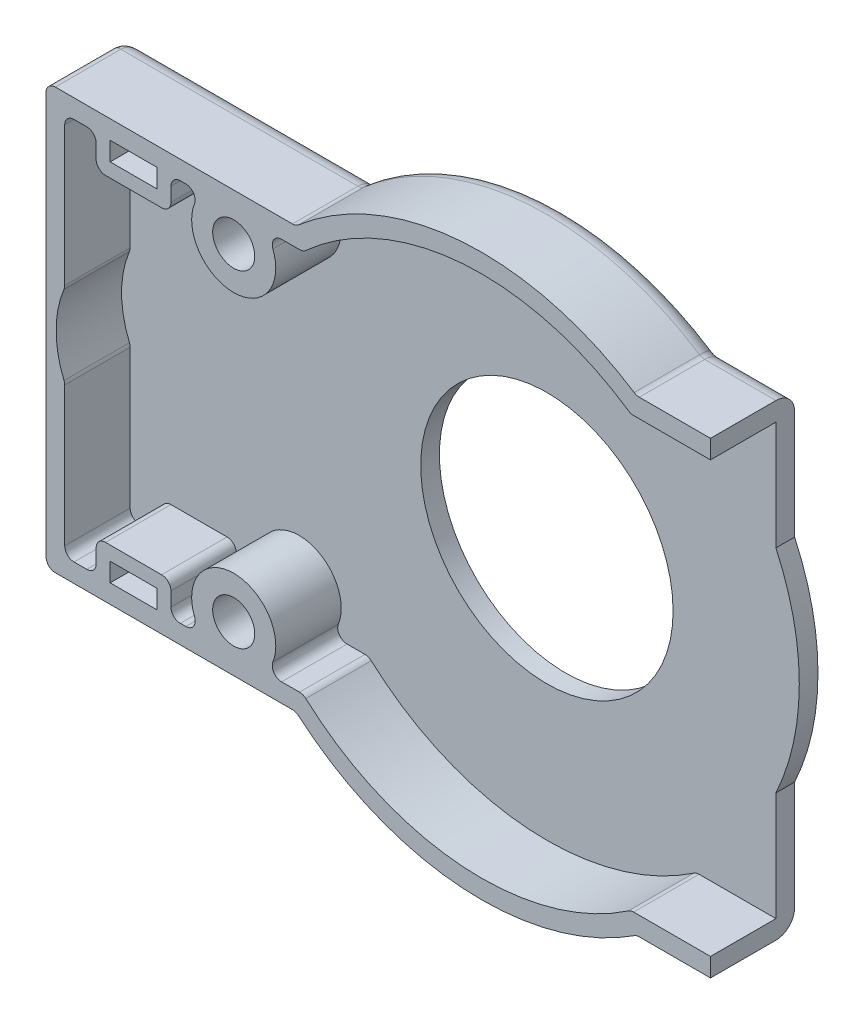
ISO-10303-21;
HEADER;
FILE_DESCRIPTION(('STEP AP214'),'2;1');
FILE_NAME('part.step','',(''),(''),'','','');
FILE_SCHEMA(('AUTOMOTIVE_DESIGN { 1 0 10303 214 1 1 1 1 }'));
ENDSEC;
DATA;
#1=APPLICATION_CONTEXT('core data for automotive mechanical design processes');
#2=APPLICATION_PROTOCOL_DEFINITION('international standard','automotive_design',2000,#1);
#3=PRODUCT_CONTEXT('',#1,'mechanical');
#4=PRODUCT('Part','Part','',(#3));
#5=PRODUCT_RELATED_PRODUCT_CATEGORY('part','',(#4));
#6=PRODUCT_DEFINITION_FORMATION('','',#4);
#7=PRODUCT_DEFINITION_CONTEXT('part definition',#1,'design');
#8=PRODUCT_DEFINITION('design','',#6,#7);
#9=PRODUCT_DEFINITION_SHAPE('','',#8);
#10=(LENGTH_UNIT() NAMED_UNIT(*) SI_UNIT(.MILLI.,.METRE.));
#11=(NAMED_UNIT(*) PLANE_ANGLE_UNIT() SI_UNIT($,.RADIAN.));
#12=(NAMED_UNIT(*) SI_UNIT($,.STERADIAN.) SOLID_ANGLE_UNIT());
#13=UNCERTAINTY_MEASURE_WITH_UNIT(LENGTH_MEASURE(1.E-05),#10,'distance_accuracy_value','');
#14=(GEOMETRIC_REPRESENTATION_CONTEXT(3) GLOBAL_UNCERTAINTY_ASSIGNED_CONTEXT((#13)) GLOBAL_UNIT_ASSIGNED_CONTEXT((#10,
#11,#12)) REPRESENTATION_CONTEXT('',''));
#15=CARTESIAN_POINT('',(0.,0.,0.));
#16=DIRECTION('',(0.,0.,1.));
#17=DIRECTION('',(1.,0.,0.));
#18=AXIS2_PLACEMENT_3D('',#15,#16,#17);
#19=CARTESIAN_POINT('',(0.,0.,2.));
#20=DIRECTION('',(0.,0.,1.));
#21=DIRECTION('',(1.,0.,0.));
#22=AXIS2_PLACEMENT_3D('',#19,#20,#21);
#23=PLANE('',#22);
#24=CARTESIAN_POINT('',(0.,0.,2.));
#25=DIRECTION('',(0.,0.,1.));
#26=DIRECTION('',(1.,0.,0.));
#27=AXIS2_PLACEMENT_3D('',#24,#25,#26);
#28=CIRCLE('',#27,13.5);
#29=CARTESIAN_POINT('',(13.5,0.,2.));
#30=VERTEX_POINT('',#29);
#31=EDGE_CURVE('E695',#30,#30,#28,.T.);
#32=ORIENTED_EDGE('',*,*,#31,.F.);
#33=EDGE_LOOP('',(#32));
#34=FACE_BOUND('',#33,.T.);
#35=DIRECTION('',(-1.,0.,0.));
#36=VECTOR('',#35,1.);
#37=CARTESIAN_POINT('',(-44.583123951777,-20.5,2.));
#38=LINE('',#37,#36);
#39=CARTESIAN_POINT('',(-42.2201749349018,-20.5,2.));
#40=VERTEX_POINT('',#39);
#41=CARTESIAN_POINT('',(-43.583123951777,-20.5,2.));
#42=VERTEX_POINT('',#41);
#43=EDGE_CURVE('E669',#40,#42,#38,.T.);
#44=ORIENTED_EDGE('',*,*,#43,.F.);
#45=CARTESIAN_POINT('',(-42.2201749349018,-19.5,2.));
#46=DIRECTION('',(0.,0.,1.));
#47=DIRECTION('',(1.,0.,0.));
#48=AXIS2_PLACEMENT_3D('',#45,#46,#47);
#49=CIRCLE('',#48,1.);
#50=CARTESIAN_POINT('',(-41.2201749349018,-19.5,2.));
#51=VERTEX_POINT('',#50);
#52=EDGE_CURVE('E766',#40,#51,#49,.T.);
#53=ORIENTED_EDGE('',*,*,#52,.T.);
#54=DIRECTION('',(0.,-1.,0.));
#55=VECTOR('',#54,1.);
#56=CARTESIAN_POINT('',(-41.2201749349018,-22.,2.));
#57=LINE('',#56,#55);
#58=CARTESIAN_POINT('',(-41.2201749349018,-18.,2.));
#59=VERTEX_POINT('',#58);
#60=EDGE_CURVE('E537',#59,#51,#57,.T.);
#61=ORIENTED_EDGE('',*,*,#60,.F.);
#62=CARTESIAN_POINT('',(-40.2201749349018,-18.,2.));
#63=DIRECTION('',(0.,0.,1.));
#64=DIRECTION('',(1.,0.,0.));
#65=AXIS2_PLACEMENT_3D('',#62,#63,#64);
#66=CIRCLE('',#65,1.);
#67=CARTESIAN_POINT('',(-40.2201749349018,-17.,2.));
#68=VERTEX_POINT('',#67);
#69=EDGE_CURVE('E916',#59,#68,#66,.F.);
#70=ORIENTED_EDGE('',*,*,#69,.T.);
#71=DIRECTION('',(-1.,0.,0.));
#72=VECTOR('',#71,1.);
#73=CARTESIAN_POINT('',(-41.2201749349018,-17.,2.));
#74=LINE('',#73,#72);
#75=CARTESIAN_POINT('',(-34.2201749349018,-17.,2.));
#76=VERTEX_POINT('',#75);
#77=EDGE_CURVE('E534',#76,#68,#74,.T.);
#78=ORIENTED_EDGE('',*,*,#77,.F.);
#79=CARTESIAN_POINT('',(-34.2201749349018,-18.,2.));
#80=DIRECTION('',(0.,0.,1.));
#81=DIRECTION('',(1.,0.,0.));
#82=AXIS2_PLACEMENT_3D('',#79,#80,#81);
#83=CIRCLE('',#82,1.);
#84=CARTESIAN_POINT('',(-33.2201749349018,-18.,2.));
#85=VERTEX_POINT('',#84);
#86=EDGE_CURVE('E912',#76,#85,#83,.F.);
#87=ORIENTED_EDGE('',*,*,#86,.T.);
#88=DIRECTION('',(0.,1.,0.));
#89=VECTOR('',#88,1.);
#90=CARTESIAN_POINT('',(-33.2201749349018,-22.,2.));
#91=LINE('',#90,#89);
#92=CARTESIAN_POINT('',(-33.2201749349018,-19.5,2.));
#93=VERTEX_POINT('',#92);
#94=EDGE_CURVE('E510',#93,#85,#91,.T.);
#95=ORIENTED_EDGE('',*,*,#94,.F.);
#96=CARTESIAN_POINT('',(-32.2201749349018,-19.5,2.));
#97=DIRECTION('',(0.,0.,1.));
#98=DIRECTION('',(1.,0.,0.));
#99=AXIS2_PLACEMENT_3D('',#96,#97,#98);
#100=CIRCLE('',#99,1.);
#101=CARTESIAN_POINT('',(-32.2201749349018,-20.5,2.));
#102=VERTEX_POINT('',#101);
#103=EDGE_CURVE('E764',#93,#102,#100,.T.);
#104=ORIENTED_EDGE('',*,*,#103,.T.);
#105=CARTESIAN_POINT('',(-31.6265993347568,-20.5,2.));
#106=VERTEX_POINT('',#105);
#107=EDGE_CURVE('E674',#106,#102,#38,.T.);
#108=ORIENTED_EDGE('',*,*,#107,.F.);
#109=CARTESIAN_POINT('',(-31.6265993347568,-19.5,2.));
#110=DIRECTION('',(0.,0.,1.));
#111=DIRECTION('',(1.,0.,0.));
#112=AXIS2_PLACEMENT_3D('',#109,#110,#111);
#113=CIRCLE('',#112,1.);
#114=CARTESIAN_POINT('',(-30.6950583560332,-19.1363636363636,2.));
#115=VERTEX_POINT('',#114);
#116=EDGE_CURVE('E756',#106,#115,#113,.T.);
#117=ORIENTED_EDGE('',*,*,#116,.T.);
#118=CARTESIAN_POINT('',(-26.503123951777,-17.5,2.));
#119=DIRECTION('',(0.,0.,1.));
#120=DIRECTION('',(1.,0.,0.));
#121=AXIS2_PLACEMENT_3D('',#118,#119,#120);
#122=CIRCLE('',#121,4.5);
#123=CARTESIAN_POINT('',(-22.3111895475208,-19.1363636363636,2.));
#124=VERTEX_POINT('',#123);
#125=EDGE_CURVE('E596',#124,#115,#122,.T.);
#126=ORIENTED_EDGE('',*,*,#125,.F.);
#127=CARTESIAN_POINT('',(-21.3796485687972,-19.5,2.));
#128=DIRECTION('',(0.,0.,1.));
#129=DIRECTION('',(1.,0.,0.));
#130=AXIS2_PLACEMENT_3D('',#127,#128,#129);
#131=CIRCLE('',#130,1.);
#132=CARTESIAN_POINT('',(-21.3796485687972,-20.5,2.));
#133=VERTEX_POINT('',#132);
#134=EDGE_CURVE('E754',#124,#133,#131,.T.);
#135=ORIENTED_EDGE('',*,*,#134,.T.);
#136=CARTESIAN_POINT('',(-19.4615004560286,-20.5,2.));
#137=VERTEX_POINT('',#136);
#138=EDGE_CURVE('E670',#137,#133,#38,.T.);
#139=ORIENTED_EDGE('',*,*,#138,.F.);
#140=CARTESIAN_POINT('',(-19.4615004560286,-21.5,2.));
#141=DIRECTION('',(0.,0.,1.));
#142=DIRECTION('',(1.,0.,0.));
#143=AXIS2_PLACEMENT_3D('',#140,#141,#142);
#144=CIRCLE('',#143,1.);
#145=CARTESIAN_POINT('',(-18.7904142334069,-20.7586206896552,2.));
#146=VERTEX_POINT('',#145);
#147=EDGE_CURVE('E942',#137,#146,#144,.F.);
#148=ORIENTED_EDGE('',*,*,#147,.T.);
#149=CARTESIAN_POINT('',(0.,0.,2.));
#150=DIRECTION('',(0.,0.,-1.));
#151=DIRECTION('',(1.,0.,0.));
#152=AXIS2_PLACEMENT_3D('',#149,#150,#151);
#153=CIRCLE('',#152,28.);
#154=CARTESIAN_POINT('',(15.7174819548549,-23.1724137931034,2.));
#155=VERTEX_POINT('',#154);
#156=EDGE_CURVE('E666',#155,#146,#153,.T.);
#157=ORIENTED_EDGE('',*,*,#156,.F.);
#158=CARTESIAN_POINT('',(16.2788205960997,-24.,2.));
#159=DIRECTION('',(0.,0.,1.));
#160=DIRECTION('',(1.,0.,0.));
#161=AXIS2_PLACEMENT_3D('',#158,#159,#160);
#162=CIRCLE('',#161,1.);
#163=CARTESIAN_POINT('',(16.2788205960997,-23.,2.));
#164=VERTEX_POINT('',#163);
#165=EDGE_CURVE('E944',#155,#164,#162,.F.);
#166=ORIENTED_EDGE('',*,*,#165,.T.);
#167=DIRECTION('',(-1.,0.,0.));
#168=VECTOR('',#167,1.);
#169=CARTESIAN_POINT('',(15.9687194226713,-23.,2.));
#170=LINE('',#169,#168);
#171=CARTESIAN_POINT('',(24.5,-23.,2.));
#172=VERTEX_POINT('',#171);
#173=EDGE_CURVE('E610',#172,#164,#170,.T.);
#174=ORIENTED_EDGE('',*,*,#173,.F.);
#175=DIRECTION('',(0.,1.,0.));
#176=VECTOR('',#175,1.);
#177=CARTESIAN_POINT('',(24.5,-25.,2.));
#178=LINE('',#177,#176);
#179=CARTESIAN_POINT('',(24.5,-11.3468057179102,2.));
#180=VERTEX_POINT('',#179);
#181=EDGE_CURVE('E704',#172,#180,#178,.T.);
#182=ORIENTED_EDGE('',*,*,#181,.T.);
#183=CARTESIAN_POINT('',(0.,0.,2.));
#184=DIRECTION('',(0.,0.,1.));
#185=DIRECTION('',(-1.,0.,0.));
#186=AXIS2_PLACEMENT_3D('',#183,#184,#185);
#187=CIRCLE('',#186,27.);
#188=CARTESIAN_POINT('',(24.5,11.3468057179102,2.));
#189=VERTEX_POINT('',#188);
#190=EDGE_CURVE('E707',#180,#189,#187,.T.);
#191=ORIENTED_EDGE('',*,*,#190,.T.);
#192=DIRECTION('',(0.,1.,0.));
#193=VECTOR('',#192,1.);
#194=CARTESIAN_POINT('',(24.5,11.3468057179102,2.));
#195=LINE('',#194,#193);
#196=CARTESIAN_POINT('',(24.5,23.,2.));
#197=VERTEX_POINT('',#196);
#198=EDGE_CURVE('E701',#189,#197,#195,.T.);
#199=ORIENTED_EDGE('',*,*,#198,.T.);
#200=DIRECTION('',(1.,0.,0.));
#201=VECTOR('',#200,1.);
#202=CARTESIAN_POINT('',(24.5,23.,2.));
#203=LINE('',#202,#201);
#204=CARTESIAN_POINT('',(16.2788205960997,23.,2.));
#205=VERTEX_POINT('',#204);
#206=EDGE_CURVE('E615',#205,#197,#203,.T.);
#207=ORIENTED_EDGE('',*,*,#206,.F.);
#208=CARTESIAN_POINT('',(16.2788205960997,24.,2.));
#209=DIRECTION('',(0.,0.,1.));
#210=DIRECTION('',(1.,0.,0.));
#211=AXIS2_PLACEMENT_3D('',#208,#209,#210);
#212=CIRCLE('',#211,1.);
#213=CARTESIAN_POINT('',(15.7174819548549,23.1724137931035,2.));
#214=VERTEX_POINT('',#213);
#215=EDGE_CURVE('E946',#205,#214,#212,.F.);
#216=ORIENTED_EDGE('',*,*,#215,.T.);
#217=CARTESIAN_POINT('',(0.,0.,2.));
#218=DIRECTION('',(0.,0.,-1.));
#219=DIRECTION('',(1.,0.,0.));
#220=AXIS2_PLACEMENT_3D('',#217,#218,#219);
#221=CIRCLE('',#220,28.);
#222=CARTESIAN_POINT('',(-18.7904142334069,20.7586206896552,2.));
#223=VERTEX_POINT('',#222);
#224=EDGE_CURVE('E683',#223,#214,#221,.T.);
#225=ORIENTED_EDGE('',*,*,#224,.F.);
#226=CARTESIAN_POINT('',(-19.4615004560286,21.5,2.));
#227=DIRECTION('',(0.,0.,1.));
#228=DIRECTION('',(1.,0.,0.));
#229=AXIS2_PLACEMENT_3D('',#226,#227,#228);
#230=CIRCLE('',#229,1.);
#231=CARTESIAN_POINT('',(-19.4615004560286,20.5,2.));
#232=VERTEX_POINT('',#231);
#233=EDGE_CURVE('E948',#223,#232,#230,.F.);
#234=ORIENTED_EDGE('',*,*,#233,.T.);
#235=DIRECTION('',(1.,0.,0.));
#236=VECTOR('',#235,1.);
#237=CARTESIAN_POINT('',(-19.0722311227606,20.5,2.));
#238=LINE('',#237,#236);
#239=CARTESIAN_POINT('',(-21.3796485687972,20.5,2.));
#240=VERTEX_POINT('',#239);
#241=EDGE_CURVE('E679',#240,#232,#238,.T.);
#242=ORIENTED_EDGE('',*,*,#241,.F.);
#243=CARTESIAN_POINT('',(-21.3796485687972,19.5,2.));
#244=DIRECTION('',(0.,0.,1.));
#245=DIRECTION('',(1.,0.,0.));
#246=AXIS2_PLACEMENT_3D('',#243,#244,#245);
#247=CIRCLE('',#246,1.);
#248=CARTESIAN_POINT('',(-22.3111895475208,19.1363636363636,2.));
#249=VERTEX_POINT('',#248);
#250=EDGE_CURVE('E752',#240,#249,#247,.T.);
#251=ORIENTED_EDGE('',*,*,#250,.T.);
#252=CARTESIAN_POINT('',(-26.503123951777,17.5,2.));
#253=DIRECTION('',(0.,0.,1.));
#254=DIRECTION('',(1.,0.,0.));
#255=AXIS2_PLACEMENT_3D('',#252,#253,#254);
#256=CIRCLE('',#255,4.5);
#257=CARTESIAN_POINT('',(-30.6950583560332,19.1363636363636,2.));
#258=VERTEX_POINT('',#257);
#259=EDGE_CURVE('E604',#258,#249,#256,.T.);
#260=ORIENTED_EDGE('',*,*,#259,.F.);
#261=CARTESIAN_POINT('',(-31.6265993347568,19.5,2.));
#262=DIRECTION('',(0.,0.,1.));
#263=DIRECTION('',(1.,0.,0.));
#264=AXIS2_PLACEMENT_3D('',#261,#262,#263);
#265=CIRCLE('',#264,1.);
#266=CARTESIAN_POINT('',(-31.6265993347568,20.5,2.));
#267=VERTEX_POINT('',#266);
#268=EDGE_CURVE('E758',#258,#267,#265,.T.);
#269=ORIENTED_EDGE('',*,*,#268,.T.);
#270=CARTESIAN_POINT('',(-32.2201749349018,20.5,2.));
#271=VERTEX_POINT('',#270);
#272=EDGE_CURVE('E685',#271,#267,#238,.T.);
#273=ORIENTED_EDGE('',*,*,#272,.F.);
#274=CARTESIAN_POINT('',(-32.2201749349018,19.5,2.));
#275=DIRECTION('',(0.,0.,1.));
#276=DIRECTION('',(1.,0.,0.));
#277=AXIS2_PLACEMENT_3D('',#274,#275,#276);
#278=CIRCLE('',#277,1.);
#279=CARTESIAN_POINT('',(-33.2201749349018,19.5,2.));
#280=VERTEX_POINT('',#279);
#281=EDGE_CURVE('E762',#271,#280,#278,.T.);
#282=ORIENTED_EDGE('',*,*,#281,.T.);
#283=DIRECTION('',(0.,1.,0.));
#284=VECTOR('',#283,1.);
#285=CARTESIAN_POINT('',(-33.2201749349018,22.,2.));
#286=LINE('',#285,#284);
#287=CARTESIAN_POINT('',(-33.2201749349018,18.,2.));
#288=VERTEX_POINT('',#287);
#289=EDGE_CURVE('E583',#288,#280,#286,.T.);
#290=ORIENTED_EDGE('',*,*,#289,.F.);
#291=CARTESIAN_POINT('',(-34.2201749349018,18.,2.));
#292=DIRECTION('',(0.,0.,1.));
#293=DIRECTION('',(1.,0.,0.));
#294=AXIS2_PLACEMENT_3D('',#291,#292,#293);
#295=CIRCLE('',#294,1.);
#296=CARTESIAN_POINT('',(-34.2201749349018,17.,2.));
#297=VERTEX_POINT('',#296);
#298=EDGE_CURVE('E920',#288,#297,#295,.F.);
#299=ORIENTED_EDGE('',*,*,#298,.T.);
#300=DIRECTION('',(1.,0.,0.));
#301=VECTOR('',#300,1.);
#302=CARTESIAN_POINT('',(-41.2201749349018,17.,2.));
#303=LINE('',#302,#301);
#304=CARTESIAN_POINT('',(-40.2201749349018,17.,2.));
#305=VERTEX_POINT('',#304);
#306=EDGE_CURVE('E580',#305,#297,#303,.T.);
#307=ORIENTED_EDGE('',*,*,#306,.F.);
#308=CARTESIAN_POINT('',(-40.2201749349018,18.,2.));
#309=DIRECTION('',(0.,0.,1.));
#310=DIRECTION('',(1.,0.,0.));
#311=AXIS2_PLACEMENT_3D('',#308,#309,#310);
#312=CIRCLE('',#311,1.);
#313=CARTESIAN_POINT('',(-41.2201749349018,18.,2.));
#314=VERTEX_POINT('',#313);
#315=EDGE_CURVE('E924',#305,#314,#312,.F.);
#316=ORIENTED_EDGE('',*,*,#315,.T.);
#317=DIRECTION('',(0.,-1.,0.));
#318=VECTOR('',#317,1.);
#319=CARTESIAN_POINT('',(-41.2201749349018,22.,2.));
#320=LINE('',#319,#318);
#321=CARTESIAN_POINT('',(-41.2201749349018,19.5,2.));
#322=VERTEX_POINT('',#321);
#323=EDGE_CURVE('E577',#322,#314,#320,.T.);
#324=ORIENTED_EDGE('',*,*,#323,.F.);
#325=CARTESIAN_POINT('',(-42.2201749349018,19.5,2.));
#326=DIRECTION('',(0.,0.,1.));
#327=DIRECTION('',(1.,0.,0.));
#328=AXIS2_PLACEMENT_3D('',#325,#326,#327);
#329=CIRCLE('',#328,1.);
#330=CARTESIAN_POINT('',(-42.2201749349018,20.5,2.));
#331=VERTEX_POINT('',#330);
#332=EDGE_CURVE('E760',#322,#331,#329,.T.);
#333=ORIENTED_EDGE('',*,*,#332,.T.);
#334=CARTESIAN_POINT('',(-43.583123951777,20.5,2.));
#335=VERTEX_POINT('',#334);
#336=EDGE_CURVE('E680',#335,#331,#238,.T.);
#337=ORIENTED_EDGE('',*,*,#336,.F.);
#338=CARTESIAN_POINT('',(-43.583123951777,19.5,2.));
#339=DIRECTION('',(0.,0.,1.));
#340=DIRECTION('',(1.,0.,0.));
#341=AXIS2_PLACEMENT_3D('',#338,#339,#340);
#342=CIRCLE('',#341,1.);
#343=CARTESIAN_POINT('',(-44.583123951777,19.5,2.));
#344=VERTEX_POINT('',#343);
#345=EDGE_CURVE('E750',#335,#344,#342,.T.);
#346=ORIENTED_EDGE('',*,*,#345,.T.);
#347=DIRECTION('',(0.,1.,0.));
#348=VECTOR('',#347,1.);
#349=CARTESIAN_POINT('',(-44.583123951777,20.5,2.));
#350=LINE('',#349,#348);
#351=CARTESIAN_POINT('',(-44.583123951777,4.60799305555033,2.));
#352=VERTEX_POINT('',#351);
#353=EDGE_CURVE('E673',#352,#344,#350,.T.);
#354=ORIENTED_EDGE('',*,*,#353,.F.);
#355=CARTESIAN_POINT('',(-45.583123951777,4.60799305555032,2.));
#356=DIRECTION('',(0.,0.,1.));
#357=DIRECTION('',(1.,0.,0.));
#358=AXIS2_PLACEMENT_3D('',#355,#356,#357);
#359=CIRCLE('',#358,1.);
#360=CARTESIAN_POINT('',(-44.6597906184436,4.22399363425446,2.));
#361=VERTEX_POINT('',#360);
#362=EDGE_CURVE('E926',#352,#361,#359,.F.);
#363=ORIENTED_EDGE('',*,*,#362,.T.);
#364=CARTESIAN_POINT('',(-34.503123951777,0.,2.));
#365=DIRECTION('',(0.,0.,1.));
#366=DIRECTION('',(1.,0.,0.));
#367=AXIS2_PLACEMENT_3D('',#364,#365,#366);
#368=CIRCLE('',#367,11.);
#369=CARTESIAN_POINT('',(-44.6597906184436,-4.22399363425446,2.));
#370=VERTEX_POINT('',#369);
#371=EDGE_CURVE('E586',#361,#370,#368,.T.);
#372=ORIENTED_EDGE('',*,*,#371,.T.);
#373=CARTESIAN_POINT('',(-45.583123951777,-4.60799305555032,2.));
#374=DIRECTION('',(0.,0.,1.));
#375=DIRECTION('',(1.,0.,0.));
#376=AXIS2_PLACEMENT_3D('',#373,#374,#375);
#377=CIRCLE('',#376,1.);
#378=CARTESIAN_POINT('',(-44.583123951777,-4.60799305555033,2.));
#379=VERTEX_POINT('',#378);
#380=EDGE_CURVE('E928',#370,#379,#377,.F.);
#381=ORIENTED_EDGE('',*,*,#380,.T.);
#382=CARTESIAN_POINT('',(-44.583123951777,-19.5,2.));
#383=VERTEX_POINT('',#382);
#384=EDGE_CURVE('E676',#383,#379,#350,.T.);
#385=ORIENTED_EDGE('',*,*,#384,.F.);
#386=CARTESIAN_POINT('',(-43.583123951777,-19.5,2.));
#387=DIRECTION('',(0.,0.,1.));
#388=DIRECTION('',(1.,0.,0.));
#389=AXIS2_PLACEMENT_3D('',#386,#387,#388);
#390=CIRCLE('',#389,1.);
#391=EDGE_CURVE('E748',#383,#42,#390,.T.);
#392=ORIENTED_EDGE('',*,*,#391,.T.);
#393=EDGE_LOOP('',(#44,#53,#61,#70,#78,#87,#95,#104,#108,#117,#126,#135,#139,#148,#157,#166,
#174,#182,#191,#199,#207,#216,#225,#234,#242,#251,#260,#269,#273,#282,#290,#299,#307,#316,#324,
#333,#337,#346,#354,#363,#372,#381,#385,#392));
#394=FACE_BOUND('',#393,.T.);
#395=ADVANCED_FACE('F37',(#34,#394),#23,.T.);
#396=CARTESIAN_POINT('',(-44.583123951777,-20.5,9.));
#397=DIRECTION('',(0.,-1.,0.));
#398=DIRECTION('',(0.,0.,-1.));
#399=AXIS2_PLACEMENT_3D('',#396,#397,#398);
#400=PLANE('',#399);
#401=ORIENTED_EDGE('',*,*,#107,.T.);
#402=DIRECTION('',(0.,0.,-1.));
#403=VECTOR('',#402,1.);
#404=CARTESIAN_POINT('',(-32.2201749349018,-20.5,9.));
#405=LINE('',#404,#403);
#406=CARTESIAN_POINT('',(-32.2201749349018,-20.5,9.));
#407=VERTEX_POINT('',#406);
#408=EDGE_CURVE('E804',#102,#407,#405,.F.);
#409=ORIENTED_EDGE('',*,*,#408,.T.);
#410=DIRECTION('',(-1.,0.,0.));
#411=VECTOR('',#410,1.);
#412=CARTESIAN_POINT('',(-44.583123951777,-20.5,9.));
#413=LINE('',#412,#411);
#414=CARTESIAN_POINT('',(-31.6265993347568,-20.5,9.));
#415=VERTEX_POINT('',#414);
#416=EDGE_CURVE('E642',#415,#407,#413,.T.);
#417=ORIENTED_EDGE('',*,*,#416,.F.);
#418=DIRECTION('',(0.,0.,1.));
#419=VECTOR('',#418,1.);
#420=CARTESIAN_POINT('',(-31.6265993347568,-20.5,2.00000000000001));
#421=LINE('',#420,#419);
#422=EDGE_CURVE('E802',#415,#106,#421,.F.);
#423=ORIENTED_EDGE('',*,*,#422,.T.);
#424=EDGE_LOOP('',(#401,#409,#417,#423));
#425=FACE_BOUND('',#424,.T.);
#426=ADVANCED_FACE('F1046',(#425),#400,.F.);
#427=CARTESIAN_POINT('',(-42.2201749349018,-20.5,9.));
#428=VERTEX_POINT('',#427);
#429=CARTESIAN_POINT('',(-43.583123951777,-20.5,9.));
#430=VERTEX_POINT('',#429);
#431=EDGE_CURVE('E637',#428,#430,#413,.T.);
#432=ORIENTED_EDGE('',*,*,#431,.F.);
#433=DIRECTION('',(0.,0.,1.));
#434=VECTOR('',#433,1.);
#435=CARTESIAN_POINT('',(-42.2201749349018,-20.5,2.));
#436=LINE('',#435,#434);
#437=EDGE_CURVE('E746',#428,#40,#436,.F.);
#438=ORIENTED_EDGE('',*,*,#437,.T.);
#439=ORIENTED_EDGE('',*,*,#43,.T.);
#440=DIRECTION('',(0.,0.,-1.));
#441=VECTOR('',#440,1.);
#442=CARTESIAN_POINT('',(-43.583123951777,-20.5,9.));
#443=LINE('',#442,#441);
#444=EDGE_CURVE('E744',#42,#430,#443,.F.);
#445=ORIENTED_EDGE('',*,*,#444,.T.);
#446=EDGE_LOOP('',(#432,#438,#439,#445));
#447=FACE_BOUND('',#446,.T.);
#448=ADVANCED_FACE('F1054',(#447),#400,.F.);
#449=CARTESIAN_POINT('',(-19.0722311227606,20.5,9.));
#450=DIRECTION('',(0.,1.,0.));
#451=DIRECTION('',(0.,0.,1.));
#452=AXIS2_PLACEMENT_3D('',#449,#450,#451);
#453=PLANE('',#452);
#454=DIRECTION('',(1.,0.,0.));
#455=VECTOR('',#454,1.);
#456=CARTESIAN_POINT('',(-19.0722311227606,20.5,9.));
#457=LINE('',#456,#455);
#458=CARTESIAN_POINT('',(-32.2201749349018,20.5,9.));
#459=VERTEX_POINT('',#458);
#460=CARTESIAN_POINT('',(-31.6265993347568,20.5,9.));
#461=VERTEX_POINT('',#460);
#462=EDGE_CURVE('E649',#459,#461,#457,.T.);
#463=ORIENTED_EDGE('',*,*,#462,.F.);
#464=DIRECTION('',(0.,0.,1.));
#465=VECTOR('',#464,1.);
#466=CARTESIAN_POINT('',(-32.2201749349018,20.5,2.));
#467=LINE('',#466,#465);
#468=EDGE_CURVE('E814',#459,#271,#467,.F.);
#469=ORIENTED_EDGE('',*,*,#468,.T.);
#470=ORIENTED_EDGE('',*,*,#272,.T.);
#471=DIRECTION('',(0.,0.,1.));
#472=VECTOR('',#471,1.);
#473=CARTESIAN_POINT('',(-31.6265993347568,20.5,9.00000000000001));
#474=LINE('',#473,#472);
#475=EDGE_CURVE('E812',#267,#461,#474,.T.);
#476=ORIENTED_EDGE('',*,*,#475,.T.);
#477=EDGE_LOOP('',(#463,#469,#470,#476));
#478=FACE_BOUND('',#477,.T.);
#479=ADVANCED_FACE('F1386',(#478),#453,.F.);
#480=ORIENTED_EDGE('',*,*,#336,.T.);
#481=DIRECTION('',(0.,0.,-1.));
#482=VECTOR('',#481,1.);
#483=CARTESIAN_POINT('',(-42.2201749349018,20.5,9.));
#484=LINE('',#483,#482);
#485=CARTESIAN_POINT('',(-42.2201749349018,20.5,9.));
#486=VERTEX_POINT('',#485);
#487=EDGE_CURVE('E829',#331,#486,#484,.F.);
#488=ORIENTED_EDGE('',*,*,#487,.T.);
#489=CARTESIAN_POINT('',(-43.583123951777,20.5,9.));
#490=VERTEX_POINT('',#489);
#491=EDGE_CURVE('E655',#490,#486,#457,.T.);
#492=ORIENTED_EDGE('',*,*,#491,.F.);
#493=DIRECTION('',(0.,0.,-1.));
#494=VECTOR('',#493,1.);
#495=CARTESIAN_POINT('',(-43.583123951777,20.5,2.));
#496=LINE('',#495,#494);
#497=EDGE_CURVE('E826',#490,#335,#496,.T.);
#498=ORIENTED_EDGE('',*,*,#497,.T.);
#499=EDGE_LOOP('',(#480,#488,#492,#498));
#500=FACE_BOUND('',#499,.T.);
#501=ADVANCED_FACE('F1064',(#500),#453,.F.);
#502=DIRECTION('',(0.,-1.,0.));
#503=VECTOR('',#502,1.);
#504=CARTESIAN_POINT('',(-39.7201749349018,-20.5,2.));
#505=LINE('',#504,#503);
#506=CARTESIAN_POINT('',(-39.7201749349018,-18.5,2.));
#507=VERTEX_POINT('',#506);
#508=CARTESIAN_POINT('',(-39.7201749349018,-20.5,2.));
#509=VERTEX_POINT('',#508);
#510=EDGE_CURVE('E523',#507,#509,#505,.T.);
#511=ORIENTED_EDGE('',*,*,#510,.T.);
#512=CARTESIAN_POINT('',(-34.7201749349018,-20.5,2.));
#513=VERTEX_POINT('',#512);
#514=EDGE_CURVE('E675',#513,#509,#38,.T.);
#515=ORIENTED_EDGE('',*,*,#514,.F.);
#516=DIRECTION('',(0.,1.,0.));
#517=VECTOR('',#516,1.);
#518=CARTESIAN_POINT('',(-34.7201749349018,-20.5,2.));
#519=LINE('',#518,#517);
#520=CARTESIAN_POINT('',(-34.7201749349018,-18.5,2.));
#521=VERTEX_POINT('',#520);
#522=EDGE_CURVE('E1766',#513,#521,#519,.T.);
#523=ORIENTED_EDGE('',*,*,#522,.T.);
#524=DIRECTION('',(-1.,0.,0.));
#525=VECTOR('',#524,1.);
#526=CARTESIAN_POINT('',(-39.7201749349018,-18.5,2.));
#527=LINE('',#526,#525);
#528=EDGE_CURVE('E1767',#521,#507,#527,.T.);
#529=ORIENTED_EDGE('',*,*,#528,.T.);
#530=EDGE_LOOP('',(#511,#515,#523,#529));
#531=FACE_BOUND('',#530,.T.);
#532=ADVANCED_FACE('F1049',(#531),#23,.T.);
#533=CARTESIAN_POINT('',(-44.583123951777,20.5,9.));
#534=DIRECTION('',(-1.,0.,0.));
#535=DIRECTION('',(0.,0.,1.));
#536=AXIS2_PLACEMENT_3D('',#533,#534,#535);
#537=PLANE('',#536);
#538=DIRECTION('',(0.,1.,0.));
#539=VECTOR('',#538,1.);
#540=CARTESIAN_POINT('',(-44.583123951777,20.5,9.));
#541=LINE('',#540,#539);
#542=CARTESIAN_POINT('',(-44.583123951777,4.60799305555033,9.));
#543=VERTEX_POINT('',#542);
#544=CARTESIAN_POINT('',(-44.583123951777,19.5,9.));
#545=VERTEX_POINT('',#544);
#546=EDGE_CURVE('E641',#543,#545,#541,.T.);
#547=ORIENTED_EDGE('',*,*,#546,.F.);
#548=DIRECTION('',(0.,0.,1.));
#549=VECTOR('',#548,1.);
#550=CARTESIAN_POINT('',(-44.583123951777,4.60799305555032,2.));
#551=LINE('',#550,#549);
#552=EDGE_CURVE('E839',#543,#352,#551,.F.);
#553=ORIENTED_EDGE('',*,*,#552,.T.);
#554=ORIENTED_EDGE('',*,*,#353,.T.);
#555=DIRECTION('',(0.,0.,-1.));
#556=VECTOR('',#555,1.);
#557=CARTESIAN_POINT('',(-44.583123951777,19.5,9.));
#558=LINE('',#557,#556);
#559=EDGE_CURVE('E837',#344,#545,#558,.F.);
#560=ORIENTED_EDGE('',*,*,#559,.T.);
#561=EDGE_LOOP('',(#547,#553,#554,#560));
#562=FACE_BOUND('',#561,.T.);
#563=ADVANCED_FACE('F1063',(#562),#537,.F.);
#564=ORIENTED_EDGE('',*,*,#384,.T.);
#565=DIRECTION('',(0.,0.,1.));
#566=VECTOR('',#565,1.);
#567=CARTESIAN_POINT('',(-44.583123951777,-4.60799305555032,9.));
#568=LINE('',#567,#566);
#569=CARTESIAN_POINT('',(-44.583123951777,-4.60799305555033,9.));
#570=VERTEX_POINT('',#569);
#571=EDGE_CURVE('E844',#379,#570,#568,.T.);
#572=ORIENTED_EDGE('',*,*,#571,.T.);
#573=CARTESIAN_POINT('',(-44.583123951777,-19.5,9.));
#574=VERTEX_POINT('',#573);
#575=EDGE_CURVE('E645',#574,#570,#541,.T.);
#576=ORIENTED_EDGE('',*,*,#575,.F.);
#577=DIRECTION('',(0.,0.,-1.));
#578=VECTOR('',#577,1.);
#579=CARTESIAN_POINT('',(-44.583123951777,-19.5,2.));
#580=LINE('',#579,#578);
#581=EDGE_CURVE('E841',#574,#383,#580,.T.);
#582=ORIENTED_EDGE('',*,*,#581,.T.);
#583=EDGE_LOOP('',(#564,#572,#576,#582));
#584=FACE_BOUND('',#583,.T.);
#585=ADVANCED_FACE('F1327',(#584),#537,.F.);
#586=ORIENTED_EDGE('',*,*,#514,.T.);
#587=DIRECTION('',(0.,0.,-1.));
#588=VECTOR('',#587,1.);
#589=CARTESIAN_POINT('',(-39.7201749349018,-20.5,18.4339811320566));
#590=LINE('',#589,#588);
#591=CARTESIAN_POINT('',(-39.7201749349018,-20.5,9.));
#592=VERTEX_POINT('',#591);
#593=EDGE_CURVE('E525',#592,#509,#590,.T.);
#594=ORIENTED_EDGE('',*,*,#593,.F.);
#595=CARTESIAN_POINT('',(-34.7201749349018,-20.5,9.));
#596=VERTEX_POINT('',#595);
#597=EDGE_CURVE('E505',#596,#592,#413,.T.);
#598=ORIENTED_EDGE('',*,*,#597,.F.);
#599=DIRECTION('',(0.,0.,-1.));
#600=VECTOR('',#599,1.);
#601=CARTESIAN_POINT('',(-34.7201749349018,-20.5,18.4339811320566));
#602=LINE('',#601,#600);
#603=EDGE_CURVE('E527',#596,#513,#602,.T.);
#604=ORIENTED_EDGE('',*,*,#603,.T.);
#605=EDGE_LOOP('',(#586,#594,#598,#604));
#606=FACE_BOUND('',#605,.T.);
#607=ADVANCED_FACE('F1057',(#606),#400,.F.);
#608=ORIENTED_EDGE('',*,*,#138,.T.);
#609=DIRECTION('',(0.,0.,1.));
#610=VECTOR('',#609,1.);
#611=CARTESIAN_POINT('',(-21.3796485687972,-20.5,9.00000000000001));
#612=LINE('',#611,#610);
#613=CARTESIAN_POINT('',(-21.3796485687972,-20.5,9.));
#614=VERTEX_POINT('',#613);
#615=EDGE_CURVE('E861',#133,#614,#612,.T.);
#616=ORIENTED_EDGE('',*,*,#615,.T.);
#617=CARTESIAN_POINT('',(-19.4615004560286,-20.5,9.));
#618=VERTEX_POINT('',#617);
#619=EDGE_CURVE('E638',#618,#614,#413,.T.);
#620=ORIENTED_EDGE('',*,*,#619,.F.);
#621=DIRECTION('',(0.,0.,-1.));
#622=VECTOR('',#621,1.);
#623=CARTESIAN_POINT('',(-19.4615004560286,-20.5,9.));
#624=LINE('',#623,#622);
#625=EDGE_CURVE('E858',#618,#137,#624,.T.);
#626=ORIENTED_EDGE('',*,*,#625,.T.);
#627=EDGE_LOOP('',(#608,#616,#620,#626));
#628=FACE_BOUND('',#627,.T.);
#629=ADVANCED_FACE('F1292',(#628),#400,.F.);
#630=CARTESIAN_POINT('',(-21.3796485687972,20.5,9.));
#631=VERTEX_POINT('',#630);
#632=CARTESIAN_POINT('',(-19.4615004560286,20.5,9.));
#633=VERTEX_POINT('',#632);
#634=EDGE_CURVE('E646',#631,#633,#457,.T.);
#635=ORIENTED_EDGE('',*,*,#634,.F.);
#636=DIRECTION('',(0.,0.,1.));
#637=VECTOR('',#636,1.);
#638=CARTESIAN_POINT('',(-21.3796485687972,20.5,2.00000000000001));
#639=LINE('',#638,#637);
#640=EDGE_CURVE('E865',#631,#240,#639,.F.);
#641=ORIENTED_EDGE('',*,*,#640,.T.);
#642=ORIENTED_EDGE('',*,*,#241,.T.);
#643=DIRECTION('',(0.,0.,-1.));
#644=VECTOR('',#643,1.);
#645=CARTESIAN_POINT('',(-19.4615004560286,20.5,9.));
#646=LINE('',#645,#644);
#647=EDGE_CURVE('E863',#232,#633,#646,.F.);
#648=ORIENTED_EDGE('',*,*,#647,.T.);
#649=EDGE_LOOP('',(#635,#641,#642,#648));
#650=FACE_BOUND('',#649,.T.);
#651=ADVANCED_FACE('F1076',(#650),#453,.F.);
#652=CARTESIAN_POINT('',(-39.7201749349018,20.5,2.));
#653=VERTEX_POINT('',#652);
#654=CARTESIAN_POINT('',(-34.7201749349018,20.5,2.));
#655=VERTEX_POINT('',#654);
#656=EDGE_CURVE('E684',#653,#655,#238,.T.);
#657=ORIENTED_EDGE('',*,*,#656,.T.);
#658=DIRECTION('',(0.,0.,-1.));
#659=VECTOR('',#658,1.);
#660=CARTESIAN_POINT('',(-34.7201749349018,20.5,18.4339811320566));
#661=LINE('',#660,#659);
#662=CARTESIAN_POINT('',(-34.7201749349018,20.5,9.));
#663=VERTEX_POINT('',#662);
#664=EDGE_CURVE('E568',#663,#655,#661,.T.);
#665=ORIENTED_EDGE('',*,*,#664,.F.);
#666=CARTESIAN_POINT('',(-39.7201749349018,20.5,9.));
#667=VERTEX_POINT('',#666);
#668=EDGE_CURVE('E650',#667,#663,#457,.T.);
#669=ORIENTED_EDGE('',*,*,#668,.F.);
#670=DIRECTION('',(0.,0.,-1.));
#671=VECTOR('',#670,1.);
#672=CARTESIAN_POINT('',(-39.7201749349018,20.5,18.4339811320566));
#673=LINE('',#672,#671);
#674=EDGE_CURVE('E565',#667,#653,#673,.T.);
#675=ORIENTED_EDGE('',*,*,#674,.T.);
#676=EDGE_LOOP('',(#657,#665,#669,#675));
#677=FACE_BOUND('',#676,.T.);
#678=ADVANCED_FACE('F1068',(#677),#453,.F.);
#679=DIRECTION('',(0.,1.,0.));
#680=VECTOR('',#679,1.);
#681=CARTESIAN_POINT('',(-34.7201749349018,20.5,2.));
#682=LINE('',#681,#680);
#683=CARTESIAN_POINT('',(-34.7201749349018,18.5,2.));
#684=VERTEX_POINT('',#683);
#685=EDGE_CURVE('E563',#684,#655,#682,.T.);
#686=ORIENTED_EDGE('',*,*,#685,.T.);
#687=ORIENTED_EDGE('',*,*,#656,.F.);
#688=DIRECTION('',(0.,-1.,0.));
#689=VECTOR('',#688,1.);
#690=CARTESIAN_POINT('',(-39.7201749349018,20.5,2.));
#691=LINE('',#690,#689);
#692=CARTESIAN_POINT('',(-39.7201749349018,18.5,2.));
#693=VERTEX_POINT('',#692);
#694=EDGE_CURVE('E559',#653,#693,#691,.T.);
#695=ORIENTED_EDGE('',*,*,#694,.T.);
#696=DIRECTION('',(1.,0.,0.));
#697=VECTOR('',#696,1.);
#698=CARTESIAN_POINT('',(-39.7201749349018,18.5,2.));
#699=LINE('',#698,#697);
#700=EDGE_CURVE('E561',#693,#684,#699,.T.);
#701=ORIENTED_EDGE('',*,*,#700,.T.);
#702=EDGE_LOOP('',(#686,#687,#695,#701));
#703=FACE_BOUND('',#702,.T.);
#704=ADVANCED_FACE('F1050',(#703),#23,.T.);
#705=CARTESIAN_POINT('',(0.,0.,0.));
#706=DIRECTION('',(0.,0.,1.));
#707=DIRECTION('',(1.,0.,0.));
#708=AXIS2_PLACEMENT_3D('',#705,#706,#707);
#709=PLANE('',#708);
#710=DIRECTION('',(0.,1.,0.));
#711=VECTOR('',#710,1.);
#712=CARTESIAN_POINT('',(24.5,-25.,0.));
#713=LINE('',#712,#711);
#714=CARTESIAN_POINT('',(24.5,-23.,0.));
#715=VERTEX_POINT('',#714);
#716=CARTESIAN_POINT('',(24.5,-11.3468057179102,0.));
#717=VERTEX_POINT('',#716);
#718=EDGE_CURVE('E712',#715,#717,#713,.T.);
#719=ORIENTED_EDGE('',*,*,#718,.F.);
#720=DIRECTION('',(1.,0.,0.));
#721=VECTOR('',#720,1.);
#722=CARTESIAN_POINT('',(0.,-23.,0.));
#723=LINE('',#722,#721);
#724=CARTESIAN_POINT('',(16.8819430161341,-23.,0.));
#725=VERTEX_POINT('',#724);
#726=EDGE_CURVE('E985',#715,#725,#723,.F.);
#727=ORIENTED_EDGE('',*,*,#726,.T.);
#728=CARTESIAN_POINT('',(16.8819430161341,-26.,0.));
#729=DIRECTION('',(0.,0.,1.));
#730=DIRECTION('',(1.,0.,0.));
#731=AXIS2_PLACEMENT_3D('',#728,#729,#730);
#732=CIRCLE('',#731,3.);
#733=CARTESIAN_POINT('',(15.2482065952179,-23.4838709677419,0.));
#734=VERTEX_POINT('',#733);
#735=EDGE_CURVE('E983',#725,#734,#732,.T.);
#736=ORIENTED_EDGE('',*,*,#735,.T.);
#737=CARTESIAN_POINT('',(0.,0.,0.));
#738=DIRECTION('',(0.,0.,1.));
#739=DIRECTION('',(1.,0.,0.));
#740=AXIS2_PLACEMENT_3D('',#737,#738,#739);
#741=CIRCLE('',#740,28.);
#742=CARTESIAN_POINT('',(-18.2610279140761,-21.2258064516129,0.));
#743=VERTEX_POINT('',#742);
#744=EDGE_CURVE('E981',#734,#743,#741,.F.);
#745=ORIENTED_EDGE('',*,*,#744,.T.);
#746=CARTESIAN_POINT('',(-20.2175666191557,-23.5,0.));
#747=DIRECTION('',(0.,0.,1.));
#748=DIRECTION('',(1.,0.,0.));
#749=AXIS2_PLACEMENT_3D('',#746,#747,#748);
#750=CIRCLE('',#749,3.);
#751=CARTESIAN_POINT('',(-20.2175666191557,-20.5,0.));
#752=VERTEX_POINT('',#751);
#753=EDGE_CURVE('E979',#743,#752,#750,.T.);
#754=ORIENTED_EDGE('',*,*,#753,.T.);
#755=DIRECTION('',(1.,0.,0.));
#756=VECTOR('',#755,1.);
#757=CARTESIAN_POINT('',(0.,-20.5,0.));
#758=LINE('',#757,#756);
#759=CARTESIAN_POINT('',(-22.8203939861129,-20.5,0.));
#760=VERTEX_POINT('',#759);
#761=EDGE_CURVE('E977',#752,#760,#758,.F.);
#762=ORIENTED_EDGE('',*,*,#761,.T.);
#763=CARTESIAN_POINT('',(-26.503123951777,-17.5,0.));
#764=DIRECTION('',(0.,0.,1.));
#765=DIRECTION('',(1.,0.,0.));
#766=AXIS2_PLACEMENT_3D('',#763,#764,#765);
#767=CIRCLE('',#766,4.75000000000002);
#768=CARTESIAN_POINT('',(-30.1858539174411,-20.5,0.));
#769=VERTEX_POINT('',#768);
#770=EDGE_CURVE('E729',#760,#769,#767,.T.);
#771=ORIENTED_EDGE('',*,*,#770,.T.);
#772=DIRECTION('',(1.,0.,0.));
#773=VECTOR('',#772,1.);
#774=CARTESIAN_POINT('',(0.,-20.5,0.));
#775=LINE('',#774,#773);
#776=CARTESIAN_POINT('',(-44.583123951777,-20.5,0.));
#777=VERTEX_POINT('',#776);
#778=EDGE_CURVE('E975',#769,#777,#775,.F.);
#779=ORIENTED_EDGE('',*,*,#778,.T.);
#780=DIRECTION('',(0.,-1.,0.));
#781=VECTOR('',#780,1.);
#782=CARTESIAN_POINT('',(-44.583123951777,0.,0.));
#783=LINE('',#782,#781);
#784=CARTESIAN_POINT('',(-44.583123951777,20.5,0.));
#785=VERTEX_POINT('',#784);
#786=EDGE_CURVE('E973',#777,#785,#783,.F.);
#787=ORIENTED_EDGE('',*,*,#786,.T.);
#788=DIRECTION('',(-1.,0.,0.));
#789=VECTOR('',#788,1.);
#790=CARTESIAN_POINT('',(0.,20.5,0.));
#791=LINE('',#790,#789);
#792=CARTESIAN_POINT('',(-30.1858539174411,20.5,0.));
#793=VERTEX_POINT('',#792);
#794=EDGE_CURVE('E971',#785,#793,#791,.F.);
#795=ORIENTED_EDGE('',*,*,#794,.T.);
#796=CARTESIAN_POINT('',(-26.503123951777,17.5,0.));
#797=DIRECTION('',(0.,0.,1.));
#798=DIRECTION('',(1.,0.,0.));
#799=AXIS2_PLACEMENT_3D('',#796,#797,#798);
#800=CIRCLE('',#799,4.75000000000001);
#801=CARTESIAN_POINT('',(-22.8203939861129,20.5,0.));
#802=VERTEX_POINT('',#801);
#803=EDGE_CURVE('E726',#793,#802,#800,.T.);
#804=ORIENTED_EDGE('',*,*,#803,.T.);
#805=DIRECTION('',(-1.,0.,0.));
#806=VECTOR('',#805,1.);
#807=CARTESIAN_POINT('',(0.,20.5,0.));
#808=LINE('',#807,#806);
#809=CARTESIAN_POINT('',(-20.2175666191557,20.5,0.));
#810=VERTEX_POINT('',#809);
#811=EDGE_CURVE('E965',#802,#810,#808,.F.);
#812=ORIENTED_EDGE('',*,*,#811,.T.);
#813=CARTESIAN_POINT('',(-20.2175666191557,23.5,0.));
#814=DIRECTION('',(0.,0.,1.));
#815=DIRECTION('',(1.,0.,0.));
#816=AXIS2_PLACEMENT_3D('',#813,#814,#815);
#817=CIRCLE('',#816,3.);
#818=CARTESIAN_POINT('',(-18.2610279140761,21.2258064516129,0.));
#819=VERTEX_POINT('',#818);
#820=EDGE_CURVE('E963',#810,#819,#817,.T.);
#821=ORIENTED_EDGE('',*,*,#820,.T.);
#822=CARTESIAN_POINT('',(0.,0.,0.));
#823=DIRECTION('',(0.,0.,1.));
#824=DIRECTION('',(1.,0.,0.));
#825=AXIS2_PLACEMENT_3D('',#822,#823,#824);
#826=CIRCLE('',#825,28.);
#827=CARTESIAN_POINT('',(15.2482065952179,23.4838709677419,0.));
#828=VERTEX_POINT('',#827);
#829=EDGE_CURVE('E961',#819,#828,#826,.F.);
#830=ORIENTED_EDGE('',*,*,#829,.T.);
#831=CARTESIAN_POINT('',(16.8819430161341,26.,0.));
#832=DIRECTION('',(0.,0.,1.));
#833=DIRECTION('',(1.,0.,0.));
#834=AXIS2_PLACEMENT_3D('',#831,#832,#833);
#835=CIRCLE('',#834,3.);
#836=CARTESIAN_POINT('',(16.8819430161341,23.,0.));
#837=VERTEX_POINT('',#836);
#838=EDGE_CURVE('E967',#828,#837,#835,.T.);
#839=ORIENTED_EDGE('',*,*,#838,.T.);
#840=DIRECTION('',(-1.,0.,0.));
#841=VECTOR('',#840,1.);
#842=CARTESIAN_POINT('',(0.,23.,0.));
#843=LINE('',#842,#841);
#844=CARTESIAN_POINT('',(24.5,23.,0.));
#845=VERTEX_POINT('',#844);
#846=EDGE_CURVE('E969',#837,#845,#843,.F.);
#847=ORIENTED_EDGE('',*,*,#846,.T.);
#848=DIRECTION('',(0.,1.,0.));
#849=VECTOR('',#848,1.);
#850=CARTESIAN_POINT('',(24.5,11.3468057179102,0.));
#851=LINE('',#850,#849);
#852=CARTESIAN_POINT('',(24.5,11.3468057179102,0.));
#853=VERTEX_POINT('',#852);
#854=EDGE_CURVE('E698',#853,#845,#851,.T.);
#855=ORIENTED_EDGE('',*,*,#854,.F.);
#856=CARTESIAN_POINT('',(0.,0.,0.));
#857=DIRECTION('',(0.,0.,1.));
#858=DIRECTION('',(-1.,0.,0.));
#859=AXIS2_PLACEMENT_3D('',#856,#857,#858);
#860=CIRCLE('',#859,27.);
#861=EDGE_CURVE('E705',#717,#853,#860,.T.);
#862=ORIENTED_EDGE('',*,*,#861,.F.);
#863=EDGE_LOOP('',(#719,#727,#736,#745,#754,#762,#771,#779,#787,#795,#804,#812,#821,#830,#839,
#847,#855,#862));
#864=FACE_BOUND('',#863,.T.);
#865=CARTESIAN_POINT('',(0.,0.,0.));
#866=DIRECTION('',(0.,0.,1.));
#867=DIRECTION('',(1.,0.,0.));
#868=AXIS2_PLACEMENT_3D('',#865,#866,#867);
#869=CIRCLE('',#868,13.5);
#870=CARTESIAN_POINT('',(13.5,0.,0.));
#871=VERTEX_POINT('',#870);
#872=EDGE_CURVE('E694',#871,#871,#869,.T.);
#873=ORIENTED_EDGE('',*,*,#872,.T.);
#874=EDGE_LOOP('',(#873));
#875=FACE_BOUND('',#874,.T.);
#876=ADVANCED_FACE('F1067',(#864,#875),#709,.F.);
#877=CARTESIAN_POINT('',(24.5,11.3468057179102,2.));
#878=DIRECTION('',(-1.,0.,0.));
#879=DIRECTION('',(0.,-1.,0.));
#880=AXIS2_PLACEMENT_3D('',#877,#878,#879);
#881=PLANE('',#880);
#882=ORIENTED_EDGE('',*,*,#854,.T.);
#883=CARTESIAN_POINT('',(24.5,23.,2.));
#884=DIRECTION('',(-1.,0.,0.));
#885=DIRECTION('',(0.,-1.,0.));
#886=AXIS2_PLACEMENT_3D('',#883,#884,#885);
#887=CIRCLE('',#886,2.);
#888=CARTESIAN_POINT('',(24.5,25.,2.));
#889=VERTEX_POINT('',#888);
#890=EDGE_CURVE('E987',#845,#889,#887,.F.);
#891=ORIENTED_EDGE('',*,*,#890,.T.);
#892=DIRECTION('',(0.,0.,-1.));
#893=VECTOR('',#892,1.);
#894=CARTESIAN_POINT('',(24.5,25.,2.));
#895=LINE('',#894,#893);
#896=CARTESIAN_POINT('',(24.5,25.,9.));
#897=VERTEX_POINT('',#896);
#898=EDGE_CURVE('E723',#897,#889,#895,.T.);
#899=ORIENTED_EDGE('',*,*,#898,.F.);
#900=DIRECTION('',(0.,1.,0.));
#901=VECTOR('',#900,1.);
#902=CARTESIAN_POINT('',(24.5,23.,9.));
#903=LINE('',#902,#901);
#904=CARTESIAN_POINT('',(24.5,23.,9.));
#905=VERTEX_POINT('',#904);
#906=EDGE_CURVE('E657',#905,#897,#903,.T.);
#907=ORIENTED_EDGE('',*,*,#906,.F.);
#908=DIRECTION('',(0.,0.,-1.));
#909=VECTOR('',#908,1.);
#910=CARTESIAN_POINT('',(24.5,23.,9.));
#911=LINE('',#910,#909);
#912=EDGE_CURVE('E663',#905,#197,#911,.T.);
#913=ORIENTED_EDGE('',*,*,#912,.T.);
#914=ORIENTED_EDGE('',*,*,#198,.F.);
#915=DIRECTION('',(0.,0.,-1.));
#916=VECTOR('',#915,1.);
#917=CARTESIAN_POINT('',(24.5,11.3468057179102,2.));
#918=LINE('',#917,#916);
#919=EDGE_CURVE('E709',#189,#853,#918,.T.);
#920=ORIENTED_EDGE('',*,*,#919,.T.);
#921=EDGE_LOOP('',(#882,#891,#899,#907,#913,#914,#920));
#922=FACE_BOUND('',#921,.T.);
#923=ADVANCED_FACE('F1074',(#922),#881,.F.);
#924=CARTESIAN_POINT('',(24.5,25.,2.));
#925=DIRECTION('',(0.,-1.,0.));
#926=DIRECTION('',(1.,0.,0.));
#927=AXIS2_PLACEMENT_3D('',#924,#925,#926);
#928=PLANE('',#927);
#929=ORIENTED_EDGE('',*,*,#898,.T.);
#930=DIRECTION('',(-1.,0.,0.));
#931=VECTOR('',#930,1.);
#932=CARTESIAN_POINT('',(24.5,25.,2.));
#933=LINE('',#932,#931);
#934=CARTESIAN_POINT('',(16.8819430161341,25.,2.));
#935=VERTEX_POINT('',#934);
#936=EDGE_CURVE('E958',#889,#935,#933,.T.);
#937=ORIENTED_EDGE('',*,*,#936,.T.);
#938=DIRECTION('',(0.,0.,1.));
#939=VECTOR('',#938,1.);
#940=CARTESIAN_POINT('',(16.8819430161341,25.,9.));
#941=LINE('',#940,#939);
#942=CARTESIAN_POINT('',(16.8819430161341,25.,9.));
#943=VERTEX_POINT('',#942);
#944=EDGE_CURVE('E908',#935,#943,#941,.T.);
#945=ORIENTED_EDGE('',*,*,#944,.T.);
#946=DIRECTION('',(-1.,0.,0.));
#947=VECTOR('',#946,1.);
#948=CARTESIAN_POINT('',(24.5,25.,9.));
#949=LINE('',#948,#947);
#950=EDGE_CURVE('E660',#897,#943,#949,.T.);
#951=ORIENTED_EDGE('',*,*,#950,.F.);
#952=EDGE_LOOP('',(#929,#937,#945,#951));
#953=FACE_BOUND('',#952,.T.);
#954=ADVANCED_FACE('F1144',(#953),#928,.F.);
#955=CARTESIAN_POINT('',(0.,0.,2.));
#956=DIRECTION('',(0.,0.,-1.));
#957=DIRECTION('',(-1.,0.,0.));
#958=AXIS2_PLACEMENT_3D('',#955,#956,#957);
#959=CYLINDRICAL_SURFACE('',#958,30.);
#960=DIRECTION('',(0.,0.,-1.));
#961=VECTOR('',#960,1.);
#962=CARTESIAN_POINT('',(16.3373642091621,25.1612903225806,2.));
#963=LINE('',#962,#961);
#964=CARTESIAN_POINT('',(16.3373642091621,25.1612903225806,9.));
#965=VERTEX_POINT('',#964);
#966=CARTESIAN_POINT('',(16.3373642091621,25.1612903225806,2.));
#967=VERTEX_POINT('',#966);
#968=EDGE_CURVE('E906',#965,#967,#963,.T.);
#969=ORIENTED_EDGE('',*,*,#968,.T.);
#970=CARTESIAN_POINT('',(0.,0.,2.));
#971=DIRECTION('',(0.,0.,1.));
#972=DIRECTION('',(1.,0.,0.));
#973=AXIS2_PLACEMENT_3D('',#970,#971,#972);
#974=CIRCLE('',#973,30.);
#975=CARTESIAN_POINT('',(-19.5653870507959,22.741935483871,2.));
#976=VERTEX_POINT('',#975);
#977=EDGE_CURVE('E11',#967,#976,#974,.T.);
#978=ORIENTED_EDGE('',*,*,#977,.T.);
#979=DIRECTION('',(0.,0.,-1.));
#980=VECTOR('',#979,1.);
#981=CARTESIAN_POINT('',(-19.5653870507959,22.741935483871,2.));
#982=LINE('',#981,#980);
#983=CARTESIAN_POINT('',(-19.5653870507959,22.741935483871,9.));
#984=VERTEX_POINT('',#983);
#985=EDGE_CURVE('E904',#976,#984,#982,.F.);
#986=ORIENTED_EDGE('',*,*,#985,.T.);
#987=CARTESIAN_POINT('',(0.,0.,9.));
#988=DIRECTION('',(0.,0.,1.));
#989=DIRECTION('',(1.,0.,0.));
#990=AXIS2_PLACEMENT_3D('',#987,#988,#989);
#991=CIRCLE('',#990,30.);
#992=EDGE_CURVE('E611',#965,#984,#991,.T.);
#993=ORIENTED_EDGE('',*,*,#992,.F.);
#994=EDGE_LOOP('',(#969,#978,#986,#993));
#995=FACE_BOUND('',#994,.T.);
#996=ADVANCED_FACE('F1153',(#995),#959,.T.);
#997=CARTESIAN_POINT('',(-19.8431348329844,22.5,2.));
#998=DIRECTION('',(0.,-1.,0.));
#999=DIRECTION('',(0.,0.,-1.));
#1000=AXIS2_PLACEMENT_3D('',#997,#998,#999);
#1001=PLANE('',#1000);
#1002=DIRECTION('',(0.,0.,1.));
#1003=VECTOR('',#1002,1.);
#1004=CARTESIAN_POINT('',(-20.2175666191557,22.5,0.));
#1005=LINE('',#1004,#1003);
#1006=CARTESIAN_POINT('',(-20.2175666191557,22.5,9.));
#1007=VERTEX_POINT('',#1006);
#1008=CARTESIAN_POINT('',(-20.2175666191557,22.5,2.));
#1009=VERTEX_POINT('',#1008);
#1010=EDGE_CURVE('E892',#1007,#1009,#1005,.F.);
#1011=ORIENTED_EDGE('',*,*,#1010,.T.);
#1012=DIRECTION('',(-1.,0.,0.));
#1013=VECTOR('',#1012,1.);
#1014=CARTESIAN_POINT('',(-19.8431348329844,22.5,2.));
#1015=LINE('',#1014,#1013);
#1016=CARTESIAN_POINT('',(-45.583123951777,22.5,2.));
#1017=VERTEX_POINT('',#1016);
#1018=EDGE_CURVE('E1706',#1009,#1017,#1015,.T.);
#1019=ORIENTED_EDGE('',*,*,#1018,.T.);
#1020=DIRECTION('',(0.,0.,-1.));
#1021=VECTOR('',#1020,1.);
#1022=CARTESIAN_POINT('',(-45.583123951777,22.5,2.));
#1023=LINE('',#1022,#1021);
#1024=CARTESIAN_POINT('',(-45.583123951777,22.5,9.));
#1025=VERTEX_POINT('',#1024);
#1026=EDGE_CURVE('E894',#1017,#1025,#1023,.F.);
#1027=ORIENTED_EDGE('',*,*,#1026,.T.);
#1028=DIRECTION('',(-1.,0.,0.));
#1029=VECTOR('',#1028,1.);
#1030=CARTESIAN_POINT('',(-19.8431348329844,22.5,9.));
#1031=LINE('',#1030,#1029);
#1032=EDGE_CURVE('E614',#1007,#1025,#1031,.T.);
#1033=ORIENTED_EDGE('',*,*,#1032,.F.);
#1034=EDGE_LOOP('',(#1011,#1019,#1027,#1033));
#1035=FACE_BOUND('',#1034,.T.);
#1036=ADVANCED_FACE('F1431',(#1035),#1001,.F.);
#1037=CARTESIAN_POINT('',(-46.583123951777,22.5,2.));
#1038=DIRECTION('',(1.,0.,0.));
#1039=DIRECTION('',(0.,0.,-1.));
#1040=AXIS2_PLACEMENT_3D('',#1037,#1038,#1039);
#1041=PLANE('',#1040);
#1042=DIRECTION('',(0.,0.,-1.));
#1043=VECTOR('',#1042,1.);
#1044=CARTESIAN_POINT('',(-46.583123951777,21.5,2.));
#1045=LINE('',#1044,#1043);
#1046=CARTESIAN_POINT('',(-46.583123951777,21.5,9.));
#1047=VERTEX_POINT('',#1046);
#1048=CARTESIAN_POINT('',(-46.583123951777,21.5,2.));
#1049=VERTEX_POINT('',#1048);
#1050=EDGE_CURVE('E887',#1047,#1049,#1045,.T.);
#1051=ORIENTED_EDGE('',*,*,#1050,.T.);
#1052=DIRECTION('',(0.,-1.,0.));
#1053=VECTOR('',#1052,1.);
#1054=CARTESIAN_POINT('',(-46.583123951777,22.5,2.));
#1055=LINE('',#1054,#1053);
#1056=CARTESIAN_POINT('',(-46.583123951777,-21.5,2.));
#1057=VERTEX_POINT('',#1056);
#1058=EDGE_CURVE('E1211',#1049,#1057,#1055,.T.);
#1059=ORIENTED_EDGE('',*,*,#1058,.T.);
#1060=DIRECTION('',(0.,0.,-1.));
#1061=VECTOR('',#1060,1.);
#1062=CARTESIAN_POINT('',(-46.583123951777,-21.5,2.));
#1063=LINE('',#1062,#1061);
#1064=CARTESIAN_POINT('',(-46.583123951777,-21.5,9.));
#1065=VERTEX_POINT('',#1064);
#1066=EDGE_CURVE('E890',#1057,#1065,#1063,.F.);
#1067=ORIENTED_EDGE('',*,*,#1066,.T.);
#1068=DIRECTION('',(0.,-1.,0.));
#1069=VECTOR('',#1068,1.);
#1070=CARTESIAN_POINT('',(-46.583123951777,22.5,9.));
#1071=LINE('',#1070,#1069);
#1072=EDGE_CURVE('E618',#1047,#1065,#1071,.T.);
#1073=ORIENTED_EDGE('',*,*,#1072,.F.);
#1074=EDGE_LOOP('',(#1051,#1059,#1067,#1073));
#1075=FACE_BOUND('',#1074,.T.);
#1076=ADVANCED_FACE('F1427',(#1075),#1041,.F.);
#1077=CARTESIAN_POINT('',(-46.583123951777,-22.5,2.));
#1078=DIRECTION('',(0.,1.,0.));
#1079=DIRECTION('',(0.,0.,1.));
#1080=AXIS2_PLACEMENT_3D('',#1077,#1078,#1079);
#1081=PLANE('',#1080);
#1082=DIRECTION('',(0.,0.,-1.));
#1083=VECTOR('',#1082,1.);
#1084=CARTESIAN_POINT('',(-45.583123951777,-22.5,2.));
#1085=LINE('',#1084,#1083);
#1086=CARTESIAN_POINT('',(-45.583123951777,-22.5,9.));
#1087=VERTEX_POINT('',#1086);
#1088=CARTESIAN_POINT('',(-45.583123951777,-22.5,2.));
#1089=VERTEX_POINT('',#1088);
#1090=EDGE_CURVE('E884',#1087,#1089,#1085,.T.);
#1091=ORIENTED_EDGE('',*,*,#1090,.T.);
#1092=DIRECTION('',(1.,0.,0.));
#1093=VECTOR('',#1092,1.);
#1094=CARTESIAN_POINT('',(-46.583123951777,-22.5,2.));
#1095=LINE('',#1094,#1093);
#1096=CARTESIAN_POINT('',(-20.2175666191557,-22.5,2.));
#1097=VERTEX_POINT('',#1096);
#1098=EDGE_CURVE('E1001',#1089,#1097,#1095,.T.);
#1099=ORIENTED_EDGE('',*,*,#1098,.T.);
#1100=DIRECTION('',(0.,0.,1.));
#1101=VECTOR('',#1100,1.);
#1102=CARTESIAN_POINT('',(-20.2175666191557,-22.5,9.));
#1103=LINE('',#1102,#1101);
#1104=CARTESIAN_POINT('',(-20.2175666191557,-22.5,9.));
#1105=VERTEX_POINT('',#1104);
#1106=EDGE_CURVE('E882',#1097,#1105,#1103,.T.);
#1107=ORIENTED_EDGE('',*,*,#1106,.T.);
#1108=DIRECTION('',(1.,0.,0.));
#1109=VECTOR('',#1108,1.);
#1110=CARTESIAN_POINT('',(-46.583123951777,-22.5,9.));
#1111=LINE('',#1110,#1109);
#1112=EDGE_CURVE('E621',#1087,#1105,#1111,.T.);
#1113=ORIENTED_EDGE('',*,*,#1112,.F.);
#1114=EDGE_LOOP('',(#1091,#1099,#1107,#1113));
#1115=FACE_BOUND('',#1114,.T.);
#1116=ADVANCED_FACE('F1424',(#1115),#1081,.F.);
#1117=CARTESIAN_POINT('',(0.,0.,2.));
#1118=DIRECTION('',(0.,0.,-1.));
#1119=DIRECTION('',(-1.,0.,0.));
#1120=AXIS2_PLACEMENT_3D('',#1117,#1118,#1119);
#1121=CYLINDRICAL_SURFACE('',#1120,30.);
#1122=DIRECTION('',(0.,0.,-1.));
#1123=VECTOR('',#1122,1.);
#1124=CARTESIAN_POINT('',(-19.5653870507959,-22.741935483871,2.));
#1125=LINE('',#1124,#1123);
#1126=CARTESIAN_POINT('',(-19.5653870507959,-22.741935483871,9.));
#1127=VERTEX_POINT('',#1126);
#1128=CARTESIAN_POINT('',(-19.5653870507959,-22.741935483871,2.));
#1129=VERTEX_POINT('',#1128);
#1130=EDGE_CURVE('E899',#1127,#1129,#1125,.T.);
#1131=ORIENTED_EDGE('',*,*,#1130,.T.);
#1132=CARTESIAN_POINT('',(0.,0.,2.));
#1133=DIRECTION('',(0.,0.,1.));
#1134=DIRECTION('',(1.,0.,0.));
#1135=AXIS2_PLACEMENT_3D('',#1132,#1133,#1134);
#1136=CIRCLE('',#1135,30.);
#1137=CARTESIAN_POINT('',(16.3373642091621,-25.1612903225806,2.));
#1138=VERTEX_POINT('',#1137);
#1139=EDGE_CURVE('E997',#1129,#1138,#1136,.T.);
#1140=ORIENTED_EDGE('',*,*,#1139,.T.);
#1141=DIRECTION('',(0.,0.,-1.));
#1142=VECTOR('',#1141,1.);
#1143=CARTESIAN_POINT('',(16.3373642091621,-25.1612903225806,2.));
#1144=LINE('',#1143,#1142);
#1145=CARTESIAN_POINT('',(16.3373642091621,-25.1612903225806,9.));
#1146=VERTEX_POINT('',#1145);
#1147=EDGE_CURVE('E902',#1138,#1146,#1144,.F.);
#1148=ORIENTED_EDGE('',*,*,#1147,.T.);
#1149=CARTESIAN_POINT('',(0.,0.,9.));
#1150=DIRECTION('',(0.,0.,1.));
#1151=DIRECTION('',(1.,0.,0.));
#1152=AXIS2_PLACEMENT_3D('',#1149,#1150,#1151);
#1153=CIRCLE('',#1152,30.);
#1154=EDGE_CURVE('E624',#1127,#1146,#1153,.T.);
#1155=ORIENTED_EDGE('',*,*,#1154,.F.);
#1156=EDGE_LOOP('',(#1131,#1140,#1148,#1155));
#1157=FACE_BOUND('',#1156,.T.);
#1158=ADVANCED_FACE('F1253',(#1157),#1121,.T.);
#1159=CARTESIAN_POINT('',(24.5,-25.,2.));
#1160=DIRECTION('',(0.,1.,0.));
#1161=DIRECTION('',(-1.,0.,0.));
#1162=AXIS2_PLACEMENT_3D('',#1159,#1160,#1161);
#1163=PLANE('',#1162);
#1164=DIRECTION('',(0.,0.,1.));
#1165=VECTOR('',#1164,1.);
#1166=CARTESIAN_POINT('',(16.8819430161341,-25.,0.));
#1167=LINE('',#1166,#1165);
#1168=CARTESIAN_POINT('',(16.8819430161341,-25.,9.));
#1169=VERTEX_POINT('',#1168);
#1170=CARTESIAN_POINT('',(16.8819430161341,-25.,2.));
#1171=VERTEX_POINT('',#1170);
#1172=EDGE_CURVE('E896',#1169,#1171,#1167,.F.);
#1173=ORIENTED_EDGE('',*,*,#1172,.T.);
#1174=DIRECTION('',(1.,0.,0.));
#1175=VECTOR('',#1174,1.);
#1176=CARTESIAN_POINT('',(24.5,-25.,2.));
#1177=LINE('',#1176,#1175);
#1178=CARTESIAN_POINT('',(24.5,-25.,2.));
#1179=VERTEX_POINT('',#1178);
#1180=EDGE_CURVE('E991',#1171,#1179,#1177,.T.);
#1181=ORIENTED_EDGE('',*,*,#1180,.T.);
#1182=DIRECTION('',(0.,0.,-1.));
#1183=VECTOR('',#1182,1.);
#1184=CARTESIAN_POINT('',(24.5,-25.,2.));
#1185=LINE('',#1184,#1183);
#1186=CARTESIAN_POINT('',(24.5,-25.,9.));
#1187=VERTEX_POINT('',#1186);
#1188=EDGE_CURVE('E720',#1187,#1179,#1185,.T.);
#1189=ORIENTED_EDGE('',*,*,#1188,.F.);
#1190=DIRECTION('',(1.,0.,0.));
#1191=VECTOR('',#1190,1.);
#1192=CARTESIAN_POINT('',(16.583123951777,-25.,9.));
#1193=LINE('',#1192,#1191);
#1194=EDGE_CURVE('E627',#1169,#1187,#1193,.T.);
#1195=ORIENTED_EDGE('',*,*,#1194,.F.);
#1196=EDGE_LOOP('',(#1173,#1181,#1189,#1195));
#1197=FACE_BOUND('',#1196,.T.);
#1198=ADVANCED_FACE('F1236',(#1197),#1163,.F.);
#1199=CARTESIAN_POINT('',(24.5,-25.,2.));
#1200=DIRECTION('',(-1.,0.,0.));
#1201=DIRECTION('',(0.,0.,1.));
#1202=AXIS2_PLACEMENT_3D('',#1199,#1200,#1201);
#1203=PLANE('',#1202);
#1204=ORIENTED_EDGE('',*,*,#1188,.T.);
#1205=CARTESIAN_POINT('',(24.5,-23.,2.));
#1206=DIRECTION('',(-1.,0.,0.));
#1207=DIRECTION('',(0.,0.,1.));
#1208=AXIS2_PLACEMENT_3D('',#1205,#1206,#1207);
#1209=CIRCLE('',#1208,2.);
#1210=EDGE_CURVE('E993',#1179,#715,#1209,.F.);
#1211=ORIENTED_EDGE('',*,*,#1210,.T.);
#1212=ORIENTED_EDGE('',*,*,#718,.T.);
#1213=DIRECTION('',(0.,0.,-1.));
#1214=VECTOR('',#1213,1.);
#1215=CARTESIAN_POINT('',(24.5,-11.3468057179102,2.));
#1216=LINE('',#1215,#1214);
#1217=EDGE_CURVE('E717',#180,#717,#1216,.T.);
#1218=ORIENTED_EDGE('',*,*,#1217,.F.);
#1219=ORIENTED_EDGE('',*,*,#181,.F.);
#1220=DIRECTION('',(0.,0.,-1.));
#1221=VECTOR('',#1220,1.);
#1222=CARTESIAN_POINT('',(24.5,-23.,9.));
#1223=LINE('',#1222,#1221);
#1224=CARTESIAN_POINT('',(24.5,-23.,9.));
#1225=VERTEX_POINT('',#1224);
#1226=EDGE_CURVE('E691',#1225,#172,#1223,.T.);
#1227=ORIENTED_EDGE('',*,*,#1226,.F.);
#1228=DIRECTION('',(0.,1.,0.));
#1229=VECTOR('',#1228,1.);
#1230=CARTESIAN_POINT('',(24.5,-23.,9.));
#1231=LINE('',#1230,#1229);
#1232=EDGE_CURVE('E629',#1187,#1225,#1231,.T.);
#1233=ORIENTED_EDGE('',*,*,#1232,.F.);
#1234=EDGE_LOOP('',(#1204,#1211,#1212,#1218,#1219,#1227,#1233));
#1235=FACE_BOUND('',#1234,.T.);
#1236=ADVANCED_FACE('F1241',(#1235),#1203,.F.);
#1237=CARTESIAN_POINT('',(0.,0.,2.));
#1238=DIRECTION('',(0.,0.,-1.));
#1239=DIRECTION('',(-1.,0.,0.));
#1240=AXIS2_PLACEMENT_3D('',#1237,#1238,#1239);
#1241=CYLINDRICAL_SURFACE('',#1240,27.);
#1242=ORIENTED_EDGE('',*,*,#861,.T.);
#1243=ORIENTED_EDGE('',*,*,#919,.F.);
#1244=ORIENTED_EDGE('',*,*,#190,.F.);
#1245=ORIENTED_EDGE('',*,*,#1217,.T.);
#1246=EDGE_LOOP('',(#1242,#1243,#1244,#1245));
#1247=FACE_BOUND('',#1246,.T.);
#1248=ADVANCED_FACE('F1272',(#1247),#1241,.T.);
#1249=CARTESIAN_POINT('',(0.,0.,2.));
#1250=DIRECTION('',(0.,0.,-1.));
#1251=DIRECTION('',(-1.,0.,0.));
#1252=AXIS2_PLACEMENT_3D('',#1249,#1250,#1251);
#1253=CYLINDRICAL_SURFACE('',#1252,13.5);
#1254=ORIENTED_EDGE('',*,*,#31,.T.);
#1255=EDGE_LOOP('',(#1254));
#1256=FACE_BOUND('',#1255,.T.);
#1257=ORIENTED_EDGE('',*,*,#872,.F.);
#1258=EDGE_LOOP('',(#1257));
#1259=FACE_BOUND('',#1258,.T.);
#1260=ADVANCED_FACE('F1406',(#1256,#1259),#1253,.F.);
#1261=CARTESIAN_POINT('',(15.9687194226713,-23.,9.));
#1262=DIRECTION('',(0.,-1.,0.));
#1263=DIRECTION('',(0.,0.,-1.));
#1264=AXIS2_PLACEMENT_3D('',#1261,#1262,#1263);
#1265=PLANE('',#1264);
#1266=ORIENTED_EDGE('',*,*,#173,.T.);
#1267=DIRECTION('',(0.,0.,-1.));
#1268=VECTOR('',#1267,1.);
#1269=CARTESIAN_POINT('',(16.2788205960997,-23.,9.));
#1270=LINE('',#1269,#1268);
#1271=CARTESIAN_POINT('',(16.2788205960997,-23.,9.));
#1272=VERTEX_POINT('',#1271);
#1273=EDGE_CURVE('E872',#164,#1272,#1270,.F.);
#1274=ORIENTED_EDGE('',*,*,#1273,.T.);
#1275=DIRECTION('',(-1.,0.,0.));
#1276=VECTOR('',#1275,1.);
#1277=CARTESIAN_POINT('',(15.9687194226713,-23.,9.));
#1278=LINE('',#1277,#1276);
#1279=EDGE_CURVE('E631',#1225,#1272,#1278,.T.);
#1280=ORIENTED_EDGE('',*,*,#1279,.F.);
#1281=ORIENTED_EDGE('',*,*,#1226,.T.);
#1282=EDGE_LOOP('',(#1266,#1274,#1280,#1281));
#1283=FACE_BOUND('',#1282,.T.);
#1284=ADVANCED_FACE('F1275',(#1283),#1265,.F.);
#1285=CARTESIAN_POINT('',(0.,0.,9.));
#1286=DIRECTION('',(0.,0.,-1.));
#1287=DIRECTION('',(-1.,0.,0.));
#1288=AXIS2_PLACEMENT_3D('',#1285,#1286,#1287);
#1289=CYLINDRICAL_SURFACE('',#1288,28.);
#1290=ORIENTED_EDGE('',*,*,#156,.T.);
#1291=DIRECTION('',(0.,0.,-1.));
#1292=VECTOR('',#1291,1.);
#1293=CARTESIAN_POINT('',(-18.7904142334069,-20.7586206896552,9.));
#1294=LINE('',#1293,#1292);
#1295=CARTESIAN_POINT('',(-18.7904142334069,-20.7586206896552,9.));
#1296=VERTEX_POINT('',#1295);
#1297=EDGE_CURVE('E870',#146,#1296,#1294,.F.);
#1298=ORIENTED_EDGE('',*,*,#1297,.T.);
#1299=CARTESIAN_POINT('',(0.,0.,9.));
#1300=DIRECTION('',(0.,0.,-1.));
#1301=DIRECTION('',(1.,0.,0.));
#1302=AXIS2_PLACEMENT_3D('',#1299,#1300,#1301);
#1303=CIRCLE('',#1302,28.);
#1304=CARTESIAN_POINT('',(15.7174819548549,-23.1724137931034,9.));
#1305=VERTEX_POINT('',#1304);
#1306=EDGE_CURVE('E634',#1305,#1296,#1303,.T.);
#1307=ORIENTED_EDGE('',*,*,#1306,.F.);
#1308=DIRECTION('',(0.,0.,-1.));
#1309=VECTOR('',#1308,1.);
#1310=CARTESIAN_POINT('',(15.7174819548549,-23.1724137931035,9.));
#1311=LINE('',#1310,#1309);
#1312=EDGE_CURVE('E867',#1305,#155,#1311,.T.);
#1313=ORIENTED_EDGE('',*,*,#1312,.T.);
#1314=EDGE_LOOP('',(#1290,#1298,#1307,#1313));
#1315=FACE_BOUND('',#1314,.T.);
#1316=ADVANCED_FACE('F1283',(#1315),#1289,.F.);
#1317=CARTESIAN_POINT('',(0.,0.,9.));
#1318=DIRECTION('',(0.,0.,-1.));
#1319=DIRECTION('',(-1.,0.,0.));
#1320=AXIS2_PLACEMENT_3D('',#1317,#1318,#1319);
#1321=CYLINDRICAL_SURFACE('',#1320,28.);
#1322=ORIENTED_EDGE('',*,*,#224,.T.);
#1323=DIRECTION('',(0.,0.,-1.));
#1324=VECTOR('',#1323,1.);
#1325=CARTESIAN_POINT('',(15.7174819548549,23.1724137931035,9.));
#1326=LINE('',#1325,#1324);
#1327=CARTESIAN_POINT('',(15.7174819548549,23.1724137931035,9.));
#1328=VERTEX_POINT('',#1327);
#1329=EDGE_CURVE('E880',#214,#1328,#1326,.F.);
#1330=ORIENTED_EDGE('',*,*,#1329,.T.);
#1331=CARTESIAN_POINT('',(0.,0.,9.));
#1332=DIRECTION('',(0.,0.,-1.));
#1333=DIRECTION('',(1.,0.,0.));
#1334=AXIS2_PLACEMENT_3D('',#1331,#1332,#1333);
#1335=CIRCLE('',#1334,28.);
#1336=CARTESIAN_POINT('',(-18.7904142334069,20.7586206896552,9.));
#1337=VERTEX_POINT('',#1336);
#1338=EDGE_CURVE('E651',#1337,#1328,#1335,.T.);
#1339=ORIENTED_EDGE('',*,*,#1338,.F.);
#1340=DIRECTION('',(0.,0.,-1.));
#1341=VECTOR('',#1340,1.);
#1342=CARTESIAN_POINT('',(-18.7904142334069,20.7586206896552,9.));
#1343=LINE('',#1342,#1341);
#1344=EDGE_CURVE('E877',#1337,#223,#1343,.T.);
#1345=ORIENTED_EDGE('',*,*,#1344,.T.);
#1346=EDGE_LOOP('',(#1322,#1330,#1339,#1345));
#1347=FACE_BOUND('',#1346,.T.);
#1348=ADVANCED_FACE('F1127',(#1347),#1321,.F.);
#1349=CARTESIAN_POINT('',(24.5,23.,9.));
#1350=DIRECTION('',(0.,1.,0.));
#1351=DIRECTION('',(-1.,0.,0.));
#1352=AXIS2_PLACEMENT_3D('',#1349,#1350,#1351);
#1353=PLANE('',#1352);
#1354=DIRECTION('',(1.,0.,0.));
#1355=VECTOR('',#1354,1.);
#1356=CARTESIAN_POINT('',(24.5,23.,9.));
#1357=LINE('',#1356,#1355);
#1358=CARTESIAN_POINT('',(16.2788205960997,23.,9.));
#1359=VERTEX_POINT('',#1358);
#1360=EDGE_CURVE('E654',#1359,#905,#1357,.T.);
#1361=ORIENTED_EDGE('',*,*,#1360,.F.);
#1362=DIRECTION('',(0.,0.,-1.));
#1363=VECTOR('',#1362,1.);
#1364=CARTESIAN_POINT('',(16.2788205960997,23.,9.));
#1365=LINE('',#1364,#1363);
#1366=EDGE_CURVE('E874',#1359,#205,#1365,.T.);
#1367=ORIENTED_EDGE('',*,*,#1366,.T.);
#1368=ORIENTED_EDGE('',*,*,#206,.T.);
#1369=ORIENTED_EDGE('',*,*,#912,.F.);
#1370=EDGE_LOOP('',(#1361,#1367,#1368,#1369));
#1371=FACE_BOUND('',#1370,.T.);
#1372=ADVANCED_FACE('F1136',(#1371),#1353,.F.);
#1373=CARTESIAN_POINT('',(0.,0.,9.));
#1374=DIRECTION('',(0.,0.,1.));
#1375=DIRECTION('',(1.,0.,0.));
#1376=AXIS2_PLACEMENT_3D('',#1373,#1374,#1375);
#1377=PLANE('',#1376);
#1378=DIRECTION('',(0.,1.,0.));
#1379=VECTOR('',#1378,1.);
#1380=CARTESIAN_POINT('',(-34.7201749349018,-20.5,9.));
#1381=LINE('',#1380,#1379);
#1382=CARTESIAN_POINT('',(-34.7201749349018,-18.5,9.));
#1383=VERTEX_POINT('',#1382);
#1384=EDGE_CURVE('E519',#596,#1383,#1381,.T.);
#1385=ORIENTED_EDGE('',*,*,#1384,.F.);
#1386=ORIENTED_EDGE('',*,*,#597,.T.);
#1387=DIRECTION('',(0.,-1.,0.));
#1388=VECTOR('',#1387,1.);
#1389=CARTESIAN_POINT('',(-39.7201749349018,-20.5,9.));
#1390=LINE('',#1389,#1388);
#1391=CARTESIAN_POINT('',(-39.7201749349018,-18.5,9.));
#1392=VERTEX_POINT('',#1391);
#1393=EDGE_CURVE('E498',#1392,#592,#1390,.T.);
#1394=ORIENTED_EDGE('',*,*,#1393,.F.);
#1395=DIRECTION('',(-1.,0.,0.));
#1396=VECTOR('',#1395,1.);
#1397=CARTESIAN_POINT('',(-39.7201749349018,-18.5,9.));
#1398=LINE('',#1397,#1396);
#1399=EDGE_CURVE('E502',#1383,#1392,#1398,.T.);
#1400=ORIENTED_EDGE('',*,*,#1399,.F.);
#1401=EDGE_LOOP('',(#1385,#1386,#1394,#1400));
#1402=FACE_BOUND('',#1401,.T.);
#1403=DIRECTION('',(0.,1.,0.));
#1404=VECTOR('',#1403,1.);
#1405=CARTESIAN_POINT('',(-33.2201749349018,-22.,9.));
#1406=LINE('',#1405,#1404);
#1407=CARTESIAN_POINT('',(-33.2201749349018,-19.5,9.));
#1408=VERTEX_POINT('',#1407);
#1409=CARTESIAN_POINT('',(-33.2201749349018,-18.,9.));
#1410=VERTEX_POINT('',#1409);
#1411=EDGE_CURVE('E1761',#1408,#1410,#1406,.T.);
#1412=ORIENTED_EDGE('',*,*,#1411,.T.);
#1413=CARTESIAN_POINT('',(-34.2201749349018,-18.,9.));
#1414=DIRECTION('',(0.,0.,1.));
#1415=DIRECTION('',(1.,0.,0.));
#1416=AXIS2_PLACEMENT_3D('',#1413,#1414,#1415);
#1417=CIRCLE('',#1416,1.);
#1418=CARTESIAN_POINT('',(-34.2201749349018,-17.,9.));
#1419=VERTEX_POINT('',#1418);
#1420=EDGE_CURVE('E800',#1410,#1419,#1417,.T.);
#1421=ORIENTED_EDGE('',*,*,#1420,.T.);
#1422=DIRECTION('',(-1.,0.,0.));
#1423=VECTOR('',#1422,1.);
#1424=CARTESIAN_POINT('',(-41.2201749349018,-17.,9.));
#1425=LINE('',#1424,#1423);
#1426=CARTESIAN_POINT('',(-40.2201749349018,-17.,9.));
#1427=VERTEX_POINT('',#1426);
#1428=EDGE_CURVE('E1753',#1419,#1427,#1425,.T.);
#1429=ORIENTED_EDGE('',*,*,#1428,.T.);
#1430=CARTESIAN_POINT('',(-40.2201749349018,-18.,9.));
#1431=DIRECTION('',(0.,0.,1.));
#1432=DIRECTION('',(1.,0.,0.));
#1433=AXIS2_PLACEMENT_3D('',#1430,#1431,#1432);
#1434=CIRCLE('',#1433,1.);
#1435=CARTESIAN_POINT('',(-41.2201749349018,-18.,9.));
#1436=VERTEX_POINT('',#1435);
#1437=EDGE_CURVE('E798',#1427,#1436,#1434,.T.);
#1438=ORIENTED_EDGE('',*,*,#1437,.T.);
#1439=DIRECTION('',(0.,-1.,0.));
#1440=VECTOR('',#1439,1.);
#1441=CARTESIAN_POINT('',(-41.2201749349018,-22.,9.));
#1442=LINE('',#1441,#1440);
#1443=CARTESIAN_POINT('',(-41.2201749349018,-19.5,9.));
#1444=VERTEX_POINT('',#1443);
#1445=EDGE_CURVE('E1744',#1436,#1444,#1442,.T.);
#1446=ORIENTED_EDGE('',*,*,#1445,.T.);
#1447=CARTESIAN_POINT('',(-42.2201749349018,-19.5,9.));
#1448=DIRECTION('',(0.,0.,1.));
#1449=DIRECTION('',(1.,0.,0.));
#1450=AXIS2_PLACEMENT_3D('',#1447,#1448,#1449);
#1451=CIRCLE('',#1450,1.);
#1452=EDGE_CURVE('E910',#1444,#428,#1451,.F.);
#1453=ORIENTED_EDGE('',*,*,#1452,.T.);
#1454=ORIENTED_EDGE('',*,*,#431,.T.);
#1455=CARTESIAN_POINT('',(-43.583123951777,-19.5,9.));
#1456=DIRECTION('',(0.,0.,1.));
#1457=DIRECTION('',(1.,0.,0.));
#1458=AXIS2_PLACEMENT_3D('',#1455,#1456,#1457);
#1459=CIRCLE('',#1458,1.);
#1460=EDGE_CURVE('E940',#430,#574,#1459,.F.);
#1461=ORIENTED_EDGE('',*,*,#1460,.T.);
#1462=ORIENTED_EDGE('',*,*,#575,.T.);
#1463=CARTESIAN_POINT('',(-45.583123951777,-4.60799305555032,9.));
#1464=DIRECTION('',(0.,0.,1.));
#1465=DIRECTION('',(1.,0.,0.));
#1466=AXIS2_PLACEMENT_3D('',#1463,#1464,#1465);
#1467=CIRCLE('',#1466,1.);
#1468=CARTESIAN_POINT('',(-44.6597906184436,-4.22399363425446,9.));
#1469=VERTEX_POINT('',#1468);
#1470=EDGE_CURVE('E790',#570,#1469,#1467,.T.);
#1471=ORIENTED_EDGE('',*,*,#1470,.T.);
#1472=CARTESIAN_POINT('',(-34.503123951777,0.,9.));
#1473=DIRECTION('',(0.,0.,1.));
#1474=DIRECTION('',(1.,0.,0.));
#1475=AXIS2_PLACEMENT_3D('',#1472,#1473,#1474);
#1476=CIRCLE('',#1475,11.);
#1477=CARTESIAN_POINT('',(-44.6597906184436,4.22399363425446,9.));
#1478=VERTEX_POINT('',#1477);
#1479=EDGE_CURVE('E589',#1478,#1469,#1476,.T.);
#1480=ORIENTED_EDGE('',*,*,#1479,.F.);
#1481=CARTESIAN_POINT('',(-45.583123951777,4.60799305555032,9.));
#1482=DIRECTION('',(0.,0.,1.));
#1483=DIRECTION('',(1.,0.,0.));
#1484=AXIS2_PLACEMENT_3D('',#1481,#1482,#1483);
#1485=CIRCLE('',#1484,1.);
#1486=EDGE_CURVE('E792',#1478,#543,#1485,.T.);
#1487=ORIENTED_EDGE('',*,*,#1486,.T.);
#1488=ORIENTED_EDGE('',*,*,#546,.T.);
#1489=CARTESIAN_POINT('',(-43.583123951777,19.5,9.));
#1490=DIRECTION('',(0.,0.,1.));
#1491=DIRECTION('',(1.,0.,0.));
#1492=AXIS2_PLACEMENT_3D('',#1489,#1490,#1491);
#1493=CIRCLE('',#1492,1.);
#1494=EDGE_CURVE('E938',#545,#490,#1493,.F.);
#1495=ORIENTED_EDGE('',*,*,#1494,.T.);
#1496=ORIENTED_EDGE('',*,*,#491,.T.);
#1497=CARTESIAN_POINT('',(-42.2201749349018,19.5,9.));
#1498=DIRECTION('',(0.,0.,1.));
#1499=DIRECTION('',(1.,0.,0.));
#1500=AXIS2_PLACEMENT_3D('',#1497,#1498,#1499);
#1501=CIRCLE('',#1500,1.);
#1502=CARTESIAN_POINT('',(-41.2201749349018,19.5,9.));
#1503=VERTEX_POINT('',#1502);
#1504=EDGE_CURVE('E922',#486,#1503,#1501,.F.);
#1505=ORIENTED_EDGE('',*,*,#1504,.T.);
#1506=DIRECTION('',(0.,-1.,0.));
#1507=VECTOR('',#1506,1.);
#1508=CARTESIAN_POINT('',(-41.2201749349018,22.,9.));
#1509=LINE('',#1508,#1507);
#1510=CARTESIAN_POINT('',(-41.2201749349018,18.,9.));
#1511=VERTEX_POINT('',#1510);
#1512=EDGE_CURVE('E556',#1503,#1511,#1509,.T.);
#1513=ORIENTED_EDGE('',*,*,#1512,.T.);
#1514=CARTESIAN_POINT('',(-40.2201749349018,18.,9.));
#1515=DIRECTION('',(0.,0.,1.));
#1516=DIRECTION('',(1.,0.,0.));
#1517=AXIS2_PLACEMENT_3D('',#1514,#1515,#1516);
#1518=CIRCLE('',#1517,1.);
#1519=CARTESIAN_POINT('',(-40.2201749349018,17.,9.));
#1520=VERTEX_POINT('',#1519);
#1521=EDGE_CURVE('E794',#1511,#1520,#1518,.T.);
#1522=ORIENTED_EDGE('',*,*,#1521,.T.);
#1523=DIRECTION('',(1.,0.,0.));
#1524=VECTOR('',#1523,1.);
#1525=CARTESIAN_POINT('',(-41.2201749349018,17.,9.));
#1526=LINE('',#1525,#1524);
#1527=CARTESIAN_POINT('',(-34.2201749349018,17.,9.));
#1528=VERTEX_POINT('',#1527);
#1529=EDGE_CURVE('E553',#1520,#1528,#1526,.T.);
#1530=ORIENTED_EDGE('',*,*,#1529,.T.);
#1531=CARTESIAN_POINT('',(-34.2201749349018,18.,9.));
#1532=DIRECTION('',(0.,0.,1.));
#1533=DIRECTION('',(1.,0.,0.));
#1534=AXIS2_PLACEMENT_3D('',#1531,#1532,#1533);
#1535=CIRCLE('',#1534,1.);
#1536=CARTESIAN_POINT('',(-33.2201749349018,18.,9.));
#1537=VERTEX_POINT('',#1536);
#1538=EDGE_CURVE('E796',#1528,#1537,#1535,.T.);
#1539=ORIENTED_EDGE('',*,*,#1538,.T.);
#1540=DIRECTION('',(0.,1.,0.));
#1541=VECTOR('',#1540,1.);
#1542=CARTESIAN_POINT('',(-33.2201749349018,22.,9.));
#1543=LINE('',#1542,#1541);
#1544=CARTESIAN_POINT('',(-33.2201749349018,19.5,9.));
#1545=VERTEX_POINT('',#1544);
#1546=EDGE_CURVE('E550',#1537,#1545,#1543,.T.);
#1547=ORIENTED_EDGE('',*,*,#1546,.T.);
#1548=CARTESIAN_POINT('',(-32.2201749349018,19.5,9.));
#1549=DIRECTION('',(0.,0.,1.));
#1550=DIRECTION('',(1.,0.,0.));
#1551=AXIS2_PLACEMENT_3D('',#1548,#1549,#1550);
#1552=CIRCLE('',#1551,1.);
#1553=EDGE_CURVE('E918',#1545,#459,#1552,.F.);
#1554=ORIENTED_EDGE('',*,*,#1553,.T.);
#1555=ORIENTED_EDGE('',*,*,#462,.T.);
#1556=CARTESIAN_POINT('',(-31.6265993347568,19.5,9.));
#1557=DIRECTION('',(0.,0.,1.));
#1558=DIRECTION('',(1.,0.,0.));
#1559=AXIS2_PLACEMENT_3D('',#1556,#1557,#1558);
#1560=CIRCLE('',#1559,1.);
#1561=CARTESIAN_POINT('',(-30.6950583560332,19.1363636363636,9.));
#1562=VERTEX_POINT('',#1561);
#1563=EDGE_CURVE('E930',#461,#1562,#1560,.F.);
#1564=ORIENTED_EDGE('',*,*,#1563,.T.);
#1565=CARTESIAN_POINT('',(-26.503123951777,17.5,9.));
#1566=DIRECTION('',(0.,0.,1.));
#1567=DIRECTION('',(1.,0.,0.));
#1568=AXIS2_PLACEMENT_3D('',#1565,#1566,#1567);
#1569=CIRCLE('',#1568,4.5);
#1570=CARTESIAN_POINT('',(-22.3111895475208,19.1363636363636,9.));
#1571=VERTEX_POINT('',#1570);
#1572=EDGE_CURVE('E607',#1562,#1571,#1569,.T.);
#1573=ORIENTED_EDGE('',*,*,#1572,.T.);
#1574=CARTESIAN_POINT('',(-21.3796485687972,19.5,9.));
#1575=DIRECTION('',(0.,0.,1.));
#1576=DIRECTION('',(1.,0.,0.));
#1577=AXIS2_PLACEMENT_3D('',#1574,#1575,#1576);
#1578=CIRCLE('',#1577,1.);
#1579=EDGE_CURVE('E936',#1571,#631,#1578,.F.);
#1580=ORIENTED_EDGE('',*,*,#1579,.T.);
#1581=ORIENTED_EDGE('',*,*,#634,.T.);
#1582=CARTESIAN_POINT('',(-19.4615004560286,21.5,9.));
#1583=DIRECTION('',(0.,0.,1.));
#1584=DIRECTION('',(1.,0.,0.));
#1585=AXIS2_PLACEMENT_3D('',#1582,#1583,#1584);
#1586=CIRCLE('',#1585,1.);
#1587=EDGE_CURVE('E782',#633,#1337,#1586,.T.);
#1588=ORIENTED_EDGE('',*,*,#1587,.T.);
#1589=ORIENTED_EDGE('',*,*,#1338,.T.);
#1590=CARTESIAN_POINT('',(16.2788205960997,24.,9.));
#1591=DIRECTION('',(0.,0.,1.));
#1592=DIRECTION('',(1.,0.,0.));
#1593=AXIS2_PLACEMENT_3D('',#1590,#1591,#1592);
#1594=CIRCLE('',#1593,1.);
#1595=EDGE_CURVE('E784',#1328,#1359,#1594,.T.);
#1596=ORIENTED_EDGE('',*,*,#1595,.T.);
#1597=ORIENTED_EDGE('',*,*,#1360,.T.);
#1598=ORIENTED_EDGE('',*,*,#906,.T.);
#1599=ORIENTED_EDGE('',*,*,#950,.T.);
#1600=CARTESIAN_POINT('',(16.8819430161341,26.,9.));
#1601=DIRECTION('',(0.,0.,1.));
#1602=DIRECTION('',(1.,0.,0.));
#1603=AXIS2_PLACEMENT_3D('',#1600,#1601,#1602);
#1604=CIRCLE('',#1603,1.);
#1605=EDGE_CURVE('E954',#943,#965,#1604,.F.);
#1606=ORIENTED_EDGE('',*,*,#1605,.T.);
#1607=ORIENTED_EDGE('',*,*,#992,.T.);
#1608=CARTESIAN_POINT('',(-20.2175666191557,23.5,9.));
#1609=DIRECTION('',(0.,0.,1.));
#1610=DIRECTION('',(1.,0.,0.));
#1611=AXIS2_PLACEMENT_3D('',#1608,#1609,#1610);
#1612=CIRCLE('',#1611,1.);
#1613=EDGE_CURVE('E956',#984,#1007,#1612,.F.);
#1614=ORIENTED_EDGE('',*,*,#1613,.T.);
#1615=ORIENTED_EDGE('',*,*,#1032,.T.);
#1616=CARTESIAN_POINT('',(-45.583123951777,21.5,9.));
#1617=DIRECTION('',(0.,0.,1.));
#1618=DIRECTION('',(1.,0.,0.));
#1619=AXIS2_PLACEMENT_3D('',#1616,#1617,#1618);
#1620=CIRCLE('',#1619,1.);
#1621=EDGE_CURVE('E778',#1025,#1047,#1620,.T.);
#1622=ORIENTED_EDGE('',*,*,#1621,.T.);
#1623=ORIENTED_EDGE('',*,*,#1072,.T.);
#1624=CARTESIAN_POINT('',(-45.583123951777,-21.5,9.));
#1625=DIRECTION('',(0.,0.,1.));
#1626=DIRECTION('',(1.,0.,0.));
#1627=AXIS2_PLACEMENT_3D('',#1624,#1625,#1626);
#1628=CIRCLE('',#1627,1.);
#1629=EDGE_CURVE('E780',#1065,#1087,#1628,.T.);
#1630=ORIENTED_EDGE('',*,*,#1629,.T.);
#1631=ORIENTED_EDGE('',*,*,#1112,.T.);
#1632=CARTESIAN_POINT('',(-20.2175666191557,-23.5,9.));
#1633=DIRECTION('',(0.,0.,1.));
#1634=DIRECTION('',(1.,0.,0.));
#1635=AXIS2_PLACEMENT_3D('',#1632,#1633,#1634);
#1636=CIRCLE('',#1635,1.);
#1637=EDGE_CURVE('E952',#1105,#1127,#1636,.F.);
#1638=ORIENTED_EDGE('',*,*,#1637,.T.);
#1639=ORIENTED_EDGE('',*,*,#1154,.T.);
#1640=CARTESIAN_POINT('',(16.8819430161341,-26.,9.));
#1641=DIRECTION('',(0.,0.,1.));
#1642=DIRECTION('',(1.,0.,0.));
#1643=AXIS2_PLACEMENT_3D('',#1640,#1641,#1642);
#1644=CIRCLE('',#1643,1.);
#1645=EDGE_CURVE('E950',#1146,#1169,#1644,.F.);
#1646=ORIENTED_EDGE('',*,*,#1645,.T.);
#1647=ORIENTED_EDGE('',*,*,#1194,.T.);
#1648=ORIENTED_EDGE('',*,*,#1232,.T.);
#1649=ORIENTED_EDGE('',*,*,#1279,.T.);
#1650=CARTESIAN_POINT('',(16.2788205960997,-24.,9.));
#1651=DIRECTION('',(0.,0.,1.));
#1652=DIRECTION('',(1.,0.,0.));
#1653=AXIS2_PLACEMENT_3D('',#1650,#1651,#1652);
#1654=CIRCLE('',#1653,1.);
#1655=EDGE_CURVE('E786',#1272,#1305,#1654,.T.);
#1656=ORIENTED_EDGE('',*,*,#1655,.T.);
#1657=ORIENTED_EDGE('',*,*,#1306,.T.);
#1658=CARTESIAN_POINT('',(-19.4615004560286,-21.5,9.));
#1659=DIRECTION('',(0.,0.,1.));
#1660=DIRECTION('',(1.,0.,0.));
#1661=AXIS2_PLACEMENT_3D('',#1658,#1659,#1660);
#1662=CIRCLE('',#1661,1.);
#1663=EDGE_CURVE('E788',#1296,#618,#1662,.T.);
#1664=ORIENTED_EDGE('',*,*,#1663,.T.);
#1665=ORIENTED_EDGE('',*,*,#619,.T.);
#1666=CARTESIAN_POINT('',(-21.3796485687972,-19.5,9.));
#1667=DIRECTION('',(0.,0.,1.));
#1668=DIRECTION('',(1.,0.,0.));
#1669=AXIS2_PLACEMENT_3D('',#1666,#1667,#1668);
#1670=CIRCLE('',#1669,1.);
#1671=CARTESIAN_POINT('',(-22.3111895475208,-19.1363636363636,9.));
#1672=VERTEX_POINT('',#1671);
#1673=EDGE_CURVE('E934',#614,#1672,#1670,.F.);
#1674=ORIENTED_EDGE('',*,*,#1673,.T.);
#1675=CARTESIAN_POINT('',(-26.503123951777,-17.5,9.));
#1676=DIRECTION('',(0.,0.,1.));
#1677=DIRECTION('',(1.,0.,0.));
#1678=AXIS2_PLACEMENT_3D('',#1675,#1676,#1677);
#1679=CIRCLE('',#1678,4.5);
#1680=CARTESIAN_POINT('',(-30.6950583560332,-19.1363636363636,9.));
#1681=VERTEX_POINT('',#1680);
#1682=EDGE_CURVE('E601',#1672,#1681,#1679,.T.);
#1683=ORIENTED_EDGE('',*,*,#1682,.T.);
#1684=CARTESIAN_POINT('',(-31.6265993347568,-19.5,9.));
#1685=DIRECTION('',(0.,0.,1.));
#1686=DIRECTION('',(1.,0.,0.));
#1687=AXIS2_PLACEMENT_3D('',#1684,#1685,#1686);
#1688=CIRCLE('',#1687,1.);
#1689=EDGE_CURVE('E932',#1681,#415,#1688,.F.);
#1690=ORIENTED_EDGE('',*,*,#1689,.T.);
#1691=ORIENTED_EDGE('',*,*,#416,.T.);
#1692=CARTESIAN_POINT('',(-32.2201749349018,-19.5,9.));
#1693=DIRECTION('',(0.,0.,1.));
#1694=DIRECTION('',(1.,0.,0.));
#1695=AXIS2_PLACEMENT_3D('',#1692,#1693,#1694);
#1696=CIRCLE('',#1695,1.);
#1697=EDGE_CURVE('E914',#407,#1408,#1696,.F.);
#1698=ORIENTED_EDGE('',*,*,#1697,.T.);
#1699=EDGE_LOOP('',(#1412,#1421,#1429,#1438,#1446,#1453,#1454,#1461,#1462,#1471,#1480,#1487,
#1488,#1495,#1496,#1505,#1513,#1522,#1530,#1539,#1547,#1554,#1555,#1564,#1573,#1580,#1581,#1588,
#1589,#1596,#1597,#1598,#1599,#1606,#1607,#1614,#1615,#1622,#1623,#1630,#1631,#1638,#1639,#1646,
#1647,#1648,#1649,#1656,#1657,#1664,#1665,#1674,#1683,#1690,#1691,#1698));
#1700=FACE_BOUND('',#1699,.T.);
#1701=DIRECTION('',(0.,-1.,0.));
#1702=VECTOR('',#1701,1.);
#1703=CARTESIAN_POINT('',(-39.7201749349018,20.5,9.));
#1704=LINE('',#1703,#1702);
#1705=CARTESIAN_POINT('',(-39.7201749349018,18.5,9.));
#1706=VERTEX_POINT('',#1705);
#1707=EDGE_CURVE('E547',#667,#1706,#1704,.T.);
#1708=ORIENTED_EDGE('',*,*,#1707,.F.);
#1709=ORIENTED_EDGE('',*,*,#668,.T.);
#1710=DIRECTION('',(0.,1.,0.));
#1711=VECTOR('',#1710,1.);
#1712=CARTESIAN_POINT('',(-34.7201749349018,20.5,9.));
#1713=LINE('',#1712,#1711);
#1714=CARTESIAN_POINT('',(-34.7201749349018,18.5,9.));
#1715=VERTEX_POINT('',#1714);
#1716=EDGE_CURVE('E509',#1715,#663,#1713,.T.);
#1717=ORIENTED_EDGE('',*,*,#1716,.F.);
#1718=DIRECTION('',(1.,0.,0.));
#1719=VECTOR('',#1718,1.);
#1720=CARTESIAN_POINT('',(-39.7201749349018,18.5,9.));
#1721=LINE('',#1720,#1719);
#1722=EDGE_CURVE('E544',#1706,#1715,#1721,.T.);
#1723=ORIENTED_EDGE('',*,*,#1722,.F.);
#1724=EDGE_LOOP('',(#1708,#1709,#1717,#1723));
#1725=FACE_BOUND('',#1724,.T.);
#1726=CARTESIAN_POINT('',(-26.503123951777,17.5,9.));
#1727=DIRECTION('',(0.,0.,1.));
#1728=DIRECTION('',(1.,0.,0.));
#1729=AXIS2_PLACEMENT_3D('',#1726,#1727,#1728);
#1730=CIRCLE('',#1729,2.25);
#1731=CARTESIAN_POINT('',(-24.253123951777,17.5,9.));
#1732=VERTEX_POINT('',#1731);
#1733=EDGE_CURVE('E593',#1732,#1732,#1730,.T.);
#1734=ORIENTED_EDGE('',*,*,#1733,.F.);
#1735=EDGE_LOOP('',(#1734));
#1736=FACE_BOUND('',#1735,.T.);
#1737=CARTESIAN_POINT('',(-26.503123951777,-17.5,9.));
#1738=DIRECTION('',(0.,0.,1.));
#1739=DIRECTION('',(1.,0.,0.));
#1740=AXIS2_PLACEMENT_3D('',#1737,#1738,#1739);
#1741=CIRCLE('',#1740,2.25);
#1742=CARTESIAN_POINT('',(-24.253123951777,-17.5,9.));
#1743=VERTEX_POINT('',#1742);
#1744=EDGE_CURVE('E592',#1743,#1743,#1741,.T.);
#1745=ORIENTED_EDGE('',*,*,#1744,.F.);
#1746=EDGE_LOOP('',(#1745));
#1747=FACE_BOUND('',#1746,.T.);
#1748=ADVANCED_FACE('F500',(#1402,#1700,#1725,#1736,#1747),#1377,.T.);
#1749=CARTESIAN_POINT('',(-26.503123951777,17.5,21.7279220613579));
#1750=DIRECTION('',(0.,0.,-1.));
#1751=DIRECTION('',(-1.,0.,0.));
#1752=AXIS2_PLACEMENT_3D('',#1749,#1750,#1751);
#1753=CYLINDRICAL_SURFACE('',#1752,4.5);
#1754=ORIENTED_EDGE('',*,*,#1572,.F.);
#1755=DIRECTION('',(0.,0.,-1.));
#1756=VECTOR('',#1755,1.);
#1757=CARTESIAN_POINT('',(-30.6950583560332,19.1363636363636,21.7279220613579));
#1758=LINE('',#1757,#1756);
#1759=EDGE_CURVE('E849',#1562,#258,#1758,.T.);
#1760=ORIENTED_EDGE('',*,*,#1759,.T.);
#1761=ORIENTED_EDGE('',*,*,#259,.T.);
#1762=DIRECTION('',(0.,0.,-1.));
#1763=VECTOR('',#1762,1.);
#1764=CARTESIAN_POINT('',(-22.3111895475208,19.1363636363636,21.7279220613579));
#1765=LINE('',#1764,#1763);
#1766=EDGE_CURVE('E846',#249,#1571,#1765,.F.);
#1767=ORIENTED_EDGE('',*,*,#1766,.T.);
#1768=EDGE_LOOP('',(#1754,#1760,#1761,#1767));
#1769=FACE_BOUND('',#1768,.T.);
#1770=ADVANCED_FACE('F1106',(#1769),#1753,.T.);
#1771=CARTESIAN_POINT('',(-26.503123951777,-17.5,21.7279220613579));
#1772=DIRECTION('',(0.,0.,-1.));
#1773=DIRECTION('',(-1.,0.,0.));
#1774=AXIS2_PLACEMENT_3D('',#1771,#1772,#1773);
#1775=CYLINDRICAL_SURFACE('',#1774,4.5);
#1776=ORIENTED_EDGE('',*,*,#125,.T.);
#1777=DIRECTION('',(0.,0.,-1.));
#1778=VECTOR('',#1777,1.);
#1779=CARTESIAN_POINT('',(-30.6950583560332,-19.1363636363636,21.7279220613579));
#1780=LINE('',#1779,#1778);
#1781=EDGE_CURVE('E855',#115,#1681,#1780,.F.);
#1782=ORIENTED_EDGE('',*,*,#1781,.T.);
#1783=ORIENTED_EDGE('',*,*,#1682,.F.);
#1784=DIRECTION('',(0.,0.,-1.));
#1785=VECTOR('',#1784,1.);
#1786=CARTESIAN_POINT('',(-22.3111895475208,-19.1363636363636,21.7279220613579));
#1787=LINE('',#1786,#1785);
#1788=EDGE_CURVE('E852',#1672,#124,#1787,.T.);
#1789=ORIENTED_EDGE('',*,*,#1788,.T.);
#1790=EDGE_LOOP('',(#1776,#1782,#1783,#1789));
#1791=FACE_BOUND('',#1790,.T.);
#1792=ADVANCED_FACE('F1300',(#1791),#1775,.T.);
#1793=CARTESIAN_POINT('',(-26.503123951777,-17.5,0.));
#1794=DIRECTION('',(0.,0.,1.));
#1795=DIRECTION('',(1.,0.,0.));
#1796=AXIS2_PLACEMENT_3D('',#1793,#1794,#1795);
#1797=CYLINDRICAL_SURFACE('',#1796,2.25);
#1798=CARTESIAN_POINT('',(-26.503123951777,-17.5,2.50000000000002));
#1799=DIRECTION('',(0.,0.,1.));
#1800=DIRECTION('',(1.,0.,0.));
#1801=AXIS2_PLACEMENT_3D('',#1798,#1799,#1800);
#1802=CIRCLE('',#1801,2.25);
#1803=CARTESIAN_POINT('',(-24.253123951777,-17.5,2.50000000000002));
#1804=VERTEX_POINT('',#1803);
#1805=EDGE_CURVE('E732',#1804,#1804,#1802,.F.);
#1806=ORIENTED_EDGE('',*,*,#1805,.T.);
#1807=EDGE_LOOP('',(#1806));
#1808=FACE_BOUND('',#1807,.T.);
#1809=ORIENTED_EDGE('',*,*,#1744,.T.);
#1810=EDGE_LOOP('',(#1809));
#1811=FACE_BOUND('',#1810,.T.);
#1812=ADVANCED_FACE('F1803',(#1808,#1811),#1797,.F.);
#1813=CARTESIAN_POINT('',(-26.503123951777,17.5,0.));
#1814=DIRECTION('',(0.,0.,1.));
#1815=DIRECTION('',(1.,0.,0.));
#1816=AXIS2_PLACEMENT_3D('',#1813,#1814,#1815);
#1817=CYLINDRICAL_SURFACE('',#1816,2.25);
#1818=CARTESIAN_POINT('',(-26.503123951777,17.5,2.50000000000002));
#1819=DIRECTION('',(0.,0.,1.));
#1820=DIRECTION('',(1.,0.,0.));
#1821=AXIS2_PLACEMENT_3D('',#1818,#1819,#1820);
#1822=CIRCLE('',#1821,2.25);
#1823=CARTESIAN_POINT('',(-24.253123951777,17.5,2.50000000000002));
#1824=VERTEX_POINT('',#1823);
#1825=EDGE_CURVE('E735',#1824,#1824,#1822,.F.);
#1826=ORIENTED_EDGE('',*,*,#1825,.T.);
#1827=EDGE_LOOP('',(#1826));
#1828=FACE_BOUND('',#1827,.T.);
#1829=ORIENTED_EDGE('',*,*,#1733,.T.);
#1830=EDGE_LOOP('',(#1829));
#1831=FACE_BOUND('',#1830,.T.);
#1832=ADVANCED_FACE('F1800',(#1828,#1831),#1817,.F.);
#1833=CARTESIAN_POINT('',(-34.503123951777,0.,40.1126983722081));
#1834=DIRECTION('',(0.,0.,-1.));
#1835=DIRECTION('',(-1.,0.,0.));
#1836=AXIS2_PLACEMENT_3D('',#1833,#1834,#1835);
#1837=CYLINDRICAL_SURFACE('',#1836,11.);
#1838=ORIENTED_EDGE('',*,*,#371,.F.);
#1839=DIRECTION('',(0.,0.,-1.));
#1840=VECTOR('',#1839,1.);
#1841=CARTESIAN_POINT('',(-44.6597906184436,4.22399363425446,40.1126983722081));
#1842=LINE('',#1841,#1840);
#1843=EDGE_CURVE('E834',#361,#1478,#1842,.F.);
#1844=ORIENTED_EDGE('',*,*,#1843,.T.);
#1845=ORIENTED_EDGE('',*,*,#1479,.T.);
#1846=DIRECTION('',(0.,0.,-1.));
#1847=VECTOR('',#1846,1.);
#1848=CARTESIAN_POINT('',(-44.6597906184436,-4.22399363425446,40.1126983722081));
#1849=LINE('',#1848,#1847);
#1850=EDGE_CURVE('E831',#1469,#370,#1849,.T.);
#1851=ORIENTED_EDGE('',*,*,#1850,.T.);
#1852=EDGE_LOOP('',(#1838,#1844,#1845,#1851));
#1853=FACE_BOUND('',#1852,.T.);
#1854=ADVANCED_FACE('F1336',(#1853),#1837,.F.);
#1855=CARTESIAN_POINT('',(-26.503123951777,-17.5,0.));
#1856=DIRECTION('',(0.,0.,-1.));
#1857=DIRECTION('',(-1.,0.,0.));
#1858=AXIS2_PLACEMENT_3D('',#1855,#1856,#1857);
#1859=CONICAL_SURFACE('',#1858,4.75000000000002,0.785398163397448);
#1860=ORIENTED_EDGE('',*,*,#1805,.F.);
#1861=EDGE_LOOP('',(#1860));
#1862=FACE_BOUND('',#1861,.T.);
#1863=ORIENTED_EDGE('',*,*,#770,.F.);
#1864=CARTESIAN_POINT('',(-22.8203939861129,-20.5,0.));
#1865=CARTESIAN_POINT('',(-22.865377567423,-20.5551731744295,3.79550834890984E-05));
#1866=CARTESIAN_POINT('',(-22.9132222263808,-20.6078090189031,0.00228184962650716));
#1867=CARTESIAN_POINT('',(-23.0133151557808,-20.7080827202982,0.0102111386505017));
#1868=CARTESIAN_POINT('',(-23.0655469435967,-20.7557378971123,0.0158841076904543));
#1869=CARTESIAN_POINT('',(-23.1726988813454,-20.8459003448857,0.0296207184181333));
#1870=CARTESIAN_POINT('',(-23.2275725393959,-20.8884690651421,0.0376506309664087));
#1871=CARTESIAN_POINT('',(-23.3400128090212,-20.9695954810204,0.0554675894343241));
#1872=CARTESIAN_POINT('',(-23.3975824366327,-21.0081485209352,0.0652566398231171));
#1873=CARTESIAN_POINT('',(-23.5527878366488,-21.105292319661,0.0927557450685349));
#1874=CARTESIAN_POINT('',(-23.6522357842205,-21.160698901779,0.111491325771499));
#1875=CARTESIAN_POINT('',(-23.8552365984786,-21.2627206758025,0.150343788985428));
#1876=CARTESIAN_POINT('',(-23.9587906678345,-21.3093332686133,0.170461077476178));
#1877=CARTESIAN_POINT('',(-24.1699791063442,-21.3951999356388,0.210897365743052));
#1878=CARTESIAN_POINT('',(-24.2776419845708,-21.434383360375,0.231216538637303));
#1879=CARTESIAN_POINT('',(-24.4954828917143,-21.5056975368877,0.270771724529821));
#1880=CARTESIAN_POINT('',(-24.6056616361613,-21.5378262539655,0.290007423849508));
#1881=CARTESIAN_POINT('',(-24.8799193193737,-21.6091664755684,0.334983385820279));
#1882=CARTESIAN_POINT('',(-25.0451580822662,-21.6446867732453,0.359570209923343));
#1883=CARTESIAN_POINT('',(-25.3786887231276,-21.7033412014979,0.402102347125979));
#1884=CARTESIAN_POINT('',(-25.5469815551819,-21.7264713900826,0.420045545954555));
#1885=CARTESIAN_POINT('',(-25.8849054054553,-21.7611329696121,0.447571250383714));
#1886=CARTESIAN_POINT('',(-26.0545305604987,-21.7727005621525,0.457179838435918));
#1887=CARTESIAN_POINT('',(-26.3944128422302,-21.7847733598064,0.467218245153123));
#1888=CARTESIAN_POINT('',(-26.5646698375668,-21.7852807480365,0.467649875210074));
#1889=CARTESIAN_POINT('',(-26.9048763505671,-21.7752494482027,0.459292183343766));
#1890=CARTESIAN_POINT('',(-27.0748250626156,-21.7646947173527,0.450489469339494));
#1891=CARTESIAN_POINT('',(-27.4130266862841,-21.7321336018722,0.424474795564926));
#1892=CARTESIAN_POINT('',(-27.5812790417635,-21.7101235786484,0.407260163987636));
#1893=CARTESIAN_POINT('',(-27.9151694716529,-21.653790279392,0.36599050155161));
#1894=CARTESIAN_POINT('',(-28.080802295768,-21.6194449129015,0.341923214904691));
#1895=CARTESIAN_POINT('',(-28.407853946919,-21.5371194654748,0.28921494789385));
#1896=CARTESIAN_POINT('',(-28.569275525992,-21.4891485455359,0.260577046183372));
#1897=CARTESIAN_POINT('',(-28.8088875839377,-21.4047663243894,0.216063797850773));
#1898=CARTESIAN_POINT('',(-28.8892493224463,-21.3741397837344,0.200781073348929));
#1899=CARTESIAN_POINT('',(-29.0481193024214,-21.3083920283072,0.170295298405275));
#1900=CARTESIAN_POINT('',(-29.1266280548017,-21.2732720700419,0.15509222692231));
#1901=CARTESIAN_POINT('',(-29.2808654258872,-21.1983373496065,0.125450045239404));
#1902=CARTESIAN_POINT('',(-29.3566091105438,-21.1585555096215,0.111006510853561));
#1903=CARTESIAN_POINT('',(-29.5052879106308,-21.0735774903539,0.0834911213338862));
#1904=CARTESIAN_POINT('',(-29.5782232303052,-21.0283817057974,0.070419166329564));
#1905=CARTESIAN_POINT('',(-29.6985949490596,-20.9467695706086,0.0502362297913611));
#1906=CARTESIAN_POINT('',(-29.7469888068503,-20.9119142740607,0.0425268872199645));
#1907=CARTESIAN_POINT('',(-29.8415786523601,-20.8391213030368,0.0286125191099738));
#1908=CARTESIAN_POINT('',(-29.8877763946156,-20.8011861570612,0.0224062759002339));
#1909=CARTESIAN_POINT('',(-29.9780204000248,-20.7215441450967,0.0118966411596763));
#1910=CARTESIAN_POINT('',(-30.022036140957,-20.6797992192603,0.00761574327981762));
#1911=CARTESIAN_POINT('',(-30.1067005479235,-20.5926588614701,0.0016742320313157));
#1912=CARTESIAN_POINT('',(-30.1473402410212,-20.5472542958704,2.04022700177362E-05));
#1913=CARTESIAN_POINT('',(-30.1858539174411,-20.5000000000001,-1.22622554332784E-13));
#1914=B_SPLINE_CURVE_WITH_KNOTS('',3,(#1864,#1865,#1866,#1867,#1868,#1869,#1870,#1871,#1872,
#1873,#1874,#1875,#1876,#1877,#1878,#1879,#1880,#1881,#1882,#1883,#1884,#1885,#1886,#1887,#1888,
#1889,#1890,#1891,#1892,#1893,#1894,#1895,#1896,#1897,#1898,#1899,#1900,#1901,#1902,#1903,#1904,
#1905,#1906,#1907,#1908,#1909,#1910,#1911,#1912,#1913),.UNSPECIFIED.,.F.,.F.,(4,2,2,2,2,2,2,2,2,
2,2,2,2,2,2,2,2,2,2,2,2,2,2,2,4),(0.,0.213198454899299,0.425628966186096,0.635156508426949,
0.84492433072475,1.1904816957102,1.53614103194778,1.88493857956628,2.23383659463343,
2.74554739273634,3.25742089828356,3.76768669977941,4.27785178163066,4.78875775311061,
5.29982610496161,5.81181429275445,6.3234590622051,6.58539408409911,6.84725601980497,
7.10736903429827,7.36746309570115,7.54775377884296,7.72789791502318,7.91009521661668,
8.09276222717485),.UNSPECIFIED.);
#1915=EDGE_CURVE('E1003',#760,#769,#1914,.T.);
#1916=ORIENTED_EDGE('',*,*,#1915,.T.);
#1917=EDGE_LOOP('',(#1863,#1916));
#1918=FACE_BOUND('',#1917,.T.);
#1919=ADVANCED_FACE('F1013',(#1862,#1918),#1859,.F.);
#1920=CARTESIAN_POINT('',(-26.503123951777,17.5,0.));
#1921=DIRECTION('',(0.,0.,-1.));
#1922=DIRECTION('',(-1.,0.,0.));
#1923=AXIS2_PLACEMENT_3D('',#1920,#1921,#1922);
#1924=CONICAL_SURFACE('',#1923,4.75000000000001,0.785398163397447);
#1925=ORIENTED_EDGE('',*,*,#1825,.F.);
#1926=EDGE_LOOP('',(#1925));
#1927=FACE_BOUND('',#1926,.T.);
#1928=ORIENTED_EDGE('',*,*,#803,.F.);
#1929=CARTESIAN_POINT('',(-30.1858539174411,20.5,0.));
#1930=CARTESIAN_POINT('',(-30.1408703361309,20.5551731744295,3.79550834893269E-05));
#1931=CARTESIAN_POINT('',(-30.0930256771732,20.6078090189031,0.00228184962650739));
#1932=CARTESIAN_POINT('',(-29.9929327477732,20.7080827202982,0.0102111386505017));
#1933=CARTESIAN_POINT('',(-29.9407009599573,20.7557378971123,0.0158841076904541));
#1934=CARTESIAN_POINT('',(-29.8335490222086,20.8459003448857,0.0296207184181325));
#1935=CARTESIAN_POINT('',(-29.778675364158,20.888469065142,0.0376506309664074));
#1936=CARTESIAN_POINT('',(-29.6662350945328,20.9695954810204,0.0554675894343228));
#1937=CARTESIAN_POINT('',(-29.6086654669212,21.0081485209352,0.0652566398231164));
#1938=CARTESIAN_POINT('',(-29.4534600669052,21.105292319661,0.0927557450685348));
#1939=CARTESIAN_POINT('',(-29.3540121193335,21.160698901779,0.111491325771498));
#1940=CARTESIAN_POINT('',(-29.1510113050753,21.2627206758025,0.150343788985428));
#1941=CARTESIAN_POINT('',(-29.0474572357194,21.3093332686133,0.170461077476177));
#1942=CARTESIAN_POINT('',(-28.8362687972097,21.3951999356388,0.210897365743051));
#1943=CARTESIAN_POINT('',(-28.7286059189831,21.434383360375,0.231216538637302));
#1944=CARTESIAN_POINT('',(-28.5107650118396,21.5056975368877,0.270771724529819));
#1945=CARTESIAN_POINT('',(-28.4005862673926,21.5378262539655,0.290007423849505));
#1946=CARTESIAN_POINT('',(-28.1263285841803,21.6091664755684,0.334983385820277));
#1947=CARTESIAN_POINT('',(-27.9610898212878,21.6446867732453,0.359570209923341));
#1948=CARTESIAN_POINT('',(-27.6275591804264,21.7033412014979,0.402102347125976));
#1949=CARTESIAN_POINT('',(-27.4592663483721,21.7264713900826,0.420045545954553));
#1950=CARTESIAN_POINT('',(-27.1213424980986,21.7611329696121,0.447571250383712));
#1951=CARTESIAN_POINT('',(-26.9517173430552,21.7727005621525,0.457179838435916));
#1952=CARTESIAN_POINT('',(-26.6118350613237,21.7847733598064,0.467218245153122));
#1953=CARTESIAN_POINT('',(-26.4415780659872,21.7852807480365,0.467649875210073));
#1954=CARTESIAN_POINT('',(-26.1013715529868,21.7752494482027,0.459292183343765));
#1955=CARTESIAN_POINT('',(-25.9314228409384,21.7646947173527,0.450489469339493));
#1956=CARTESIAN_POINT('',(-25.5932212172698,21.7321336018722,0.424474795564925));
#1957=CARTESIAN_POINT('',(-25.4249688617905,21.7101235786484,0.407260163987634));
#1958=CARTESIAN_POINT('',(-25.0910784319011,21.653790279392,0.365990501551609));
#1959=CARTESIAN_POINT('',(-24.9254456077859,21.6194449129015,0.34192321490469));
#1960=CARTESIAN_POINT('',(-24.5983939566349,21.5371194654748,0.289214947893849));
#1961=CARTESIAN_POINT('',(-24.436972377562,21.4891485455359,0.260577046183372));
#1962=CARTESIAN_POINT('',(-24.1973603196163,21.4047663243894,0.216063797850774));
#1963=CARTESIAN_POINT('',(-24.1169985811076,21.3741397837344,0.200781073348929));
#1964=CARTESIAN_POINT('',(-23.9581286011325,21.3083920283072,0.170295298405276));
#1965=CARTESIAN_POINT('',(-23.8796198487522,21.273272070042,0.15509222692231));
#1966=CARTESIAN_POINT('',(-23.7253824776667,21.1983373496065,0.125450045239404));
#1967=CARTESIAN_POINT('',(-23.6496387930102,21.1585555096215,0.111006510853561));
#1968=CARTESIAN_POINT('',(-23.5009599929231,21.0735774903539,0.0834911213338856));
#1969=CARTESIAN_POINT('',(-23.4280246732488,21.0283817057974,0.0704191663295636));
#1970=CARTESIAN_POINT('',(-23.3076529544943,20.9467695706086,0.0502362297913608));
#1971=CARTESIAN_POINT('',(-23.2592590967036,20.9119142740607,0.0425268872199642));
#1972=CARTESIAN_POINT('',(-23.1646692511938,20.8391213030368,0.0286125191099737));
#1973=CARTESIAN_POINT('',(-23.1184715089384,20.8011861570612,0.022406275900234));
#1974=CARTESIAN_POINT('',(-23.0282275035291,20.7215441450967,0.0118966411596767));
#1975=CARTESIAN_POINT('',(-22.984211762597,20.6797992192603,0.00761574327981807));
#1976=CARTESIAN_POINT('',(-22.8995473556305,20.5926588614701,0.00167423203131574));
#1977=CARTESIAN_POINT('',(-22.8589076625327,20.5472542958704,2.04022700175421E-05));
#1978=CARTESIAN_POINT('',(-22.8203939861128,20.5000000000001,-1.22901016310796E-13));
#1979=B_SPLINE_CURVE_WITH_KNOTS('',3,(#1929,#1930,#1931,#1932,#1933,#1934,#1935,#1936,#1937,
#1938,#1939,#1940,#1941,#1942,#1943,#1944,#1945,#1946,#1947,#1948,#1949,#1950,#1951,#1952,#1953,
#1954,#1955,#1956,#1957,#1958,#1959,#1960,#1961,#1962,#1963,#1964,#1965,#1966,#1967,#1968,#1969,
#1970,#1971,#1972,#1973,#1974,#1975,#1976,#1977,#1978),.UNSPECIFIED.,.F.,.F.,(4,2,2,2,2,2,2,2,2,
2,2,2,2,2,2,2,2,2,2,2,2,2,2,2,4),(0.,0.213198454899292,0.425628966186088,0.635156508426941,
0.844924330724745,1.19048169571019,1.53614103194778,1.88493857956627,2.23383659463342,
2.74554739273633,3.25742089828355,3.7676866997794,4.27785178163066,4.7887577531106,
5.2998261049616,5.81181429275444,6.32345906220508,6.58539408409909,6.84725601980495,
7.10736903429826,7.36746309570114,7.54775377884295,7.72789791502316,7.91009521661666,
8.09276222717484),.UNSPECIFIED.);
#1980=EDGE_CURVE('E1164',#793,#802,#1979,.T.);
#1981=ORIENTED_EDGE('',*,*,#1980,.T.);
#1982=EDGE_LOOP('',(#1928,#1981));
#1983=FACE_BOUND('',#1982,.T.);
#1984=ADVANCED_FACE('F1487',(#1927,#1983),#1924,.F.);
#1985=CARTESIAN_POINT('',(-33.2201749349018,22.,18.4339811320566));
#1986=DIRECTION('',(-1.,0.,0.));
#1987=DIRECTION('',(0.,0.,1.));
#1988=AXIS2_PLACEMENT_3D('',#1985,#1986,#1987);
#1989=PLANE('',#1988);
#1990=ORIENTED_EDGE('',*,*,#289,.T.);
#1991=DIRECTION('',(0.,0.,1.));
#1992=VECTOR('',#1991,1.);
#1993=CARTESIAN_POINT('',(-33.2201749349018,19.5,9.));
#1994=LINE('',#1993,#1992);
#1995=EDGE_CURVE('E809',#280,#1545,#1994,.T.);
#1996=ORIENTED_EDGE('',*,*,#1995,.T.);
#1997=ORIENTED_EDGE('',*,*,#1546,.F.);
#1998=DIRECTION('',(0.,0.,-1.));
#1999=VECTOR('',#1998,1.);
#2000=CARTESIAN_POINT('',(-33.2201749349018,18.,18.4339811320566));
#2001=LINE('',#2000,#1999);
#2002=EDGE_CURVE('E806',#1537,#288,#2001,.T.);
#2003=ORIENTED_EDGE('',*,*,#2002,.T.);
#2004=EDGE_LOOP('',(#1990,#1996,#1997,#2003));
#2005=FACE_BOUND('',#2004,.T.);
#2006=ADVANCED_FACE('F1380',(#2005),#1989,.F.);
#2007=CARTESIAN_POINT('',(-41.2201749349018,22.,18.4339811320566));
#2008=DIRECTION('',(1.,0.,0.));
#2009=DIRECTION('',(0.,0.,-1.));
#2010=AXIS2_PLACEMENT_3D('',#2007,#2008,#2009);
#2011=PLANE('',#2010);
#2012=ORIENTED_EDGE('',*,*,#1512,.F.);
#2013=DIRECTION('',(0.,0.,-1.));
#2014=VECTOR('',#2013,1.);
#2015=CARTESIAN_POINT('',(-41.2201749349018,19.5,2.));
#2016=LINE('',#2015,#2014);
#2017=EDGE_CURVE('E823',#1503,#322,#2016,.T.);
#2018=ORIENTED_EDGE('',*,*,#2017,.T.);
#2019=ORIENTED_EDGE('',*,*,#323,.T.);
#2020=DIRECTION('',(0.,0.,-1.));
#2021=VECTOR('',#2020,1.);
#2022=CARTESIAN_POINT('',(-41.2201749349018,18.,18.4339811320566));
#2023=LINE('',#2022,#2021);
#2024=EDGE_CURVE('E821',#314,#1511,#2023,.F.);
#2025=ORIENTED_EDGE('',*,*,#2024,.T.);
#2026=EDGE_LOOP('',(#2012,#2018,#2019,#2025));
#2027=FACE_BOUND('',#2026,.T.);
#2028=ADVANCED_FACE('F1363',(#2027),#2011,.F.);
#2029=CARTESIAN_POINT('',(-41.2201749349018,17.,18.4339811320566));
#2030=DIRECTION('',(0.,1.,0.));
#2031=DIRECTION('',(0.,0.,1.));
#2032=AXIS2_PLACEMENT_3D('',#2029,#2030,#2031);
#2033=PLANE('',#2032);
#2034=ORIENTED_EDGE('',*,*,#306,.T.);
#2035=DIRECTION('',(0.,0.,-1.));
#2036=VECTOR('',#2035,1.);
#2037=CARTESIAN_POINT('',(-34.2201749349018,17.,18.4339811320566));
#2038=LINE('',#2037,#2036);
#2039=EDGE_CURVE('E819',#297,#1528,#2038,.F.);
#2040=ORIENTED_EDGE('',*,*,#2039,.T.);
#2041=ORIENTED_EDGE('',*,*,#1529,.F.);
#2042=DIRECTION('',(0.,0.,-1.));
#2043=VECTOR('',#2042,1.);
#2044=CARTESIAN_POINT('',(-40.2201749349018,17.,18.4339811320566));
#2045=LINE('',#2044,#2043);
#2046=EDGE_CURVE('E816',#1520,#305,#2045,.T.);
#2047=ORIENTED_EDGE('',*,*,#2046,.T.);
#2048=EDGE_LOOP('',(#2034,#2040,#2041,#2047));
#2049=FACE_BOUND('',#2048,.T.);
#2050=ADVANCED_FACE('F1372',(#2049),#2033,.F.);
#2051=CARTESIAN_POINT('',(-34.7201749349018,20.5,18.4339811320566));
#2052=DIRECTION('',(-1.,0.,0.));
#2053=DIRECTION('',(0.,-1.,0.));
#2054=AXIS2_PLACEMENT_3D('',#2051,#2052,#2053);
#2055=PLANE('',#2054);
#2056=DIRECTION('',(0.,0.,-1.));
#2057=VECTOR('',#2056,1.);
#2058=CARTESIAN_POINT('',(-34.7201749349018,18.5,18.4339811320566));
#2059=LINE('',#2058,#2057);
#2060=EDGE_CURVE('E571',#1715,#684,#2059,.T.);
#2061=ORIENTED_EDGE('',*,*,#2060,.F.);
#2062=ORIENTED_EDGE('',*,*,#1716,.T.);
#2063=ORIENTED_EDGE('',*,*,#664,.T.);
#2064=ORIENTED_EDGE('',*,*,#685,.F.);
#2065=EDGE_LOOP('',(#2061,#2062,#2063,#2064));
#2066=FACE_BOUND('',#2065,.T.);
#2067=ADVANCED_FACE('F1087',(#2066),#2055,.T.);
#2068=CARTESIAN_POINT('',(-39.7201749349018,18.5,18.4339811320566));
#2069=DIRECTION('',(0.,1.,0.));
#2070=DIRECTION('',(0.,0.,1.));
#2071=AXIS2_PLACEMENT_3D('',#2068,#2069,#2070);
#2072=PLANE('',#2071);
#2073=DIRECTION('',(0.,0.,-1.));
#2074=VECTOR('',#2073,1.);
#2075=CARTESIAN_POINT('',(-39.7201749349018,18.5,18.4339811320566));
#2076=LINE('',#2075,#2074);
#2077=EDGE_CURVE('E574',#1706,#693,#2076,.T.);
#2078=ORIENTED_EDGE('',*,*,#2077,.F.);
#2079=ORIENTED_EDGE('',*,*,#1722,.T.);
#2080=ORIENTED_EDGE('',*,*,#2060,.T.);
#2081=ORIENTED_EDGE('',*,*,#700,.F.);
#2082=EDGE_LOOP('',(#2078,#2079,#2080,#2081));
#2083=FACE_BOUND('',#2082,.T.);
#2084=ADVANCED_FACE('F1782',(#2083),#2072,.T.);
#2085=CARTESIAN_POINT('',(-39.7201749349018,20.5,18.4339811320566));
#2086=DIRECTION('',(1.,0.,0.));
#2087=DIRECTION('',(0.,1.,0.));
#2088=AXIS2_PLACEMENT_3D('',#2085,#2086,#2087);
#2089=PLANE('',#2088);
#2090=ORIENTED_EDGE('',*,*,#674,.F.);
#2091=ORIENTED_EDGE('',*,*,#1707,.T.);
#2092=ORIENTED_EDGE('',*,*,#2077,.T.);
#2093=ORIENTED_EDGE('',*,*,#694,.F.);
#2094=EDGE_LOOP('',(#2090,#2091,#2092,#2093));
#2095=FACE_BOUND('',#2094,.T.);
#2096=ADVANCED_FACE('F1775',(#2095),#2089,.T.);
#2097=CARTESIAN_POINT('',(-33.2201749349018,-22.,18.4339811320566));
#2098=DIRECTION('',(-1.,0.,0.));
#2099=DIRECTION('',(0.,0.,1.));
#2100=AXIS2_PLACEMENT_3D('',#2097,#2098,#2099);
#2101=PLANE('',#2100);
#2102=ORIENTED_EDGE('',*,*,#94,.T.);
#2103=DIRECTION('',(0.,0.,-1.));
#2104=VECTOR('',#2103,1.);
#2105=CARTESIAN_POINT('',(-33.2201749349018,-18.,18.4339811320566));
#2106=LINE('',#2105,#2104);
#2107=EDGE_CURVE('E776',#85,#1410,#2106,.F.);
#2108=ORIENTED_EDGE('',*,*,#2107,.T.);
#2109=ORIENTED_EDGE('',*,*,#1411,.F.);
#2110=DIRECTION('',(0.,0.,-1.));
#2111=VECTOR('',#2110,1.);
#2112=CARTESIAN_POINT('',(-33.2201749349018,-19.5,2.));
#2113=LINE('',#2112,#2111);
#2114=EDGE_CURVE('E773',#1408,#93,#2113,.T.);
#2115=ORIENTED_EDGE('',*,*,#2114,.T.);
#2116=EDGE_LOOP('',(#2102,#2108,#2109,#2115));
#2117=FACE_BOUND('',#2116,.T.);
#2118=ADVANCED_FACE('F1758',(#2117),#2101,.F.);
#2119=CARTESIAN_POINT('',(-41.2201749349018,-22.,18.4339811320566));
#2120=DIRECTION('',(1.,0.,0.));
#2121=DIRECTION('',(0.,0.,-1.));
#2122=AXIS2_PLACEMENT_3D('',#2119,#2120,#2121);
#2123=PLANE('',#2122);
#2124=ORIENTED_EDGE('',*,*,#60,.T.);
#2125=DIRECTION('',(0.,0.,1.));
#2126=VECTOR('',#2125,1.);
#2127=CARTESIAN_POINT('',(-41.2201749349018,-19.5,9.));
#2128=LINE('',#2127,#2126);
#2129=EDGE_CURVE('E741',#51,#1444,#2128,.T.);
#2130=ORIENTED_EDGE('',*,*,#2129,.T.);
#2131=ORIENTED_EDGE('',*,*,#1445,.F.);
#2132=DIRECTION('',(0.,0.,-1.));
#2133=VECTOR('',#2132,1.);
#2134=CARTESIAN_POINT('',(-41.2201749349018,-18.,18.4339811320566));
#2135=LINE('',#2134,#2133);
#2136=EDGE_CURVE('E738',#1436,#59,#2135,.T.);
#2137=ORIENTED_EDGE('',*,*,#2136,.T.);
#2138=EDGE_LOOP('',(#2124,#2130,#2131,#2137));
#2139=FACE_BOUND('',#2138,.T.);
#2140=ADVANCED_FACE('F1741',(#2139),#2123,.F.);
#2141=CARTESIAN_POINT('',(-41.2201749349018,-17.,18.4339811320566));
#2142=DIRECTION('',(0.,-1.,0.));
#2143=DIRECTION('',(1.,0.,0.));
#2144=AXIS2_PLACEMENT_3D('',#2141,#2142,#2143);
#2145=PLANE('',#2144);
#2146=ORIENTED_EDGE('',*,*,#1428,.F.);
#2147=DIRECTION('',(0.,0.,-1.));
#2148=VECTOR('',#2147,1.);
#2149=CARTESIAN_POINT('',(-34.2201749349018,-17.,18.4339811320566));
#2150=LINE('',#2149,#2148);
#2151=EDGE_CURVE('E770',#1419,#76,#2150,.T.);
#2152=ORIENTED_EDGE('',*,*,#2151,.T.);
#2153=ORIENTED_EDGE('',*,*,#77,.T.);
#2154=DIRECTION('',(0.,0.,-1.));
#2155=VECTOR('',#2154,1.);
#2156=CARTESIAN_POINT('',(-40.2201749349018,-17.,18.4339811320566));
#2157=LINE('',#2156,#2155);
#2158=EDGE_CURVE('E768',#68,#1427,#2157,.F.);
#2159=ORIENTED_EDGE('',*,*,#2158,.T.);
#2160=EDGE_LOOP('',(#2146,#2152,#2153,#2159));
#2161=FACE_BOUND('',#2160,.T.);
#2162=ADVANCED_FACE('F1750',(#2161),#2145,.F.);
#2163=CARTESIAN_POINT('',(-39.7201749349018,-20.5,18.4339811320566));
#2164=DIRECTION('',(1.,0.,0.));
#2165=DIRECTION('',(0.,1.,0.));
#2166=AXIS2_PLACEMENT_3D('',#2163,#2164,#2165);
#2167=PLANE('',#2166);
#2168=DIRECTION('',(0.,0.,-1.));
#2169=VECTOR('',#2168,1.);
#2170=CARTESIAN_POINT('',(-39.7201749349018,-18.5,18.4339811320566));
#2171=LINE('',#2170,#2169);
#2172=EDGE_CURVE('E515',#1392,#507,#2171,.T.);
#2173=ORIENTED_EDGE('',*,*,#2172,.F.);
#2174=ORIENTED_EDGE('',*,*,#1393,.T.);
#2175=ORIENTED_EDGE('',*,*,#593,.T.);
#2176=ORIENTED_EDGE('',*,*,#510,.F.);
#2177=EDGE_LOOP('',(#2173,#2174,#2175,#2176));
#2178=FACE_BOUND('',#2177,.T.);
#2179=ADVANCED_FACE('F521',(#2178),#2167,.T.);
#2180=CARTESIAN_POINT('',(-39.7201749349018,-18.5,18.4339811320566));
#2181=DIRECTION('',(0.,-1.,0.));
#2182=DIRECTION('',(1.,0.,0.));
#2183=AXIS2_PLACEMENT_3D('',#2180,#2181,#2182);
#2184=PLANE('',#2183);
#2185=DIRECTION('',(0.,0.,-1.));
#2186=VECTOR('',#2185,1.);
#2187=CARTESIAN_POINT('',(-34.7201749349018,-18.5,18.4339811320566));
#2188=LINE('',#2187,#2186);
#2189=EDGE_CURVE('E517',#1383,#521,#2188,.T.);
#2190=ORIENTED_EDGE('',*,*,#2189,.F.);
#2191=ORIENTED_EDGE('',*,*,#1399,.T.);
#2192=ORIENTED_EDGE('',*,*,#2172,.T.);
#2193=ORIENTED_EDGE('',*,*,#528,.F.);
#2194=EDGE_LOOP('',(#2190,#2191,#2192,#2193));
#2195=FACE_BOUND('',#2194,.T.);
#2196=ADVANCED_FACE('F513',(#2195),#2184,.T.);
#2197=CARTESIAN_POINT('',(-34.7201749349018,-20.5,18.4339811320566));
#2198=DIRECTION('',(-1.,0.,0.));
#2199=DIRECTION('',(0.,-1.,0.));
#2200=AXIS2_PLACEMENT_3D('',#2197,#2198,#2199);
#2201=PLANE('',#2200);
#2202=ORIENTED_EDGE('',*,*,#603,.F.);
#2203=ORIENTED_EDGE('',*,*,#1384,.T.);
#2204=ORIENTED_EDGE('',*,*,#2189,.T.);
#2205=ORIENTED_EDGE('',*,*,#522,.F.);
#2206=EDGE_LOOP('',(#2202,#2203,#2204,#2205));
#2207=FACE_BOUND('',#2206,.T.);
#2208=ADVANCED_FACE('F1697',(#2207),#2201,.T.);
#2209=CARTESIAN_POINT('',(-42.2201749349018,-19.5,18.4339811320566));
#2210=DIRECTION('',(0.,0.,-1.));
#2211=DIRECTION('',(-1.,0.,0.));
#2212=AXIS2_PLACEMENT_3D('',#2209,#2210,#2211);
#2213=CYLINDRICAL_SURFACE('',#2212,1.);
#2214=ORIENTED_EDGE('',*,*,#52,.F.);
#2215=ORIENTED_EDGE('',*,*,#437,.F.);
#2216=ORIENTED_EDGE('',*,*,#1452,.F.);
#2217=ORIENTED_EDGE('',*,*,#2129,.F.);
#2218=EDGE_LOOP('',(#2214,#2215,#2216,#2217));
#2219=FACE_BOUND('',#2218,.T.);
#2220=ADVANCED_FACE('F1694',(#2219),#2213,.F.);
#2221=CARTESIAN_POINT('',(-34.2201749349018,-18.,18.4339811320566));
#2222=DIRECTION('',(0.,0.,-1.));
#2223=DIRECTION('',(-1.,0.,0.));
#2224=AXIS2_PLACEMENT_3D('',#2221,#2222,#2223);
#2225=CYLINDRICAL_SURFACE('',#2224,1.);
#2226=ORIENTED_EDGE('',*,*,#1420,.F.);
#2227=ORIENTED_EDGE('',*,*,#2107,.F.);
#2228=ORIENTED_EDGE('',*,*,#86,.F.);
#2229=ORIENTED_EDGE('',*,*,#2151,.F.);
#2230=EDGE_LOOP('',(#2226,#2227,#2228,#2229));
#2231=FACE_BOUND('',#2230,.T.);
#2232=ADVANCED_FACE('F1690',(#2231),#2225,.T.);
#2233=CARTESIAN_POINT('',(-32.2201749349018,-19.5,18.4339811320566));
#2234=DIRECTION('',(0.,0.,1.));
#2235=DIRECTION('',(1.,0.,0.));
#2236=AXIS2_PLACEMENT_3D('',#2233,#2234,#2235);
#2237=CYLINDRICAL_SURFACE('',#2236,1.);
#2238=ORIENTED_EDGE('',*,*,#1697,.F.);
#2239=ORIENTED_EDGE('',*,*,#408,.F.);
#2240=ORIENTED_EDGE('',*,*,#103,.F.);
#2241=ORIENTED_EDGE('',*,*,#2114,.F.);
#2242=EDGE_LOOP('',(#2238,#2239,#2240,#2241));
#2243=FACE_BOUND('',#2242,.T.);
#2244=ADVANCED_FACE('F1686',(#2243),#2237,.F.);
#2245=CARTESIAN_POINT('',(-40.2201749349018,-18.,18.4339811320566));
#2246=DIRECTION('',(0.,0.,-1.));
#2247=DIRECTION('',(-1.,0.,0.));
#2248=AXIS2_PLACEMENT_3D('',#2245,#2246,#2247);
#2249=CYLINDRICAL_SURFACE('',#2248,1.);
#2250=ORIENTED_EDGE('',*,*,#1437,.F.);
#2251=ORIENTED_EDGE('',*,*,#2158,.F.);
#2252=ORIENTED_EDGE('',*,*,#69,.F.);
#2253=ORIENTED_EDGE('',*,*,#2136,.F.);
#2254=EDGE_LOOP('',(#2250,#2251,#2252,#2253));
#2255=FACE_BOUND('',#2254,.T.);
#2256=ADVANCED_FACE('F1683',(#2255),#2249,.T.);
#2257=CARTESIAN_POINT('',(-32.2201749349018,19.5,18.4339811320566));
#2258=DIRECTION('',(0.,0.,-1.));
#2259=DIRECTION('',(-1.,0.,0.));
#2260=AXIS2_PLACEMENT_3D('',#2257,#2258,#2259);
#2261=CYLINDRICAL_SURFACE('',#2260,1.);
#2262=ORIENTED_EDGE('',*,*,#281,.F.);
#2263=ORIENTED_EDGE('',*,*,#468,.F.);
#2264=ORIENTED_EDGE('',*,*,#1553,.F.);
#2265=ORIENTED_EDGE('',*,*,#1995,.F.);
#2266=EDGE_LOOP('',(#2262,#2263,#2264,#2265));
#2267=FACE_BOUND('',#2266,.T.);
#2268=ADVANCED_FACE('F1385',(#2267),#2261,.F.);
#2269=CARTESIAN_POINT('',(-34.2201749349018,18.,18.4339811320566));
#2270=DIRECTION('',(0.,0.,-1.));
#2271=DIRECTION('',(-1.,0.,0.));
#2272=AXIS2_PLACEMENT_3D('',#2269,#2270,#2271);
#2273=CYLINDRICAL_SURFACE('',#2272,1.);
#2274=ORIENTED_EDGE('',*,*,#1538,.F.);
#2275=ORIENTED_EDGE('',*,*,#2039,.F.);
#2276=ORIENTED_EDGE('',*,*,#298,.F.);
#2277=ORIENTED_EDGE('',*,*,#2002,.F.);
#2278=EDGE_LOOP('',(#2274,#2275,#2276,#2277));
#2279=FACE_BOUND('',#2278,.T.);
#2280=ADVANCED_FACE('F1376',(#2279),#2273,.T.);
#2281=CARTESIAN_POINT('',(-42.2201749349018,19.5,18.4339811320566));
#2282=DIRECTION('',(0.,0.,1.));
#2283=DIRECTION('',(1.,0.,0.));
#2284=AXIS2_PLACEMENT_3D('',#2281,#2282,#2283);
#2285=CYLINDRICAL_SURFACE('',#2284,1.);
#2286=ORIENTED_EDGE('',*,*,#1504,.F.);
#2287=ORIENTED_EDGE('',*,*,#487,.F.);
#2288=ORIENTED_EDGE('',*,*,#332,.F.);
#2289=ORIENTED_EDGE('',*,*,#2017,.F.);
#2290=EDGE_LOOP('',(#2286,#2287,#2288,#2289));
#2291=FACE_BOUND('',#2290,.T.);
#2292=ADVANCED_FACE('F1358',(#2291),#2285,.F.);
#2293=CARTESIAN_POINT('',(-40.2201749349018,18.,18.4339811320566));
#2294=DIRECTION('',(0.,0.,-1.));
#2295=DIRECTION('',(-1.,0.,0.));
#2296=AXIS2_PLACEMENT_3D('',#2293,#2294,#2295);
#2297=CYLINDRICAL_SURFACE('',#2296,1.);
#2298=ORIENTED_EDGE('',*,*,#1521,.F.);
#2299=ORIENTED_EDGE('',*,*,#2024,.F.);
#2300=ORIENTED_EDGE('',*,*,#315,.F.);
#2301=ORIENTED_EDGE('',*,*,#2046,.F.);
#2302=EDGE_LOOP('',(#2298,#2299,#2300,#2301));
#2303=FACE_BOUND('',#2302,.T.);
#2304=ADVANCED_FACE('F1367',(#2303),#2297,.T.);
#2305=CARTESIAN_POINT('',(-45.583123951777,4.60799305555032,40.1126983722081));
#2306=DIRECTION('',(0.,0.,-1.));
#2307=DIRECTION('',(-1.,0.,0.));
#2308=AXIS2_PLACEMENT_3D('',#2305,#2306,#2307);
#2309=CYLINDRICAL_SURFACE('',#2308,1.);
#2310=ORIENTED_EDGE('',*,*,#362,.F.);
#2311=ORIENTED_EDGE('',*,*,#552,.F.);
#2312=ORIENTED_EDGE('',*,*,#1486,.F.);
#2313=ORIENTED_EDGE('',*,*,#1843,.F.);
#2314=EDGE_LOOP('',(#2310,#2311,#2312,#2313));
#2315=FACE_BOUND('',#2314,.T.);
#2316=ADVANCED_FACE('F1348',(#2315),#2309,.T.);
#2317=CARTESIAN_POINT('',(-45.583123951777,-4.60799305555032,40.1126983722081));
#2318=DIRECTION('',(0.,0.,-1.));
#2319=DIRECTION('',(-1.,0.,0.));
#2320=AXIS2_PLACEMENT_3D('',#2317,#2318,#2319);
#2321=CYLINDRICAL_SURFACE('',#2320,1.);
#2322=ORIENTED_EDGE('',*,*,#1470,.F.);
#2323=ORIENTED_EDGE('',*,*,#571,.F.);
#2324=ORIENTED_EDGE('',*,*,#380,.F.);
#2325=ORIENTED_EDGE('',*,*,#1850,.F.);
#2326=EDGE_LOOP('',(#2322,#2323,#2324,#2325));
#2327=FACE_BOUND('',#2326,.T.);
#2328=ADVANCED_FACE('F1334',(#2327),#2321,.T.);
#2329=CARTESIAN_POINT('',(-31.6265993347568,19.5,21.7279220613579));
#2330=DIRECTION('',(0.,0.,-1.));
#2331=DIRECTION('',(-1.,0.,0.));
#2332=AXIS2_PLACEMENT_3D('',#2329,#2330,#2331);
#2333=CYLINDRICAL_SURFACE('',#2332,1.);
#2334=ORIENTED_EDGE('',*,*,#1563,.F.);
#2335=ORIENTED_EDGE('',*,*,#475,.F.);
#2336=ORIENTED_EDGE('',*,*,#268,.F.);
#2337=ORIENTED_EDGE('',*,*,#1759,.F.);
#2338=EDGE_LOOP('',(#2334,#2335,#2336,#2337));
#2339=FACE_BOUND('',#2338,.T.);
#2340=ADVANCED_FACE('F1103',(#2339),#2333,.F.);
#2341=CARTESIAN_POINT('',(-31.6265993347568,-19.5,21.7279220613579));
#2342=DIRECTION('',(0.,0.,-1.));
#2343=DIRECTION('',(-1.,0.,0.));
#2344=AXIS2_PLACEMENT_3D('',#2341,#2342,#2343);
#2345=CYLINDRICAL_SURFACE('',#2344,1.);
#2346=ORIENTED_EDGE('',*,*,#116,.F.);
#2347=ORIENTED_EDGE('',*,*,#422,.F.);
#2348=ORIENTED_EDGE('',*,*,#1689,.F.);
#2349=ORIENTED_EDGE('',*,*,#1781,.F.);
#2350=EDGE_LOOP('',(#2346,#2347,#2348,#2349));
#2351=FACE_BOUND('',#2350,.T.);
#2352=ADVANCED_FACE('F1305',(#2351),#2345,.F.);
#2353=CARTESIAN_POINT('',(-21.3796485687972,-19.5,21.7279220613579));
#2354=DIRECTION('',(0.,0.,-1.));
#2355=DIRECTION('',(-1.,0.,0.));
#2356=AXIS2_PLACEMENT_3D('',#2353,#2354,#2355);
#2357=CYLINDRICAL_SURFACE('',#2356,1.);
#2358=ORIENTED_EDGE('',*,*,#1673,.F.);
#2359=ORIENTED_EDGE('',*,*,#615,.F.);
#2360=ORIENTED_EDGE('',*,*,#134,.F.);
#2361=ORIENTED_EDGE('',*,*,#1788,.F.);
#2362=EDGE_LOOP('',(#2358,#2359,#2360,#2361));
#2363=FACE_BOUND('',#2362,.T.);
#2364=ADVANCED_FACE('F1296',(#2363),#2357,.F.);
#2365=CARTESIAN_POINT('',(-21.3796485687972,19.5,21.7279220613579));
#2366=DIRECTION('',(0.,0.,-1.));
#2367=DIRECTION('',(-1.,0.,0.));
#2368=AXIS2_PLACEMENT_3D('',#2365,#2366,#2367);
#2369=CYLINDRICAL_SURFACE('',#2368,1.);
#2370=ORIENTED_EDGE('',*,*,#250,.F.);
#2371=ORIENTED_EDGE('',*,*,#640,.F.);
#2372=ORIENTED_EDGE('',*,*,#1579,.F.);
#2373=ORIENTED_EDGE('',*,*,#1766,.F.);
#2374=EDGE_LOOP('',(#2370,#2371,#2372,#2373));
#2375=FACE_BOUND('',#2374,.T.);
#2376=ADVANCED_FACE('F1116',(#2375),#2369,.F.);
#2377=CARTESIAN_POINT('',(-43.583123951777,19.5,9.));
#2378=DIRECTION('',(0.,0.,1.));
#2379=DIRECTION('',(1.,0.,0.));
#2380=AXIS2_PLACEMENT_3D('',#2377,#2378,#2379);
#2381=CYLINDRICAL_SURFACE('',#2380,1.);
#2382=ORIENTED_EDGE('',*,*,#1494,.F.);
#2383=ORIENTED_EDGE('',*,*,#559,.F.);
#2384=ORIENTED_EDGE('',*,*,#345,.F.);
#2385=ORIENTED_EDGE('',*,*,#497,.F.);
#2386=EDGE_LOOP('',(#2382,#2383,#2384,#2385));
#2387=FACE_BOUND('',#2386,.T.);
#2388=ADVANCED_FACE('F1351',(#2387),#2381,.F.);
#2389=CARTESIAN_POINT('',(-43.583123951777,-19.5,9.));
#2390=DIRECTION('',(0.,0.,1.));
#2391=DIRECTION('',(1.,0.,0.));
#2392=AXIS2_PLACEMENT_3D('',#2389,#2390,#2391);
#2393=CYLINDRICAL_SURFACE('',#2392,1.);
#2394=ORIENTED_EDGE('',*,*,#1460,.F.);
#2395=ORIENTED_EDGE('',*,*,#444,.F.);
#2396=ORIENTED_EDGE('',*,*,#391,.F.);
#2397=ORIENTED_EDGE('',*,*,#581,.F.);
#2398=EDGE_LOOP('',(#2394,#2395,#2396,#2397));
#2399=FACE_BOUND('',#2398,.T.);
#2400=ADVANCED_FACE('F1324',(#2399),#2393,.F.);
#2401=CARTESIAN_POINT('',(-19.4615004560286,-21.5,9.));
#2402=DIRECTION('',(0.,0.,-1.));
#2403=DIRECTION('',(-1.,0.,0.));
#2404=AXIS2_PLACEMENT_3D('',#2401,#2402,#2403);
#2405=CYLINDRICAL_SURFACE('',#2404,1.);
#2406=ORIENTED_EDGE('',*,*,#1663,.F.);
#2407=ORIENTED_EDGE('',*,*,#1297,.F.);
#2408=ORIENTED_EDGE('',*,*,#147,.F.);
#2409=ORIENTED_EDGE('',*,*,#625,.F.);
#2410=EDGE_LOOP('',(#2406,#2407,#2408,#2409));
#2411=FACE_BOUND('',#2410,.T.);
#2412=ADVANCED_FACE('F1287',(#2411),#2405,.T.);
#2413=CARTESIAN_POINT('',(16.2788205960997,-24.,9.));
#2414=DIRECTION('',(0.,0.,-1.));
#2415=DIRECTION('',(-1.,0.,0.));
#2416=AXIS2_PLACEMENT_3D('',#2413,#2414,#2415);
#2417=CYLINDRICAL_SURFACE('',#2416,1.);
#2418=ORIENTED_EDGE('',*,*,#1655,.F.);
#2419=ORIENTED_EDGE('',*,*,#1273,.F.);
#2420=ORIENTED_EDGE('',*,*,#165,.F.);
#2421=ORIENTED_EDGE('',*,*,#1312,.F.);
#2422=EDGE_LOOP('',(#2418,#2419,#2420,#2421));
#2423=FACE_BOUND('',#2422,.T.);
#2424=ADVANCED_FACE('F1278',(#2423),#2417,.T.);
#2425=CARTESIAN_POINT('',(16.2788205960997,24.,9.));
#2426=DIRECTION('',(0.,0.,-1.));
#2427=DIRECTION('',(-1.,0.,0.));
#2428=AXIS2_PLACEMENT_3D('',#2425,#2426,#2427);
#2429=CYLINDRICAL_SURFACE('',#2428,1.);
#2430=ORIENTED_EDGE('',*,*,#1595,.F.);
#2431=ORIENTED_EDGE('',*,*,#1329,.F.);
#2432=ORIENTED_EDGE('',*,*,#215,.F.);
#2433=ORIENTED_EDGE('',*,*,#1366,.F.);
#2434=EDGE_LOOP('',(#2430,#2431,#2432,#2433));
#2435=FACE_BOUND('',#2434,.T.);
#2436=ADVANCED_FACE('F1131',(#2435),#2429,.T.);
#2437=CARTESIAN_POINT('',(-19.4615004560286,21.5,9.));
#2438=DIRECTION('',(0.,0.,-1.));
#2439=DIRECTION('',(-1.,0.,0.));
#2440=AXIS2_PLACEMENT_3D('',#2437,#2438,#2439);
#2441=CYLINDRICAL_SURFACE('',#2440,1.);
#2442=ORIENTED_EDGE('',*,*,#1587,.F.);
#2443=ORIENTED_EDGE('',*,*,#647,.F.);
#2444=ORIENTED_EDGE('',*,*,#233,.F.);
#2445=ORIENTED_EDGE('',*,*,#1344,.F.);
#2446=EDGE_LOOP('',(#2442,#2443,#2444,#2445));
#2447=FACE_BOUND('',#2446,.T.);
#2448=ADVANCED_FACE('F1122',(#2447),#2441,.T.);
#2449=CARTESIAN_POINT('',(-45.583123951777,-21.5,2.));
#2450=DIRECTION('',(0.,0.,-1.));
#2451=DIRECTION('',(-1.,0.,0.));
#2452=AXIS2_PLACEMENT_3D('',#2449,#2450,#2451);
#2453=CYLINDRICAL_SURFACE('',#2452,1.);
#2454=ORIENTED_EDGE('',*,*,#1066,.F.);
#2455=CARTESIAN_POINT('',(-45.583123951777,-21.5,2.));
#2456=DIRECTION('',(0.,0.,1.));
#2457=DIRECTION('',(1.,0.,0.));
#2458=AXIS2_PLACEMENT_3D('',#2455,#2456,#2457);
#2459=CIRCLE('',#2458,1.);
#2460=EDGE_CURVE('E1011',#1057,#1089,#2459,.T.);
#2461=ORIENTED_EDGE('',*,*,#2460,.T.);
#2462=ORIENTED_EDGE('',*,*,#1090,.F.);
#2463=ORIENTED_EDGE('',*,*,#1629,.F.);
#2464=EDGE_LOOP('',(#2454,#2461,#2462,#2463));
#2465=FACE_BOUND('',#2464,.T.);
#2466=ADVANCED_FACE('F1504',(#2465),#2453,.T.);
#2467=CARTESIAN_POINT('',(-45.583123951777,21.5,2.));
#2468=DIRECTION('',(0.,0.,-1.));
#2469=DIRECTION('',(-1.,0.,0.));
#2470=AXIS2_PLACEMENT_3D('',#2467,#2468,#2469);
#2471=CYLINDRICAL_SURFACE('',#2470,1.);
#2472=ORIENTED_EDGE('',*,*,#1026,.F.);
#2473=CARTESIAN_POINT('',(-45.583123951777,21.5,2.));
#2474=DIRECTION('',(0.,0.,1.));
#2475=DIRECTION('',(1.,0.,0.));
#2476=AXIS2_PLACEMENT_3D('',#2473,#2474,#2475);
#2477=CIRCLE('',#2476,1.);
#2478=EDGE_CURVE('E1718',#1017,#1049,#2477,.T.);
#2479=ORIENTED_EDGE('',*,*,#2478,.T.);
#2480=ORIENTED_EDGE('',*,*,#1050,.F.);
#2481=ORIENTED_EDGE('',*,*,#1621,.F.);
#2482=EDGE_LOOP('',(#2472,#2479,#2480,#2481));
#2483=FACE_BOUND('',#2482,.T.);
#2484=ADVANCED_FACE('F1509',(#2483),#2471,.T.);
#2485=CARTESIAN_POINT('',(16.8819430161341,-26.,2.));
#2486=DIRECTION('',(0.,0.,-1.));
#2487=DIRECTION('',(-1.,0.,0.));
#2488=AXIS2_PLACEMENT_3D('',#2485,#2486,#2487);
#2489=CYLINDRICAL_SURFACE('',#2488,1.);
#2490=ORIENTED_EDGE('',*,*,#1147,.F.);
#2491=CARTESIAN_POINT('',(16.8819430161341,-26.,2.));
#2492=DIRECTION('',(0.,0.,1.));
#2493=DIRECTION('',(1.,0.,0.));
#2494=AXIS2_PLACEMENT_3D('',#2491,#2492,#2493);
#2495=CIRCLE('',#2494,1.);
#2496=EDGE_CURVE('E995',#1138,#1171,#2495,.F.);
#2497=ORIENTED_EDGE('',*,*,#2496,.T.);
#2498=ORIENTED_EDGE('',*,*,#1172,.F.);
#2499=ORIENTED_EDGE('',*,*,#1645,.F.);
#2500=EDGE_LOOP('',(#2490,#2497,#2498,#2499));
#2501=FACE_BOUND('',#2500,.T.);
#2502=ADVANCED_FACE('F1250',(#2501),#2489,.F.);
#2503=CARTESIAN_POINT('',(-20.2175666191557,-23.5,2.));
#2504=DIRECTION('',(0.,0.,-1.));
#2505=DIRECTION('',(-1.,0.,0.));
#2506=AXIS2_PLACEMENT_3D('',#2503,#2504,#2505);
#2507=CYLINDRICAL_SURFACE('',#2506,1.);
#2508=ORIENTED_EDGE('',*,*,#1106,.F.);
#2509=CARTESIAN_POINT('',(-20.2175666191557,-23.5,2.));
#2510=DIRECTION('',(0.,0.,1.));
#2511=DIRECTION('',(1.,0.,0.));
#2512=AXIS2_PLACEMENT_3D('',#2509,#2510,#2511);
#2513=CIRCLE('',#2512,1.);
#2514=EDGE_CURVE('E999',#1097,#1129,#2513,.F.);
#2515=ORIENTED_EDGE('',*,*,#2514,.T.);
#2516=ORIENTED_EDGE('',*,*,#1130,.F.);
#2517=ORIENTED_EDGE('',*,*,#1637,.F.);
#2518=EDGE_LOOP('',(#2508,#2515,#2516,#2517));
#2519=FACE_BOUND('',#2518,.T.);
#2520=ADVANCED_FACE('F1259',(#2519),#2507,.F.);
#2521=CARTESIAN_POINT('',(16.8819430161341,26.,2.));
#2522=DIRECTION('',(0.,0.,-1.));
#2523=DIRECTION('',(-1.,0.,0.));
#2524=AXIS2_PLACEMENT_3D('',#2521,#2522,#2523);
#2525=CYLINDRICAL_SURFACE('',#2524,1.);
#2526=ORIENTED_EDGE('',*,*,#944,.F.);
#2527=CARTESIAN_POINT('',(16.8819430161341,26.,2.));
#2528=DIRECTION('',(0.,0.,1.));
#2529=DIRECTION('',(1.,0.,0.));
#2530=AXIS2_PLACEMENT_3D('',#2527,#2528,#2529);
#2531=CIRCLE('',#2530,1.);
#2532=EDGE_CURVE('E989',#935,#967,#2531,.F.);
#2533=ORIENTED_EDGE('',*,*,#2532,.T.);
#2534=ORIENTED_EDGE('',*,*,#968,.F.);
#2535=ORIENTED_EDGE('',*,*,#1605,.F.);
#2536=EDGE_LOOP('',(#2526,#2533,#2534,#2535));
#2537=FACE_BOUND('',#2536,.T.);
#2538=ADVANCED_FACE('F1148',(#2537),#2525,.F.);
#2539=CARTESIAN_POINT('',(-20.2175666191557,23.5,2.));
#2540=DIRECTION('',(0.,0.,-1.));
#2541=DIRECTION('',(-1.,0.,0.));
#2542=AXIS2_PLACEMENT_3D('',#2539,#2540,#2541);
#2543=CYLINDRICAL_SURFACE('',#2542,1.);
#2544=ORIENTED_EDGE('',*,*,#985,.F.);
#2545=CARTESIAN_POINT('',(-20.2175666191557,23.5,2.));
#2546=DIRECTION('',(0.,0.,1.));
#2547=DIRECTION('',(1.,0.,0.));
#2548=AXIS2_PLACEMENT_3D('',#2545,#2546,#2547);
#2549=CIRCLE('',#2548,1.);
#2550=EDGE_CURVE('E46',#976,#1009,#2549,.F.);
#2551=ORIENTED_EDGE('',*,*,#2550,.T.);
#2552=ORIENTED_EDGE('',*,*,#1010,.F.);
#2553=ORIENTED_EDGE('',*,*,#1613,.F.);
#2554=EDGE_LOOP('',(#2544,#2551,#2552,#2553));
#2555=FACE_BOUND('',#2554,.T.);
#2556=ADVANCED_FACE('F1042',(#2555),#2543,.F.);
#2557=CARTESIAN_POINT('',(24.5,-23.,2.));
#2558=DIRECTION('',(1.,0.,0.));
#2559=DIRECTION('',(0.,1.,0.));
#2560=AXIS2_PLACEMENT_3D('',#2557,#2558,#2559);
#2561=CYLINDRICAL_SURFACE('',#2560,2.);
#2562=ORIENTED_EDGE('',*,*,#1210,.F.);
#2563=ORIENTED_EDGE('',*,*,#1180,.F.);
#2564=CARTESIAN_POINT('',(16.8819430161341,-23.,2.));
#2565=DIRECTION('',(-1.,0.,0.));
#2566=DIRECTION('',(0.,0.,1.));
#2567=AXIS2_PLACEMENT_3D('',#2564,#2565,#2566);
#2568=CIRCLE('',#2567,2.);
#2569=EDGE_CURVE('E41',#725,#1171,#2568,.T.);
#2570=ORIENTED_EDGE('',*,*,#2569,.F.);
#2571=ORIENTED_EDGE('',*,*,#726,.F.);
#2572=EDGE_LOOP('',(#2562,#2563,#2570,#2571));
#2573=FACE_BOUND('',#2572,.T.);
#2574=ADVANCED_FACE('F39',(#2573),#2561,.T.);
#2575=CARTESIAN_POINT('',(16.8819430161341,-26.,2.));
#2576=DIRECTION('',(0.,0.,1.));
#2577=DIRECTION('',(1.,0.,0.));
#2578=AXIS2_PLACEMENT_3D('',#2575,#2576,#2577);
#2579=TOROIDAL_SURFACE('',#2578,3.,2.);
#2580=ORIENTED_EDGE('',*,*,#2569,.T.);
#2581=ORIENTED_EDGE('',*,*,#2496,.F.);
#2582=CARTESIAN_POINT('',(15.2482065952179,-23.4838709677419,2.));
#2583=DIRECTION('',(-0.838709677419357,-0.544578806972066,0.));
#2584=DIRECTION('',(0.544578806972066,-0.838709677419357,0.));
#2585=AXIS2_PLACEMENT_3D('',#2582,#2583,#2584);
#2586=CIRCLE('',#2585,2.);
#2587=EDGE_CURVE('E1223',#734,#1138,#2586,.T.);
#2588=ORIENTED_EDGE('',*,*,#2587,.F.);
#2589=ORIENTED_EDGE('',*,*,#735,.F.);
#2590=EDGE_LOOP('',(#2580,#2581,#2588,#2589));
#2591=FACE_BOUND('',#2590,.T.);
#2592=ADVANCED_FACE('F1035',(#2591),#2579,.T.);
#2593=CARTESIAN_POINT('',(0.,0.,2.));
#2594=DIRECTION('',(0.,0.,1.));
#2595=DIRECTION('',(1.,0.,0.));
#2596=AXIS2_PLACEMENT_3D('',#2593,#2594,#2595);
#2597=TOROIDAL_SURFACE('',#2596,28.,2.);
#2598=ORIENTED_EDGE('',*,*,#2587,.T.);
#2599=ORIENTED_EDGE('',*,*,#1139,.F.);
#2600=CARTESIAN_POINT('',(-18.2610279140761,-21.2258064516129,2.));
#2601=DIRECTION('',(-0.758064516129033,0.652179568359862,0.));
#2602=DIRECTION('',(-0.652179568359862,-0.758064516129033,0.));
#2603=AXIS2_PLACEMENT_3D('',#2600,#2601,#2602);
#2604=CIRCLE('',#2603,2.);
#2605=EDGE_CURVE('E1218',#743,#1129,#2604,.T.);
#2606=ORIENTED_EDGE('',*,*,#2605,.F.);
#2607=ORIENTED_EDGE('',*,*,#744,.F.);
#2608=EDGE_LOOP('',(#2598,#2599,#2606,#2607));
#2609=FACE_BOUND('',#2608,.T.);
#2610=ADVANCED_FACE('F1032',(#2609),#2597,.T.);
#2611=CARTESIAN_POINT('',(-20.2175666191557,-23.5,2.));
#2612=DIRECTION('',(0.,0.,1.));
#2613=DIRECTION('',(1.,0.,0.));
#2614=AXIS2_PLACEMENT_3D('',#2611,#2612,#2613);
#2615=TOROIDAL_SURFACE('',#2614,3.,2.);
#2616=ORIENTED_EDGE('',*,*,#2605,.T.);
#2617=ORIENTED_EDGE('',*,*,#2514,.F.);
#2618=CARTESIAN_POINT('',(-20.2175666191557,-20.5,2.));
#2619=DIRECTION('',(-1.,0.,0.));
#2620=DIRECTION('',(0.,0.,1.));
#2621=AXIS2_PLACEMENT_3D('',#2618,#2619,#2620);
#2622=CIRCLE('',#2621,2.);
#2623=EDGE_CURVE('E1215',#752,#1097,#2622,.T.);
#2624=ORIENTED_EDGE('',*,*,#2623,.F.);
#2625=ORIENTED_EDGE('',*,*,#753,.F.);
#2626=EDGE_LOOP('',(#2616,#2617,#2624,#2625));
#2627=FACE_BOUND('',#2626,.T.);
#2628=ADVANCED_FACE('F1023',(#2627),#2615,.T.);
#2629=CARTESIAN_POINT('',(-46.583123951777,-20.5,2.));
#2630=DIRECTION('',(1.,0.,0.));
#2631=DIRECTION('',(0.,0.,-1.));
#2632=AXIS2_PLACEMENT_3D('',#2629,#2630,#2631);
#2633=CYLINDRICAL_SURFACE('',#2632,2.);
#2634=ORIENTED_EDGE('',*,*,#2623,.T.);
#2635=ORIENTED_EDGE('',*,*,#1098,.F.);
#2636=CARTESIAN_POINT('',(-44.583123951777,-20.5,2.));
#2637=DIRECTION('',(-0.894427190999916,0.447213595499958,0.));
#2638=DIRECTION('',(-0.447213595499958,-0.894427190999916,0.));
#2639=AXIS2_PLACEMENT_3D('',#2636,#2637,#2638);
#2640=ELLIPSE('',#2639,2.23606797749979,2.);
#2641=EDGE_CURVE('E1214',#777,#1089,#2640,.T.);
#2642=ORIENTED_EDGE('',*,*,#2641,.F.);
#2643=ORIENTED_EDGE('',*,*,#778,.F.);
#2644=ORIENTED_EDGE('',*,*,#1915,.F.);
#2645=ORIENTED_EDGE('',*,*,#761,.F.);
#2646=EDGE_LOOP('',(#2634,#2635,#2642,#2643,#2644,#2645));
#2647=FACE_BOUND('',#2646,.T.);
#2648=ADVANCED_FACE('F1017',(#2647),#2633,.T.);
#2649=CARTESIAN_POINT('',(-44.583123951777,-20.5,4.));
#2650=CARTESIAN_POINT('',(-44.583123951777,-20.5,4.));
#2651=CARTESIAN_POINT('',(-44.583123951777,-20.5,4.));
#2652=CARTESIAN_POINT('',(-44.6702534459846,-20.5435647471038,3.99996494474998));
#2653=CARTESIAN_POINT('',(-44.6484834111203,-20.5653594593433,3.99997730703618));
#2654=CARTESIAN_POINT('',(-44.6266886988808,-20.5871294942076,3.99996494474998));
#2655=CARTESIAN_POINT('',(-44.7574051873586,-20.5871406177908,3.99430351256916));
#2656=CARTESIAN_POINT('',(-44.7140238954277,-20.6308999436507,3.99714623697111));
#2657=CARTESIAN_POINT('',(-44.6702645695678,-20.6742812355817,3.99430351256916));
#2658=CARTESIAN_POINT('',(-44.9302099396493,-20.6735429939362,3.9715729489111));
#2659=CARTESIAN_POINT('',(-44.8447380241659,-20.7616140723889,3.98568597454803));
#2660=CARTESIAN_POINT('',(-44.7566669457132,-20.8470859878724,3.9715729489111));
#2661=CARTESIAN_POINT('',(-45.0158693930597,-20.7163727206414,3.95460119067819));
#2662=CARTESIAN_POINT('',(-44.9102824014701,-20.8271584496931,3.97704084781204));
#2663=CARTESIAN_POINT('',(-44.7994966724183,-20.9327454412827,3.95460119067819));
#2664=CARTESIAN_POINT('',(-45.1842307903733,-20.8005534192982,3.90948369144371));
#2665=CARTESIAN_POINT('',(-45.0410228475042,-20.9578988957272,3.95367546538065));
#2666=CARTESIAN_POINT('',(-44.8836773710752,-21.1011068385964,3.90948369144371));
#2667=CARTESIAN_POINT('',(-45.2669582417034,-20.8419171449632,3.88153014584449));
#2668=CARTESIAN_POINT('',(-45.1065848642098,-21.0234609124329,3.93892430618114));
#2669=CARTESIAN_POINT('',(-44.9250410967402,-21.1838342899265,3.88153014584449));
#2670=CARTESIAN_POINT('',(-45.4280148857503,-20.9224454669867,3.81481991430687));
#2671=CARTESIAN_POINT('',(-45.237404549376,-21.154280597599,3.9027331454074));
#2672=CARTESIAN_POINT('',(-45.0055694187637,-21.3448909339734,3.81481991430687));
#2673=CARTESIAN_POINT('',(-45.5064022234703,-20.9616391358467,3.77634632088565));
#2674=CARTESIAN_POINT('',(-45.3030153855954,-21.2198914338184,3.88125138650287));
#2675=CARTESIAN_POINT('',(-45.0447630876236,-21.4232782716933,3.77634632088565));
#2676=CARTESIAN_POINT('',(-45.6574036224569,-21.0371398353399,3.68916522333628));
#2677=CARTESIAN_POINT('',(-45.4339554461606,-21.3508314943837,3.83055924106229));
#2678=CARTESIAN_POINT('',(-45.1202637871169,-21.5742796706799,3.68916522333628));
#2679=CARTESIAN_POINT('',(-45.7301220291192,-21.0734990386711,3.64082244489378));
#2680=CARTESIAN_POINT('',(-45.4996138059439,-21.4164898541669,3.80130511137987));
#2681=CARTESIAN_POINT('',(-45.1566229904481,-21.6469980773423,3.64082244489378));
#2682=CARTESIAN_POINT('',(-45.8684921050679,-21.1426840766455,3.53464696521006));
#2683=CARTESIAN_POINT('',(-45.6305304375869,-21.5474064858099,3.73342394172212));
#2684=CARTESIAN_POINT('',(-45.2258080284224,-21.7853681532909,3.53464696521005));
#2685=CARTESIAN_POINT('',(-45.9343072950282,-21.1755916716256,3.47724460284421));
#2686=CARTESIAN_POINT('',(-45.6960759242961,-21.6129519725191,3.69477002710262));
#2687=CARTESIAN_POINT('',(-45.2587156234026,-21.8511833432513,3.47724460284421));
#2688=CARTESIAN_POINT('',(-46.0576825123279,-21.2372792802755,3.35386777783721));
#2689=CARTESIAN_POINT('',(-45.8262532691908,-21.7431293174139,3.6057056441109));
#2690=CARTESIAN_POINT('',(-45.3204032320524,-21.9745585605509,3.35386777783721));
#2691=CARTESIAN_POINT('',(-46.1154747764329,-21.266175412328,3.28836268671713));
#2692=CARTESIAN_POINT('',(-45.8911060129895,-21.8079820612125,3.55532070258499));
#2693=CARTESIAN_POINT('',(-45.349299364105,-22.032350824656,3.28836268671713));
#2694=CARTESIAN_POINT('',(-46.2217432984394,-21.3193096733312,3.14986714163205));
#2695=CARTESIAN_POINT('',(-46.0185584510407,-21.9354344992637,3.43972292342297));
#2696=CARTESIAN_POINT('',(-45.4024336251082,-22.1386193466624,3.14986714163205));
#2697=CARTESIAN_POINT('',(-46.2705215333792,-21.3436987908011,3.07734548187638));
#2698=CARTESIAN_POINT('',(-46.0812847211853,-21.9981607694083,3.37464864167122));
#2699=CARTESIAN_POINT('',(-45.4268227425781,-22.1873975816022,3.07734548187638));
#2700=CARTESIAN_POINT('',(-46.3578559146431,-21.3873659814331,2.92607041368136));
#2701=CARTESIAN_POINT('',(-46.2017557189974,-22.1186317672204,3.22645711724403));
#2702=CARTESIAN_POINT('',(-45.47048993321,-22.2747319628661,2.92607041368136));
#2703=CARTESIAN_POINT('',(-46.3967683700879,-21.4068222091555,2.84773367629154));
#2704=CARTESIAN_POINT('',(-46.2595113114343,-22.1763873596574,3.143681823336));
#2705=CARTESIAN_POINT('',(-45.4899461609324,-22.3136444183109,2.84773367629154));
#2706=CARTESIAN_POINT('',(-46.4636544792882,-21.4402652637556,2.68624305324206));
#2707=CARTESIAN_POINT('',(-46.365521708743,-22.282397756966,2.95811066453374));
#2708=CARTESIAN_POINT('',(-45.5233892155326,-22.3805305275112,2.68624305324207));
#2709=CARTESIAN_POINT('',(-46.4919985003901,-21.4544372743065,2.60340026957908));
#2710=CARTESIAN_POINT('',(-46.4136765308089,-22.3305525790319,2.85596774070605));
#2711=CARTESIAN_POINT('',(-45.5375612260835,-22.4088745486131,2.60340026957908));
#2712=CARTESIAN_POINT('',(-46.5372627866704,-21.4770694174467,2.43445104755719));
#2713=CARTESIAN_POINT('',(-46.4945849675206,-22.4114610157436,2.63306516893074));
#2714=CARTESIAN_POINT('',(-45.5601933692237,-22.4541388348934,2.43445104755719));
#2715=CARTESIAN_POINT('',(-46.5545005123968,-21.4856882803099,2.34851729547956));
#2716=CARTESIAN_POINT('',(-46.5271804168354,-22.4440564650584,2.51334482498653));
#2717=CARTESIAN_POINT('',(-45.5688122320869,-22.4713765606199,2.34851729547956));
#2718=CARTESIAN_POINT('',(-46.5773379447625,-21.4971069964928,2.17502247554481));
#2719=CARTESIAN_POINT('',(-46.5715101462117,-22.4883861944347,2.26174748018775));
#2720=CARTESIAN_POINT('',(-45.5802309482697,-22.4942139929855,2.17502247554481));
#2721=CARTESIAN_POINT('',(-46.583123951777,-21.5,2.0875112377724));
#2722=CARTESIAN_POINT('',(-46.583123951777,-22.5,2.1312556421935));
#2723=CARTESIAN_POINT('',(-45.583123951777,-22.5,2.0875112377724));
#2724=CARTESIAN_POINT('',(-46.583123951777,-21.5,1.9124887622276));
#2725=CARTESIAN_POINT('',(-46.583123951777,-22.5,1.8687443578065));
#2726=CARTESIAN_POINT('',(-45.583123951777,-22.5,1.9124887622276));
#2727=CARTESIAN_POINT('',(-46.5773379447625,-21.4971069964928,1.82497752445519));
#2728=CARTESIAN_POINT('',(-46.5715101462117,-22.4883861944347,1.73825251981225));
#2729=CARTESIAN_POINT('',(-45.5802309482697,-22.4942139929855,1.8249775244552));
#2730=CARTESIAN_POINT('',(-46.5545005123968,-21.4856882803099,1.65148270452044));
#2731=CARTESIAN_POINT('',(-46.5271804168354,-22.4440564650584,1.48665517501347));
#2732=CARTESIAN_POINT('',(-45.5688122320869,-22.4713765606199,1.65148270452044));
#2733=CARTESIAN_POINT('',(-46.5372627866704,-21.4770694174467,1.56554895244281));
#2734=CARTESIAN_POINT('',(-46.4945849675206,-22.4114610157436,1.36693483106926));
#2735=CARTESIAN_POINT('',(-45.5601933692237,-22.4541388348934,1.56554895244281));
#2736=CARTESIAN_POINT('',(-46.4919985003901,-21.4544372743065,1.39659973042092));
#2737=CARTESIAN_POINT('',(-46.4136765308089,-22.330552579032,1.14403225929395));
#2738=CARTESIAN_POINT('',(-45.5375612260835,-22.4088745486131,1.39659973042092));
#2739=CARTESIAN_POINT('',(-46.4636544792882,-21.4402652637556,1.31375694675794));
#2740=CARTESIAN_POINT('',(-46.365521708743,-22.282397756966,1.04188933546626));
#2741=CARTESIAN_POINT('',(-45.5233892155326,-22.3805305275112,1.31375694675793));
#2742=CARTESIAN_POINT('',(-46.3967683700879,-21.4068222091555,1.15226632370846));
#2743=CARTESIAN_POINT('',(-46.2595113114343,-22.1763873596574,0.856318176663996));
#2744=CARTESIAN_POINT('',(-45.4899461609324,-22.3136444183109,1.15226632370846));
#2745=CARTESIAN_POINT('',(-46.3578559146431,-21.3873659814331,1.07392958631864));
#2746=CARTESIAN_POINT('',(-46.2017557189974,-22.1186317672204,0.773542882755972));
#2747=CARTESIAN_POINT('',(-45.47048993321,-22.2747319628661,1.07392958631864));
#2748=CARTESIAN_POINT('',(-46.2705215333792,-21.3436987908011,0.922654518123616));
#2749=CARTESIAN_POINT('',(-46.0812847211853,-21.9981607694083,0.625351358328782));
#2750=CARTESIAN_POINT('',(-45.4268227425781,-22.1873975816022,0.922654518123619));
#2751=CARTESIAN_POINT('',(-46.2217432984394,-21.3193096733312,0.850132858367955));
#2752=CARTESIAN_POINT('',(-46.0185584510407,-21.9354344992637,0.560277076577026));
#2753=CARTESIAN_POINT('',(-45.4024336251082,-22.1386193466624,0.850132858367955));
#2754=CARTESIAN_POINT('',(-46.1154747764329,-21.266175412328,0.711637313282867));
#2755=CARTESIAN_POINT('',(-45.8911060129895,-21.8079820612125,0.444679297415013));
#2756=CARTESIAN_POINT('',(-45.349299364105,-22.032350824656,0.711637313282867));
#2757=CARTESIAN_POINT('',(-46.0576825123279,-21.2372792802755,0.646132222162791));
#2758=CARTESIAN_POINT('',(-45.8262532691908,-21.7431293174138,0.394294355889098));
#2759=CARTESIAN_POINT('',(-45.3204032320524,-21.9745585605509,0.646132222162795));
#2760=CARTESIAN_POINT('',(-45.9343072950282,-21.1755916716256,0.522755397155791));
#2761=CARTESIAN_POINT('',(-45.6960759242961,-21.6129519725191,0.305229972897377));
#2762=CARTESIAN_POINT('',(-45.2587156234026,-21.8511833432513,0.522755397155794));
#2763=CARTESIAN_POINT('',(-45.8684921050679,-21.1426840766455,0.465353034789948));
#2764=CARTESIAN_POINT('',(-45.6305304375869,-21.5474064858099,0.266576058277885));
#2765=CARTESIAN_POINT('',(-45.2258080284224,-21.7853681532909,0.465353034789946));
#2766=CARTESIAN_POINT('',(-45.7301220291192,-21.0734990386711,0.359177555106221));
#2767=CARTESIAN_POINT('',(-45.4996138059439,-21.4164898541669,0.198694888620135));
#2768=CARTESIAN_POINT('',(-45.1566229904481,-21.6469980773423,0.359177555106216));
#2769=CARTESIAN_POINT('',(-45.6574036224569,-21.0371398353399,0.310834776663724));
#2770=CARTESIAN_POINT('',(-45.4339554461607,-21.3508314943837,0.169440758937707));
#2771=CARTESIAN_POINT('',(-45.1202637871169,-21.5742796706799,0.310834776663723));
#2772=CARTESIAN_POINT('',(-45.5064022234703,-20.9616391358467,0.223653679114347));
#2773=CARTESIAN_POINT('',(-45.3030153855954,-21.2198914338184,0.118748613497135));
#2774=CARTESIAN_POINT('',(-45.0447630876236,-21.4232782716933,0.223653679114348));
#2775=CARTESIAN_POINT('',(-45.4280148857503,-20.9224454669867,0.185180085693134));
#2776=CARTESIAN_POINT('',(-45.237404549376,-21.154280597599,0.0972668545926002));
#2777=CARTESIAN_POINT('',(-45.0055694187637,-21.3448909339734,0.185180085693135));
#2778=CARTESIAN_POINT('',(-45.2669582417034,-20.8419171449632,0.118469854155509));
#2779=CARTESIAN_POINT('',(-45.1065848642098,-21.0234609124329,0.0610756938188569));
#2780=CARTESIAN_POINT('',(-44.9250410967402,-21.1838342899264,0.118469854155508));
#2781=CARTESIAN_POINT('',(-45.1842307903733,-20.8005534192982,0.0905163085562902));
#2782=CARTESIAN_POINT('',(-45.0410228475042,-20.9578988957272,0.0463245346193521));
#2783=CARTESIAN_POINT('',(-44.8836773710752,-21.1011068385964,0.0905163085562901));
#2784=CARTESIAN_POINT('',(-45.0158693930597,-20.7163727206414,0.0453988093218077));
#2785=CARTESIAN_POINT('',(-44.9102824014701,-20.8271584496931,0.022959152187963));
#2786=CARTESIAN_POINT('',(-44.7994966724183,-20.9327454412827,0.0453988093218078));
#2787=CARTESIAN_POINT('',(-44.9302099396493,-20.6735429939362,0.0284270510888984));
#2788=CARTESIAN_POINT('',(-44.8447380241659,-20.7616140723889,0.0143140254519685));
#2789=CARTESIAN_POINT('',(-44.7566669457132,-20.8470859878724,0.0284270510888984));
#2790=CARTESIAN_POINT('',(-44.7574051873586,-20.5871406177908,0.00569648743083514));
#2791=CARTESIAN_POINT('',(-44.7140238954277,-20.6308999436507,0.00285376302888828));
#2792=CARTESIAN_POINT('',(-44.6702645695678,-20.6742812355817,0.00569648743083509));
#2793=CARTESIAN_POINT('',(-44.6702534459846,-20.5435647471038,3.50552500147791E-05));
#2794=CARTESIAN_POINT('',(-44.6484834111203,-20.5653594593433,2.26929638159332E-05));
#2795=CARTESIAN_POINT('',(-44.6266886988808,-20.5871294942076,3.50552500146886E-05));
#2796=CARTESIAN_POINT('',(-44.583123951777,-20.5,0.));
#2797=CARTESIAN_POINT('',(-44.583123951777,-20.5,0.));
#2798=CARTESIAN_POINT('',(-44.583123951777,-20.5,0.));
#2799=(BOUNDED_SURFACE() B_SPLINE_SURFACE(3,2,((#2649,#2650,#2651),(#2652,#2653,#2654),(#2655,
#2656,#2657),(#2658,#2659,#2660),(#2661,#2662,#2663),(#2664,#2665,#2666),(#2667,#2668,#2669),
(#2670,#2671,#2672),(#2673,#2674,#2675),(#2676,#2677,#2678),(#2679,#2680,#2681),(#2682,#2683,
#2684),(#2685,#2686,#2687),(#2688,#2689,#2690),(#2691,#2692,#2693),(#2694,#2695,#2696),(#2697,
#2698,#2699),(#2700,#2701,#2702),(#2703,#2704,#2705),(#2706,#2707,#2708),(#2709,#2710,#2711),
(#2712,#2713,#2714),(#2715,#2716,#2717),(#2718,#2719,#2720),(#2721,#2722,#2723),(#2724,#2725,
#2726),(#2727,#2728,#2729),(#2730,#2731,#2732),(#2733,#2734,#2735),(#2736,#2737,#2738),(#2739,
#2740,#2741),(#2742,#2743,#2744),(#2745,#2746,#2747),(#2748,#2749,#2750),(#2751,#2752,#2753),
(#2754,#2755,#2756),(#2757,#2758,#2759),(#2760,#2761,#2762),(#2763,#2764,#2765),(#2766,#2767,
#2768),(#2769,#2770,#2771),(#2772,#2773,#2774),(#2775,#2776,#2777),(#2778,#2779,#2780),(#2781,
#2782,#2783),(#2784,#2785,#2786),(#2787,#2788,#2789),(#2790,#2791,#2792),(#2793,#2794,#2795),
(#2796,#2797,#2798)),.UNSPECIFIED.,.F.,.F.,.F.) B_SPLINE_SURFACE_WITH_KNOTS((4,2,2,2,2,2,2,2,2,
2,2,2,2,2,2,2,2,2,2,2,2,2,2,2,4),(3,3),(0.,0.184790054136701,0.36800941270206,0.548155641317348,
0.72386407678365,0.893979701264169,1.05763203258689,1.21431242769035,1.36395034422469,
1.50697963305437,1.64437747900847,1.77764975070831,1.90873547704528,2.03982120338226,
2.1730934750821,2.3104913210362,2.45352060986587,2.60315852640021,2.75983892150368,
2.92349125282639,3.09360687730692,3.26931531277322,3.44946154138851,3.63268089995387,
3.81747095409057),(0.,1.),
.UNSPECIFIED.) GEOMETRIC_REPRESENTATION_ITEM() RATIONAL_B_SPLINE_SURFACE(((1.,1.,1.),(1.,
1.00000566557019,1.),(1.,0.998576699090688,1.),(1.,0.992910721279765,1.),(1.,0.988697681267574,
1.),(1.,0.97761712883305,1.),(1.,0.970795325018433,1.),(1.,0.954789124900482,1.),(1.,
0.945667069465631,1.),(1.,0.92548796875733,1.),(1.,0.914501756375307,1.),(1.,0.891169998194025,
1.),(1.,0.878891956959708,1.),(1.,0.853706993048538,1.),(1.,0.84084914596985,1.),(1.,
0.815387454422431,1.),(1.,0.802798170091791,1.),(1.,0.778880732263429,1.),(1.,0.767521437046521,
1.),(1.,0.747118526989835,1.),(1.,0.738001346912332,1.),(1.,0.723039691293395,1.),(1.,
0.717105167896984,1.),(1.,0.709170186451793,1.),(1.,0.707106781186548,1.),(1.,0.707106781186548,
1.),(1.,0.709170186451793,1.),(1.,0.717105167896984,1.),(1.,0.723039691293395,1.),(1.,
0.738001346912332,1.),(1.,0.747118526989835,1.),(1.,0.767521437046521,1.),(1.,0.778880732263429,
1.),(1.,0.802798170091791,1.),(1.,0.81538745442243,1.),(1.,0.84084914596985,1.),(1.,
0.853706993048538,1.),(1.,0.878891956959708,1.),(1.,0.891169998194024,1.),(1.,0.914501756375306,
1.),(1.,0.925487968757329,1.),(1.,0.945667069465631,1.),(1.,0.954789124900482,1.),(1.,
0.970795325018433,1.),(1.,0.97761712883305,1.),(1.,0.988697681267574,1.),(1.,0.992910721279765,
1.),(1.,0.998576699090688,1.),(1.,1.00000566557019,1.),(1.,1.,1.))) REPRESENTATION_ITEM('') SURFACE());
#2800=ORIENTED_EDGE('',*,*,#2641,.T.);
#2801=ORIENTED_EDGE('',*,*,#2460,.F.);
#2802=CARTESIAN_POINT('',(-44.583123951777,-20.5,2.));
#2803=DIRECTION('',(-0.447213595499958,0.894427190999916,0.));
#2804=DIRECTION('',(-0.894427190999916,-0.447213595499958,0.));
#2805=AXIS2_PLACEMENT_3D('',#2802,#2803,#2804);
#2806=ELLIPSE('',#2805,2.23606797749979,2.);
#2807=EDGE_CURVE('E1183',#777,#1057,#2806,.T.);
#2808=ORIENTED_EDGE('',*,*,#2807,.F.);
#2809=EDGE_LOOP('',(#2800,#2801,#2808));
#2810=FACE_BOUND('',#2809,.T.);
#2811=ADVANCED_FACE('F1022',(#2810),#2799,.T.);
#2812=CARTESIAN_POINT('',(-44.583123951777,22.5,2.));
#2813=DIRECTION('',(0.,-1.,0.));
#2814=DIRECTION('',(0.,0.,-1.));
#2815=AXIS2_PLACEMENT_3D('',#2812,#2813,#2814);
#2816=CYLINDRICAL_SURFACE('',#2815,2.);
#2817=ORIENTED_EDGE('',*,*,#2807,.T.);
#2818=ORIENTED_EDGE('',*,*,#1058,.F.);
#2819=CARTESIAN_POINT('',(-44.583123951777,20.5,2.));
#2820=DIRECTION('',(0.447213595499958,0.894427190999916,0.));
#2821=DIRECTION('',(-0.894427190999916,0.447213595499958,0.));
#2822=AXIS2_PLACEMENT_3D('',#2819,#2820,#2821);
#2823=ELLIPSE('',#2822,2.23606797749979,2.);
#2824=EDGE_CURVE('E1180',#785,#1049,#2823,.T.);
#2825=ORIENTED_EDGE('',*,*,#2824,.F.);
#2826=ORIENTED_EDGE('',*,*,#786,.F.);
#2827=EDGE_LOOP('',(#2817,#2818,#2825,#2826));
#2828=FACE_BOUND('',#2827,.T.);
#2829=ADVANCED_FACE('F1194',(#2828),#2816,.T.);
#2830=CARTESIAN_POINT('',(-44.583123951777,20.5,4.));
#2831=CARTESIAN_POINT('',(-44.583123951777,20.5,4.));
#2832=CARTESIAN_POINT('',(-44.583123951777,20.5,4.));
#2833=CARTESIAN_POINT('',(-44.6266886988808,20.5871294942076,3.99996494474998));
#2834=CARTESIAN_POINT('',(-44.6484834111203,20.5653594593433,3.99997730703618));
#2835=CARTESIAN_POINT('',(-44.6702534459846,20.5435647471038,3.99996494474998));
#2836=CARTESIAN_POINT('',(-44.6702645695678,20.6742812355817,3.99430351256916));
#2837=CARTESIAN_POINT('',(-44.7140238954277,20.6308999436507,3.99714623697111));
#2838=CARTESIAN_POINT('',(-44.7574051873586,20.5871406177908,3.99430351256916));
#2839=CARTESIAN_POINT('',(-44.7566669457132,20.8470859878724,3.9715729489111));
#2840=CARTESIAN_POINT('',(-44.8447380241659,20.7616140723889,3.98568597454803));
#2841=CARTESIAN_POINT('',(-44.9302099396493,20.6735429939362,3.9715729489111));
#2842=CARTESIAN_POINT('',(-44.7994966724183,20.9327454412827,3.95460119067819));
#2843=CARTESIAN_POINT('',(-44.9102824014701,20.8271584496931,3.97704084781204));
#2844=CARTESIAN_POINT('',(-45.0158693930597,20.7163727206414,3.95460119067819));
#2845=CARTESIAN_POINT('',(-44.8836773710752,21.1011068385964,3.90948369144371));
#2846=CARTESIAN_POINT('',(-45.0410228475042,20.9578988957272,3.95367546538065));
#2847=CARTESIAN_POINT('',(-45.1842307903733,20.8005534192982,3.90948369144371));
#2848=CARTESIAN_POINT('',(-44.9250410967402,21.1838342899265,3.88153014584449));
#2849=CARTESIAN_POINT('',(-45.1065848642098,21.0234609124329,3.93892430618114));
#2850=CARTESIAN_POINT('',(-45.2669582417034,20.8419171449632,3.88153014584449));
#2851=CARTESIAN_POINT('',(-45.0055694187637,21.3448909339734,3.81481991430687));
#2852=CARTESIAN_POINT('',(-45.237404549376,21.154280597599,3.9027331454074));
#2853=CARTESIAN_POINT('',(-45.4280148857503,20.9224454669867,3.81481991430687));
#2854=CARTESIAN_POINT('',(-45.0447630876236,21.4232782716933,3.77634632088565));
#2855=CARTESIAN_POINT('',(-45.3030153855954,21.2198914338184,3.88125138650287));
#2856=CARTESIAN_POINT('',(-45.5064022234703,20.9616391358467,3.77634632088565));
#2857=CARTESIAN_POINT('',(-45.1202637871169,21.5742796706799,3.68916522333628));
#2858=CARTESIAN_POINT('',(-45.4339554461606,21.3508314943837,3.83055924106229));
#2859=CARTESIAN_POINT('',(-45.6574036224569,21.0371398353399,3.68916522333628));
#2860=CARTESIAN_POINT('',(-45.1566229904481,21.6469980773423,3.64082244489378));
#2861=CARTESIAN_POINT('',(-45.4996138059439,21.4164898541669,3.80130511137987));
#2862=CARTESIAN_POINT('',(-45.7301220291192,21.0734990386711,3.64082244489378));
#2863=CARTESIAN_POINT('',(-45.2258080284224,21.7853681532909,3.53464696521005));
#2864=CARTESIAN_POINT('',(-45.6305304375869,21.5474064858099,3.73342394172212));
#2865=CARTESIAN_POINT('',(-45.8684921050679,21.1426840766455,3.53464696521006));
#2866=CARTESIAN_POINT('',(-45.2587156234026,21.8511833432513,3.47724460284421));
#2867=CARTESIAN_POINT('',(-45.6960759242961,21.6129519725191,3.69477002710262));
#2868=CARTESIAN_POINT('',(-45.9343072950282,21.1755916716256,3.47724460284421));
#2869=CARTESIAN_POINT('',(-45.3204032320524,21.9745585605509,3.35386777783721));
#2870=CARTESIAN_POINT('',(-45.8262532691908,21.7431293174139,3.6057056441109));
#2871=CARTESIAN_POINT('',(-46.0576825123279,21.2372792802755,3.35386777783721));
#2872=CARTESIAN_POINT('',(-45.349299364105,22.032350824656,3.28836268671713));
#2873=CARTESIAN_POINT('',(-45.8911060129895,21.8079820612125,3.55532070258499));
#2874=CARTESIAN_POINT('',(-46.1154747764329,21.266175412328,3.28836268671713));
#2875=CARTESIAN_POINT('',(-45.4024336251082,22.1386193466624,3.14986714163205));
#2876=CARTESIAN_POINT('',(-46.0185584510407,21.9354344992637,3.43972292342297));
#2877=CARTESIAN_POINT('',(-46.2217432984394,21.3193096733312,3.14986714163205));
#2878=CARTESIAN_POINT('',(-45.4268227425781,22.1873975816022,3.07734548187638));
#2879=CARTESIAN_POINT('',(-46.0812847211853,21.9981607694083,3.37464864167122));
#2880=CARTESIAN_POINT('',(-46.2705215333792,21.3436987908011,3.07734548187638));
#2881=CARTESIAN_POINT('',(-45.47048993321,22.2747319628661,2.92607041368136));
#2882=CARTESIAN_POINT('',(-46.2017557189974,22.1186317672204,3.22645711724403));
#2883=CARTESIAN_POINT('',(-46.3578559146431,21.3873659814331,2.92607041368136));
#2884=CARTESIAN_POINT('',(-45.4899461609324,22.3136444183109,2.84773367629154));
#2885=CARTESIAN_POINT('',(-46.2595113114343,22.1763873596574,3.143681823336));
#2886=CARTESIAN_POINT('',(-46.3967683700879,21.4068222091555,2.84773367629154));
#2887=CARTESIAN_POINT('',(-45.5233892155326,22.3805305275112,2.68624305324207));
#2888=CARTESIAN_POINT('',(-46.365521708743,22.282397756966,2.95811066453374));
#2889=CARTESIAN_POINT('',(-46.4636544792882,21.4402652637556,2.68624305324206));
#2890=CARTESIAN_POINT('',(-45.5375612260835,22.4088745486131,2.60340026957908));
#2891=CARTESIAN_POINT('',(-46.4136765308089,22.3305525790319,2.85596774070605));
#2892=CARTESIAN_POINT('',(-46.4919985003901,21.4544372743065,2.60340026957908));
#2893=CARTESIAN_POINT('',(-45.5601933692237,22.4541388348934,2.43445104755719));
#2894=CARTESIAN_POINT('',(-46.4945849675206,22.4114610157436,2.63306516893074));
#2895=CARTESIAN_POINT('',(-46.5372627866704,21.4770694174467,2.43445104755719));
#2896=CARTESIAN_POINT('',(-45.5688122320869,22.4713765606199,2.34851729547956));
#2897=CARTESIAN_POINT('',(-46.5271804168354,22.4440564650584,2.51334482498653));
#2898=CARTESIAN_POINT('',(-46.5545005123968,21.4856882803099,2.34851729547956));
#2899=CARTESIAN_POINT('',(-45.5802309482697,22.4942139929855,2.17502247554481));
#2900=CARTESIAN_POINT('',(-46.5715101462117,22.4883861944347,2.26174748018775));
#2901=CARTESIAN_POINT('',(-46.5773379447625,21.4971069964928,2.17502247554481));
#2902=CARTESIAN_POINT('',(-45.583123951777,22.5,2.0875112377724));
#2903=CARTESIAN_POINT('',(-46.583123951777,22.5,2.1312556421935));
#2904=CARTESIAN_POINT('',(-46.583123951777,21.5,2.0875112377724));
#2905=CARTESIAN_POINT('',(-45.583123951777,22.5,1.9124887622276));
#2906=CARTESIAN_POINT('',(-46.583123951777,22.5,1.8687443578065));
#2907=CARTESIAN_POINT('',(-46.583123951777,21.5,1.9124887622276));
#2908=CARTESIAN_POINT('',(-45.5802309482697,22.4942139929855,1.8249775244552));
#2909=CARTESIAN_POINT('',(-46.5715101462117,22.4883861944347,1.73825251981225));
#2910=CARTESIAN_POINT('',(-46.5773379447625,21.4971069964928,1.82497752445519));
#2911=CARTESIAN_POINT('',(-45.5688122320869,22.4713765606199,1.65148270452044));
#2912=CARTESIAN_POINT('',(-46.5271804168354,22.4440564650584,1.48665517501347));
#2913=CARTESIAN_POINT('',(-46.5545005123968,21.4856882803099,1.65148270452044));
#2914=CARTESIAN_POINT('',(-45.5601933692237,22.4541388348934,1.56554895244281));
#2915=CARTESIAN_POINT('',(-46.4945849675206,22.4114610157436,1.36693483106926));
#2916=CARTESIAN_POINT('',(-46.5372627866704,21.4770694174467,1.56554895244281));
#2917=CARTESIAN_POINT('',(-45.5375612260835,22.4088745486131,1.39659973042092));
#2918=CARTESIAN_POINT('',(-46.4136765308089,22.330552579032,1.14403225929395));
#2919=CARTESIAN_POINT('',(-46.4919985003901,21.4544372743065,1.39659973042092));
#2920=CARTESIAN_POINT('',(-45.5233892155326,22.3805305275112,1.31375694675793));
#2921=CARTESIAN_POINT('',(-46.365521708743,22.282397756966,1.04188933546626));
#2922=CARTESIAN_POINT('',(-46.4636544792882,21.4402652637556,1.31375694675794));
#2923=CARTESIAN_POINT('',(-45.4899461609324,22.3136444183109,1.15226632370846));
#2924=CARTESIAN_POINT('',(-46.2595113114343,22.1763873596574,0.856318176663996));
#2925=CARTESIAN_POINT('',(-46.3967683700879,21.4068222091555,1.15226632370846));
#2926=CARTESIAN_POINT('',(-45.47048993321,22.2747319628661,1.07392958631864));
#2927=CARTESIAN_POINT('',(-46.2017557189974,22.1186317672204,0.773542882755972));
#2928=CARTESIAN_POINT('',(-46.3578559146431,21.3873659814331,1.07392958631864));
#2929=CARTESIAN_POINT('',(-45.4268227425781,22.1873975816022,0.922654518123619));
#2930=CARTESIAN_POINT('',(-46.0812847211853,21.9981607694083,0.625351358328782));
#2931=CARTESIAN_POINT('',(-46.2705215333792,21.3436987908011,0.922654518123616));
#2932=CARTESIAN_POINT('',(-45.4024336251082,22.1386193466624,0.850132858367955));
#2933=CARTESIAN_POINT('',(-46.0185584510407,21.9354344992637,0.560277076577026));
#2934=CARTESIAN_POINT('',(-46.2217432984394,21.3193096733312,0.850132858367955));
#2935=CARTESIAN_POINT('',(-45.349299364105,22.032350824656,0.711637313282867));
#2936=CARTESIAN_POINT('',(-45.8911060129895,21.8079820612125,0.444679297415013));
#2937=CARTESIAN_POINT('',(-46.1154747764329,21.266175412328,0.711637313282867));
#2938=CARTESIAN_POINT('',(-45.3204032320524,21.9745585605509,0.646132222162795));
#2939=CARTESIAN_POINT('',(-45.8262532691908,21.7431293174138,0.394294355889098));
#2940=CARTESIAN_POINT('',(-46.0576825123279,21.2372792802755,0.646132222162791));
#2941=CARTESIAN_POINT('',(-45.2587156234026,21.8511833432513,0.522755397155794));
#2942=CARTESIAN_POINT('',(-45.6960759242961,21.6129519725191,0.305229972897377));
#2943=CARTESIAN_POINT('',(-45.9343072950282,21.1755916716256,0.522755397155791));
#2944=CARTESIAN_POINT('',(-45.2258080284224,21.7853681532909,0.465353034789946));
#2945=CARTESIAN_POINT('',(-45.6305304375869,21.5474064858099,0.266576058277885));
#2946=CARTESIAN_POINT('',(-45.8684921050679,21.1426840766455,0.465353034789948));
#2947=CARTESIAN_POINT('',(-45.1566229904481,21.6469980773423,0.359177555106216));
#2948=CARTESIAN_POINT('',(-45.4996138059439,21.4164898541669,0.198694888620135));
#2949=CARTESIAN_POINT('',(-45.7301220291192,21.0734990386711,0.359177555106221));
#2950=CARTESIAN_POINT('',(-45.1202637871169,21.5742796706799,0.310834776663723));
#2951=CARTESIAN_POINT('',(-45.4339554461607,21.3508314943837,0.169440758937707));
#2952=CARTESIAN_POINT('',(-45.6574036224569,21.0371398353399,0.310834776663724));
#2953=CARTESIAN_POINT('',(-45.0447630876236,21.4232782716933,0.223653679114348));
#2954=CARTESIAN_POINT('',(-45.3030153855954,21.2198914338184,0.118748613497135));
#2955=CARTESIAN_POINT('',(-45.5064022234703,20.9616391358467,0.223653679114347));
#2956=CARTESIAN_POINT('',(-45.0055694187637,21.3448909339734,0.185180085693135));
#2957=CARTESIAN_POINT('',(-45.237404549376,21.154280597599,0.0972668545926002));
#2958=CARTESIAN_POINT('',(-45.4280148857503,20.9224454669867,0.185180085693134));
#2959=CARTESIAN_POINT('',(-44.9250410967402,21.1838342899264,0.118469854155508));
#2960=CARTESIAN_POINT('',(-45.1065848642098,21.0234609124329,0.0610756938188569));
#2961=CARTESIAN_POINT('',(-45.2669582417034,20.8419171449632,0.118469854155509));
#2962=CARTESIAN_POINT('',(-44.8836773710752,21.1011068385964,0.0905163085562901));
#2963=CARTESIAN_POINT('',(-45.0410228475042,20.9578988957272,0.0463245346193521));
#2964=CARTESIAN_POINT('',(-45.1842307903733,20.8005534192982,0.0905163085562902));
#2965=CARTESIAN_POINT('',(-44.7994966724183,20.9327454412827,0.0453988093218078));
#2966=CARTESIAN_POINT('',(-44.9102824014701,20.8271584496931,0.022959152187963));
#2967=CARTESIAN_POINT('',(-45.0158693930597,20.7163727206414,0.0453988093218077));
#2968=CARTESIAN_POINT('',(-44.7566669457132,20.8470859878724,0.0284270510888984));
#2969=CARTESIAN_POINT('',(-44.8447380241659,20.7616140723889,0.0143140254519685));
#2970=CARTESIAN_POINT('',(-44.9302099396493,20.6735429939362,0.0284270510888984));
#2971=CARTESIAN_POINT('',(-44.6702645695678,20.6742812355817,0.00569648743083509));
#2972=CARTESIAN_POINT('',(-44.7140238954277,20.6308999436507,0.00285376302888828));
#2973=CARTESIAN_POINT('',(-44.7574051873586,20.5871406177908,0.00569648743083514));
#2974=CARTESIAN_POINT('',(-44.6266886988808,20.5871294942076,3.50552500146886E-05));
#2975=CARTESIAN_POINT('',(-44.6484834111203,20.5653594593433,2.26929638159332E-05));
#2976=CARTESIAN_POINT('',(-44.6702534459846,20.5435647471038,3.50552500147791E-05));
#2977=CARTESIAN_POINT('',(-44.583123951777,20.5,0.));
#2978=CARTESIAN_POINT('',(-44.583123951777,20.5,0.));
#2979=CARTESIAN_POINT('',(-44.583123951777,20.5,0.));
#2980=(BOUNDED_SURFACE() B_SPLINE_SURFACE(3,2,((#2830,#2831,#2832),(#2833,#2834,#2835),(#2836,
#2837,#2838),(#2839,#2840,#2841),(#2842,#2843,#2844),(#2845,#2846,#2847),(#2848,#2849,#2850),
(#2851,#2852,#2853),(#2854,#2855,#2856),(#2857,#2858,#2859),(#2860,#2861,#2862),(#2863,#2864,
#2865),(#2866,#2867,#2868),(#2869,#2870,#2871),(#2872,#2873,#2874),(#2875,#2876,#2877),(#2878,
#2879,#2880),(#2881,#2882,#2883),(#2884,#2885,#2886),(#2887,#2888,#2889),(#2890,#2891,#2892),
(#2893,#2894,#2895),(#2896,#2897,#2898),(#2899,#2900,#2901),(#2902,#2903,#2904),(#2905,#2906,
#2907),(#2908,#2909,#2910),(#2911,#2912,#2913),(#2914,#2915,#2916),(#2917,#2918,#2919),(#2920,
#2921,#2922),(#2923,#2924,#2925),(#2926,#2927,#2928),(#2929,#2930,#2931),(#2932,#2933,#2934),
(#2935,#2936,#2937),(#2938,#2939,#2940),(#2941,#2942,#2943),(#2944,#2945,#2946),(#2947,#2948,
#2949),(#2950,#2951,#2952),(#2953,#2954,#2955),(#2956,#2957,#2958),(#2959,#2960,#2961),(#2962,
#2963,#2964),(#2965,#2966,#2967),(#2968,#2969,#2970),(#2971,#2972,#2973),(#2974,#2975,#2976),
(#2977,#2978,#2979)),.UNSPECIFIED.,.F.,.F.,.F.) B_SPLINE_SURFACE_WITH_KNOTS((4,2,2,2,2,2,2,2,2,
2,2,2,2,2,2,2,2,2,2,2,2,2,2,2,4),(3,3),(0.,0.184790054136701,0.36800941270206,0.548155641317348,
0.72386407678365,0.893979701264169,1.05763203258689,1.21431242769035,1.36395034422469,
1.50697963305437,1.64437747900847,1.77764975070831,1.90873547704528,2.03982120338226,
2.1730934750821,2.3104913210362,2.45352060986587,2.60315852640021,2.75983892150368,
2.92349125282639,3.09360687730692,3.26931531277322,3.44946154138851,3.63268089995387,
3.81747095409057),(0.,1.),
.UNSPECIFIED.) GEOMETRIC_REPRESENTATION_ITEM() RATIONAL_B_SPLINE_SURFACE(((1.,1.,1.),(1.,
1.00000566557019,1.),(1.,0.998576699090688,1.),(1.,0.992910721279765,1.),(1.,0.988697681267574,
1.),(1.,0.97761712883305,1.),(1.,0.970795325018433,1.),(1.,0.954789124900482,1.),(1.,
0.945667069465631,1.),(1.,0.92548796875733,1.),(1.,0.914501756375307,1.),(1.,0.891169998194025,
1.),(1.,0.878891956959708,1.),(1.,0.853706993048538,1.),(1.,0.84084914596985,1.),(1.,
0.815387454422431,1.),(1.,0.802798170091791,1.),(1.,0.778880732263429,1.),(1.,0.767521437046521,
1.),(1.,0.747118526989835,1.),(1.,0.738001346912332,1.),(1.,0.723039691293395,1.),(1.,
0.717105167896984,1.),(1.,0.709170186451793,1.),(1.,0.707106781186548,1.),(1.,0.707106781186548,
1.),(1.,0.709170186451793,1.),(1.,0.717105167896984,1.),(1.,0.723039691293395,1.),(1.,
0.738001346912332,1.),(1.,0.747118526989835,1.),(1.,0.767521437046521,1.),(1.,0.778880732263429,
1.),(1.,0.802798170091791,1.),(1.,0.81538745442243,1.),(1.,0.84084914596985,1.),(1.,
0.853706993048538,1.),(1.,0.878891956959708,1.),(1.,0.891169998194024,1.),(1.,0.914501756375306,
1.),(1.,0.925487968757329,1.),(1.,0.945667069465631,1.),(1.,0.954789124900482,1.),(1.,
0.970795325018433,1.),(1.,0.97761712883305,1.),(1.,0.988697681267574,1.),(1.,0.992910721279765,
1.),(1.,0.998576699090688,1.),(1.,1.00000566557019,1.),(1.,1.,1.))) REPRESENTATION_ITEM('') SURFACE());
#2981=ORIENTED_EDGE('',*,*,#2824,.T.);
#2982=ORIENTED_EDGE('',*,*,#2478,.F.);
#2983=CARTESIAN_POINT('',(-44.583123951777,20.5,2.));
#2984=DIRECTION('',(0.894427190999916,0.447213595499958,0.));
#2985=DIRECTION('',(-0.447213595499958,0.894427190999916,0.));
#2986=AXIS2_PLACEMENT_3D('',#2983,#2984,#2985);
#2987=ELLIPSE('',#2986,2.23606797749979,2.);
#2988=EDGE_CURVE('E1172',#785,#1017,#2987,.T.);
#2989=ORIENTED_EDGE('',*,*,#2988,.F.);
#2990=EDGE_LOOP('',(#2981,#2982,#2989));
#2991=FACE_BOUND('',#2990,.T.);
#2992=ADVANCED_FACE('F1188',(#2991),#2980,.T.);
#2993=CARTESIAN_POINT('',(-19.8431348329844,20.5,2.));
#2994=DIRECTION('',(-1.,0.,0.));
#2995=DIRECTION('',(0.,0.,1.));
#2996=AXIS2_PLACEMENT_3D('',#2993,#2994,#2995);
#2997=CYLINDRICAL_SURFACE('',#2996,2.);
#2998=ORIENTED_EDGE('',*,*,#2988,.T.);
#2999=ORIENTED_EDGE('',*,*,#1018,.F.);
#3000=CARTESIAN_POINT('',(-20.2175666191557,20.5,2.));
#3001=DIRECTION('',(1.,0.,0.));
#3002=DIRECTION('',(0.,0.,-1.));
#3003=AXIS2_PLACEMENT_3D('',#3000,#3001,#3002);
#3004=CIRCLE('',#3003,2.);
#3005=EDGE_CURVE('E1163',#810,#1009,#3004,.T.);
#3006=ORIENTED_EDGE('',*,*,#3005,.F.);
#3007=ORIENTED_EDGE('',*,*,#811,.F.);
#3008=ORIENTED_EDGE('',*,*,#1980,.F.);
#3009=ORIENTED_EDGE('',*,*,#794,.F.);
#3010=EDGE_LOOP('',(#2998,#2999,#3006,#3007,#3008,#3009));
#3011=FACE_BOUND('',#3010,.T.);
#3012=ADVANCED_FACE('F1193',(#3011),#2997,.T.);
#3013=CARTESIAN_POINT('',(-20.2175666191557,23.5,2.));
#3014=DIRECTION('',(0.,0.,1.));
#3015=DIRECTION('',(1.,0.,0.));
#3016=AXIS2_PLACEMENT_3D('',#3013,#3014,#3015);
#3017=TOROIDAL_SURFACE('',#3016,3.,2.);
#3018=ORIENTED_EDGE('',*,*,#3005,.T.);
#3019=ORIENTED_EDGE('',*,*,#2550,.F.);
#3020=CARTESIAN_POINT('',(-18.2610279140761,21.2258064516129,2.));
#3021=DIRECTION('',(0.758064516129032,0.652179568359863,0.));
#3022=DIRECTION('',(-0.652179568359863,0.758064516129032,0.));
#3023=AXIS2_PLACEMENT_3D('',#3020,#3021,#3022);
#3024=CIRCLE('',#3023,2.);
#3025=EDGE_CURVE('E1160',#819,#976,#3024,.T.);
#3026=ORIENTED_EDGE('',*,*,#3025,.F.);
#3027=ORIENTED_EDGE('',*,*,#820,.F.);
#3028=EDGE_LOOP('',(#3018,#3019,#3026,#3027));
#3029=FACE_BOUND('',#3028,.T.);
#3030=ADVANCED_FACE('F1158',(#3029),#3017,.T.);
#3031=CARTESIAN_POINT('',(0.,0.,2.));
#3032=DIRECTION('',(0.,0.,1.));
#3033=DIRECTION('',(1.,0.,0.));
#3034=AXIS2_PLACEMENT_3D('',#3031,#3032,#3033);
#3035=TOROIDAL_SURFACE('',#3034,28.,2.);
#3036=ORIENTED_EDGE('',*,*,#3025,.T.);
#3037=ORIENTED_EDGE('',*,*,#977,.F.);
#3038=CARTESIAN_POINT('',(15.2482065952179,23.4838709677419,2.));
#3039=DIRECTION('',(0.838709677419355,-0.544578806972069,0.));
#3040=DIRECTION('',(0.544578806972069,0.838709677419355,0.));
#3041=AXIS2_PLACEMENT_3D('',#3038,#3039,#3040);
#3042=CIRCLE('',#3041,2.);
#3043=EDGE_CURVE('E1170',#828,#967,#3042,.T.);
#3044=ORIENTED_EDGE('',*,*,#3043,.F.);
#3045=ORIENTED_EDGE('',*,*,#829,.F.);
#3046=EDGE_LOOP('',(#3036,#3037,#3044,#3045));
#3047=FACE_BOUND('',#3046,.T.);
#3048=ADVANCED_FACE('F1167',(#3047),#3035,.T.);
#3049=CARTESIAN_POINT('',(16.8819430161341,26.,2.));
#3050=DIRECTION('',(0.,0.,1.));
#3051=DIRECTION('',(1.,0.,0.));
#3052=AXIS2_PLACEMENT_3D('',#3049,#3050,#3051);
#3053=TOROIDAL_SURFACE('',#3052,3.,2.);
#3054=ORIENTED_EDGE('',*,*,#3043,.T.);
#3055=ORIENTED_EDGE('',*,*,#2532,.F.);
#3056=CARTESIAN_POINT('',(16.8819430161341,23.,2.));
#3057=DIRECTION('',(1.,0.,0.));
#3058=DIRECTION('',(0.,1.,0.));
#3059=AXIS2_PLACEMENT_3D('',#3056,#3057,#3058);
#3060=CIRCLE('',#3059,2.);
#3061=EDGE_CURVE('E1174',#837,#935,#3060,.T.);
#3062=ORIENTED_EDGE('',*,*,#3061,.F.);
#3063=ORIENTED_EDGE('',*,*,#838,.F.);
#3064=EDGE_LOOP('',(#3054,#3055,#3062,#3063));
#3065=FACE_BOUND('',#3064,.T.);
#3066=ADVANCED_FACE('F1626',(#3065),#3053,.T.);
#3067=CARTESIAN_POINT('',(24.5,23.,2.));
#3068=DIRECTION('',(-1.,0.,0.));
#3069=DIRECTION('',(0.,-1.,0.));
#3070=AXIS2_PLACEMENT_3D('',#3067,#3068,#3069);
#3071=CYLINDRICAL_SURFACE('',#3070,2.);
#3072=ORIENTED_EDGE('',*,*,#890,.F.);
#3073=ORIENTED_EDGE('',*,*,#846,.F.);
#3074=ORIENTED_EDGE('',*,*,#3061,.T.);
#3075=ORIENTED_EDGE('',*,*,#936,.F.);
#3076=EDGE_LOOP('',(#3072,#3073,#3074,#3075));
#3077=FACE_BOUND('',#3076,.T.);
#3078=ADVANCED_FACE('F1635',(#3077),#3071,.T.);
#3079=CLOSED_SHELL('',(#395,#426,#448,#479,#501,#532,#563,#585,#607,#629,#651,#678,#704,#876,
#923,#954,#996,#1036,#1076,#1116,#1158,#1198,#1236,#1248,#1260,#1284,#1316,#1348,#1372,#1748,
#1770,#1792,#1812,#1832,#1854,#1919,#1984,#2006,#2028,#2050,#2067,#2084,#2096,#2118,#2140,#2162,
#2179,#2196,#2208,#2220,#2232,#2244,#2256,#2268,#2280,#2292,#2304,#2316,#2328,#2340,#2352,#2364,
#2376,#2388,#2400,#2412,#2424,#2436,#2448,#2466,#2484,#2502,#2520,#2538,#2556,#2574,#2592,#2610,
#2628,#2648,#2811,#2829,#2992,#3012,#3030,#3048,#3066,#3078));
#3080=MANIFOLD_SOLID_BREP('B2',#3079);
#3081=ADVANCED_BREP_SHAPE_REPRESENTATION('',(#18,#3080),#14);
#3082=SHAPE_DEFINITION_REPRESENTATION(#9,#3081);
ENDSEC;
END-ISO-10303-21;
